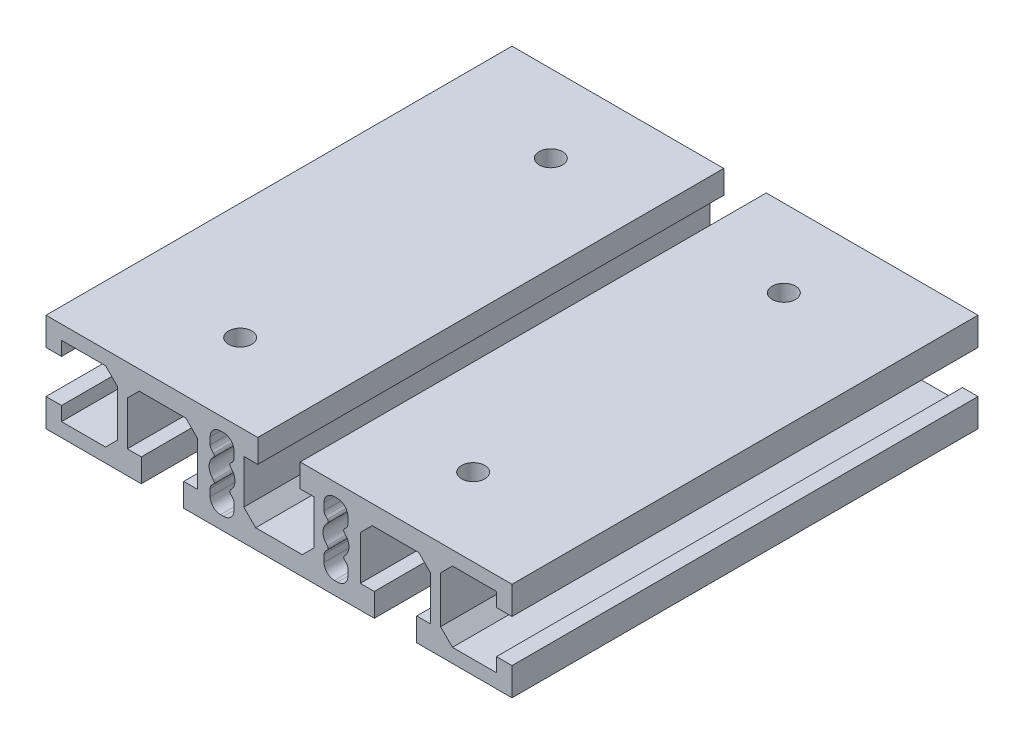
ISO-10303-21;
HEADER;
FILE_DESCRIPTION(('STEP AP214'),'2;1');
FILE_NAME('part.step','',(''),(''),'','','');
FILE_SCHEMA(('AUTOMOTIVE_DESIGN { 1 0 10303 214 1 1 1 1 }'));
ENDSEC;
DATA;
#1=APPLICATION_CONTEXT('core data for automotive mechanical design processes');
#2=APPLICATION_PROTOCOL_DEFINITION('international standard','automotive_design',2000,#1);
#3=PRODUCT_CONTEXT('',#1,'mechanical');
#4=PRODUCT('Part','Part','',(#3));
#5=PRODUCT_RELATED_PRODUCT_CATEGORY('part','',(#4));
#6=PRODUCT_DEFINITION_FORMATION('','',#4);
#7=PRODUCT_DEFINITION_CONTEXT('part definition',#1,'design');
#8=PRODUCT_DEFINITION('design','',#6,#7);
#9=PRODUCT_DEFINITION_SHAPE('','',#8);
#10=(LENGTH_UNIT() NAMED_UNIT(*) SI_UNIT(.MILLI.,.METRE.));
#11=(NAMED_UNIT(*) PLANE_ANGLE_UNIT() SI_UNIT($,.RADIAN.));
#12=(NAMED_UNIT(*) SI_UNIT($,.STERADIAN.) SOLID_ANGLE_UNIT());
#13=UNCERTAINTY_MEASURE_WITH_UNIT(LENGTH_MEASURE(1.E-05),#10,'distance_accuracy_value','');
#14=(GEOMETRIC_REPRESENTATION_CONTEXT(3) GLOBAL_UNCERTAINTY_ASSIGNED_CONTEXT((#13)) GLOBAL_UNIT_ASSIGNED_CONTEXT((#10,
#11,#12)) REPRESENTATION_CONTEXT('',''));
#15=CARTESIAN_POINT('',(0.,0.,0.));
#16=DIRECTION('',(0.,0.,1.));
#17=DIRECTION('',(1.,0.,0.));
#18=AXIS2_PLACEMENT_3D('',#15,#16,#17);
#19=CARTESIAN_POINT('',(0.,0.,-45.));
#20=DIRECTION('',(0.,0.,-1.));
#21=DIRECTION('',(-1.,0.,0.));
#22=AXIS2_PLACEMENT_3D('',#19,#20,#21);
#23=PLANE('',#22);
#24=CARTESIAN_POINT('',(9.69997079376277,-3.65737373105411,-45.));
#25=DIRECTION('',(0.,0.,1.));
#26=DIRECTION('',(1.,0.,0.));
#27=AXIS2_PLACEMENT_3D('',#24,#25,#26);
#28=CIRCLE('',#27,1.00000000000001);
#29=CARTESIAN_POINT('',(8.99286401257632,-2.95026694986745,-45.));
#30=VERTEX_POINT('',#29);
#31=CARTESIAN_POINT('',(8.69997079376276,-3.65737373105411,-45.));
#32=VERTEX_POINT('',#31);
#33=EDGE_CURVE('E2030',#30,#32,#28,.T.);
#34=ORIENTED_EDGE('',*,*,#33,.T.);
#35=DIRECTION('',(0.,1.,0.));
#36=VECTOR('',#35,1.);
#37=CARTESIAN_POINT('',(8.69997079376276,-4.99997510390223,-45.));
#38=LINE('',#37,#36);
#39=CARTESIAN_POINT('',(8.69997079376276,-4.99997510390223,-45.));
#40=VERTEX_POINT('',#39);
#41=EDGE_CURVE('E1612',#40,#32,#38,.T.);
#42=ORIENTED_EDGE('',*,*,#41,.F.);
#43=CARTESIAN_POINT('',(10.6999707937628,-4.99997510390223,-45.));
#44=DIRECTION('',(0.,0.,1.));
#45=DIRECTION('',(1.,0.,0.));
#46=AXIS2_PLACEMENT_3D('',#43,#44,#45);
#47=CIRCLE('',#46,2.);
#48=CARTESIAN_POINT('',(10.6999707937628,-6.99997510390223,-45.));
#49=VERTEX_POINT('',#48);
#50=EDGE_CURVE('E2083',#40,#49,#47,.T.);
#51=ORIENTED_EDGE('',*,*,#50,.T.);
#52=DIRECTION('',(-1.,0.,0.));
#53=VECTOR('',#52,1.);
#54=CARTESIAN_POINT('',(11.2999707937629,-6.99997510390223,-45.));
#55=LINE('',#54,#53);
#56=CARTESIAN_POINT('',(11.2999707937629,-6.99997510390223,-45.));
#57=VERTEX_POINT('',#56);
#58=EDGE_CURVE('E2081',#57,#49,#55,.T.);
#59=ORIENTED_EDGE('',*,*,#58,.F.);
#60=CARTESIAN_POINT('',(11.2999707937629,-4.99997510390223,-45.));
#61=DIRECTION('',(0.,0.,1.));
#62=DIRECTION('',(1.,0.,0.));
#63=AXIS2_PLACEMENT_3D('',#60,#61,#62);
#64=CIRCLE('',#63,2.);
#65=CARTESIAN_POINT('',(13.2999707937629,-4.99997510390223,-45.));
#66=VERTEX_POINT('',#65);
#67=EDGE_CURVE('E2078',#57,#66,#64,.T.);
#68=ORIENTED_EDGE('',*,*,#67,.T.);
#69=DIRECTION('',(0.,-1.,0.));
#70=VECTOR('',#69,1.);
#71=CARTESIAN_POINT('',(13.2999707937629,-3.65737373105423,-45.));
#72=LINE('',#71,#70);
#73=CARTESIAN_POINT('',(13.2999707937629,-3.65737373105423,-45.));
#74=VERTEX_POINT('',#73);
#75=EDGE_CURVE('E2076',#74,#66,#72,.T.);
#76=ORIENTED_EDGE('',*,*,#75,.F.);
#77=CARTESIAN_POINT('',(12.2999707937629,-3.65737373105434,-45.));
#78=DIRECTION('',(0.,0.,1.));
#79=DIRECTION('',(1.,0.,0.));
#80=AXIS2_PLACEMENT_3D('',#77,#78,#79);
#81=CIRCLE('',#80,0.999999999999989);
#82=CARTESIAN_POINT('',(13.0070775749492,-2.95026694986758,-45.));
#83=VERTEX_POINT('',#82);
#84=EDGE_CURVE('E2073',#74,#83,#81,.T.);
#85=ORIENTED_EDGE('',*,*,#84,.T.);
#86=DIRECTION('',(0.707106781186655,-0.70710678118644,0.));
#87=VECTOR('',#86,1.);
#88=CARTESIAN_POINT('',(12.6464174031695,-2.58960677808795,-45.));
#89=LINE('',#88,#87);
#90=CARTESIAN_POINT('',(12.6464174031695,-2.58960677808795,-45.));
#91=VERTEX_POINT('',#90);
#92=EDGE_CURVE('E2071',#91,#83,#89,.T.);
#93=ORIENTED_EDGE('',*,*,#92,.F.);
#94=CARTESIAN_POINT('',(12.9999707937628,-2.23605338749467,-45.));
#95=DIRECTION('',(0.,0.,1.));
#96=DIRECTION('',(1.,0.,0.));
#97=AXIS2_PLACEMENT_3D('',#94,#95,#96);
#98=CIRCLE('',#97,0.499999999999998);
#99=CARTESIAN_POINT('',(12.6666374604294,-1.86337539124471,-45.));
#100=VERTEX_POINT('',#99);
#101=EDGE_CURVE('E2069',#100,#91,#98,.T.);
#102=ORIENTED_EDGE('',*,*,#101,.F.);
#103=CARTESIAN_POINT('',(10.9999707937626,1.45900051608E-05,-45.));
#104=DIRECTION('',(0.,0.,1.));
#105=DIRECTION('',(1.,0.,0.));
#106=AXIS2_PLACEMENT_3D('',#103,#104,#105);
#107=CIRCLE('',#106,2.50000000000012);
#108=CARTESIAN_POINT('',(12.6666374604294,1.86340457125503,-45.));
#109=VERTEX_POINT('',#108);
#110=EDGE_CURVE('E2066',#100,#109,#107,.T.);
#111=ORIENTED_EDGE('',*,*,#110,.T.);
#112=CARTESIAN_POINT('',(12.9999707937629,2.23608256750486,-45.));
#113=DIRECTION('',(0.,0.,1.));
#114=DIRECTION('',(1.,0.,0.));
#115=AXIS2_PLACEMENT_3D('',#112,#113,#114);
#116=CIRCLE('',#115,0.499999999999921);
#117=CARTESIAN_POINT('',(12.6464174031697,2.58963595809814,-45.));
#118=VERTEX_POINT('',#117);
#119=EDGE_CURVE('E2064',#118,#109,#116,.T.);
#120=ORIENTED_EDGE('',*,*,#119,.F.);
#121=DIRECTION('',(-0.707106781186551,-0.707106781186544,0.));
#122=VECTOR('',#121,1.);
#123=CARTESIAN_POINT('',(13.0070775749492,2.95029612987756,-45.));
#124=LINE('',#123,#122);
#125=CARTESIAN_POINT('',(13.0070775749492,2.95029612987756,-45.));
#126=VERTEX_POINT('',#125);
#127=EDGE_CURVE('E2062',#126,#118,#124,.T.);
#128=ORIENTED_EDGE('',*,*,#127,.F.);
#129=CARTESIAN_POINT('',(12.2999707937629,3.65740291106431,-45.));
#130=DIRECTION('',(0.,0.,1.));
#131=DIRECTION('',(1.,0.,0.));
#132=AXIS2_PLACEMENT_3D('',#129,#130,#131);
#133=CIRCLE('',#132,0.99999999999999);
#134=CARTESIAN_POINT('',(13.2999707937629,3.65740291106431,-45.));
#135=VERTEX_POINT('',#134);
#136=EDGE_CURVE('E2059',#126,#135,#133,.T.);
#137=ORIENTED_EDGE('',*,*,#136,.T.);
#138=DIRECTION('',(0.,-1.,0.));
#139=VECTOR('',#138,1.);
#140=CARTESIAN_POINT('',(13.2999707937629,5.0000042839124,-45.));
#141=LINE('',#140,#139);
#142=CARTESIAN_POINT('',(13.2999707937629,5.0000042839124,-45.));
#143=VERTEX_POINT('',#142);
#144=EDGE_CURVE('E2057',#143,#135,#141,.T.);
#145=ORIENTED_EDGE('',*,*,#144,.F.);
#146=CARTESIAN_POINT('',(11.2999707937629,5.0000042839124,-45.));
#147=DIRECTION('',(0.,0.,1.));
#148=DIRECTION('',(1.,0.,0.));
#149=AXIS2_PLACEMENT_3D('',#146,#147,#148);
#150=CIRCLE('',#149,2.);
#151=CARTESIAN_POINT('',(11.2999707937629,7.0000042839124,-45.));
#152=VERTEX_POINT('',#151);
#153=EDGE_CURVE('E2054',#143,#152,#150,.T.);
#154=ORIENTED_EDGE('',*,*,#153,.T.);
#155=DIRECTION('',(1.,0.,0.));
#156=VECTOR('',#155,1.);
#157=CARTESIAN_POINT('',(10.6999707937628,7.0000042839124,-45.));
#158=LINE('',#157,#156);
#159=CARTESIAN_POINT('',(10.6999707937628,7.0000042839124,-45.));
#160=VERTEX_POINT('',#159);
#161=EDGE_CURVE('E2052',#160,#152,#158,.T.);
#162=ORIENTED_EDGE('',*,*,#161,.F.);
#163=CARTESIAN_POINT('',(10.6999707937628,5.0000042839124,-45.));
#164=DIRECTION('',(0.,0.,1.));
#165=DIRECTION('',(1.,0.,0.));
#166=AXIS2_PLACEMENT_3D('',#163,#164,#165);
#167=CIRCLE('',#166,2.);
#168=CARTESIAN_POINT('',(8.69997079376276,5.0000042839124,-45.));
#169=VERTEX_POINT('',#168);
#170=EDGE_CURVE('E2049',#160,#169,#167,.T.);
#171=ORIENTED_EDGE('',*,*,#170,.T.);
#172=DIRECTION('',(0.,1.,0.));
#173=VECTOR('',#172,1.);
#174=CARTESIAN_POINT('',(8.69997079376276,3.65740291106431,-45.));
#175=LINE('',#174,#173);
#176=CARTESIAN_POINT('',(8.69997079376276,3.65740291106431,-45.));
#177=VERTEX_POINT('',#176);
#178=EDGE_CURVE('E2047',#177,#169,#175,.T.);
#179=ORIENTED_EDGE('',*,*,#178,.F.);
#180=CARTESIAN_POINT('',(9.69997079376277,3.65740291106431,-45.));
#181=DIRECTION('',(0.,0.,1.));
#182=DIRECTION('',(1.,0.,0.));
#183=AXIS2_PLACEMENT_3D('',#180,#181,#182);
#184=CIRCLE('',#183,1.00000000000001);
#185=CARTESIAN_POINT('',(8.99286401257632,2.95029612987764,-45.));
#186=VERTEX_POINT('',#185);
#187=EDGE_CURVE('E2044',#177,#186,#184,.T.);
#188=ORIENTED_EDGE('',*,*,#187,.T.);
#189=DIRECTION('',(-0.707106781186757,0.707106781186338,0.));
#190=VECTOR('',#189,1.);
#191=CARTESIAN_POINT('',(9.35352418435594,2.58963595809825,-45.));
#192=LINE('',#191,#190);
#193=CARTESIAN_POINT('',(9.35352418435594,2.58963595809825,-45.));
#194=VERTEX_POINT('',#193);
#195=EDGE_CURVE('E2042',#194,#186,#192,.T.);
#196=ORIENTED_EDGE('',*,*,#195,.F.);
#197=CARTESIAN_POINT('',(8.99997079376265,2.23608256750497,-45.));
#198=DIRECTION('',(0.,0.,1.));
#199=DIRECTION('',(1.,0.,0.));
#200=AXIS2_PLACEMENT_3D('',#197,#198,#199);
#201=CIRCLE('',#200,0.500000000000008);
#202=CARTESIAN_POINT('',(9.33330412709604,1.86340457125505,-45.));
#203=VERTEX_POINT('',#202);
#204=EDGE_CURVE('E2040',#203,#194,#201,.T.);
#205=ORIENTED_EDGE('',*,*,#204,.F.);
#206=CARTESIAN_POINT('',(10.9999707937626,1.45900051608E-05,-45.));
#207=DIRECTION('',(0.,0.,1.));
#208=DIRECTION('',(1.,0.,0.));
#209=AXIS2_PLACEMENT_3D('',#206,#207,#208);
#210=CIRCLE('',#209,2.5);
#211=CARTESIAN_POINT('',(9.33330412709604,-1.86337539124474,-45.));
#212=VERTEX_POINT('',#211);
#213=EDGE_CURVE('E2037',#203,#212,#210,.T.);
#214=ORIENTED_EDGE('',*,*,#213,.T.);
#215=CARTESIAN_POINT('',(8.99997079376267,-2.23605338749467,-45.));
#216=DIRECTION('',(0.,0.,1.));
#217=DIRECTION('',(1.,0.,0.));
#218=AXIS2_PLACEMENT_3D('',#215,#216,#217);
#219=CIRCLE('',#218,0.500000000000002);
#220=CARTESIAN_POINT('',(9.35352418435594,-2.58960677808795,-45.));
#221=VERTEX_POINT('',#220);
#222=EDGE_CURVE('E2035',#221,#212,#219,.T.);
#223=ORIENTED_EDGE('',*,*,#222,.F.);
#224=DIRECTION('',(0.707106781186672,0.707106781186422,0.));
#225=VECTOR('',#224,1.);
#226=CARTESIAN_POINT('',(8.99286401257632,-2.95026694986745,-45.));
#227=LINE('',#226,#225);
#228=EDGE_CURVE('E2033',#30,#221,#227,.T.);
#229=ORIENTED_EDGE('',*,*,#228,.F.);
#230=EDGE_LOOP('',(#34,#42,#51,#59,#68,#76,#85,#93,#102,#111,#120,#128,#137,#145,#154,#162,#171,
#179,#188,#196,#205,#214,#223,#229));
#231=FACE_BOUND('',#230,.T.);
#232=DIRECTION('',(0.,1.,0.));
#233=VECTOR('',#232,1.);
#234=CARTESIAN_POINT('',(-29.2999999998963,-5.00000000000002,-45.));
#235=LINE('',#234,#233);
#236=CARTESIAN_POINT('',(-29.2999999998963,-5.00000000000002,-45.));
#237=VERTEX_POINT('',#236);
#238=CARTESIAN_POINT('',(-29.2999999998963,3.50000000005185,-45.));
#239=VERTEX_POINT('',#238);
#240=EDGE_CURVE('E2133',#237,#239,#235,.T.);
#241=ORIENTED_EDGE('',*,*,#240,.F.);
#242=DIRECTION('',(-1.,0.,0.));
#243=VECTOR('',#242,1.);
#244=CARTESIAN_POINT('',(-26.6,-5.00000000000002,-45.));
#245=LINE('',#244,#243);
#246=CARTESIAN_POINT('',(-26.6,-5.00000000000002,-45.));
#247=VERTEX_POINT('',#246);
#248=EDGE_CURVE('E2292',#247,#237,#245,.T.);
#249=ORIENTED_EDGE('',*,*,#248,.F.);
#250=DIRECTION('',(0.,1.,0.));
#251=VECTOR('',#250,1.);
#252=CARTESIAN_POINT('',(-26.6,-9.50000000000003,-45.));
#253=LINE('',#252,#251);
#254=CARTESIAN_POINT('',(-26.6,-9.50000000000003,-45.));
#255=VERTEX_POINT('',#254);
#256=EDGE_CURVE('E2289',#255,#247,#253,.T.);
#257=ORIENTED_EDGE('',*,*,#256,.F.);
#258=DIRECTION('',(1.,0.,0.));
#259=VECTOR('',#258,1.);
#260=CARTESIAN_POINT('',(-45.,-9.50000000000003,-45.));
#261=LINE('',#260,#259);
#262=CARTESIAN_POINT('',(-45.,-9.50000000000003,-45.));
#263=VERTEX_POINT('',#262);
#264=EDGE_CURVE('E2286',#263,#255,#261,.T.);
#265=ORIENTED_EDGE('',*,*,#264,.F.);
#266=DIRECTION('',(0.,-1.,0.));
#267=VECTOR('',#266,1.);
#268=CARTESIAN_POINT('',(-45.,-4.10000000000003,-45.));
#269=LINE('',#268,#267);
#270=CARTESIAN_POINT('',(-45.,-4.10000000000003,-45.));
#271=VERTEX_POINT('',#270);
#272=EDGE_CURVE('E2283',#271,#263,#269,.T.);
#273=ORIENTED_EDGE('',*,*,#272,.F.);
#274=DIRECTION('',(-1.,0.,0.));
#275=VECTOR('',#274,1.);
#276=CARTESIAN_POINT('',(-42.,-4.10000000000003,-45.));
#277=LINE('',#276,#275);
#278=CARTESIAN_POINT('',(-42.,-4.10000000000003,-45.));
#279=VERTEX_POINT('',#278);
#280=EDGE_CURVE('E2280',#279,#271,#277,.T.);
#281=ORIENTED_EDGE('',*,*,#280,.F.);
#282=DIRECTION('',(0.,1.,0.));
#283=VECTOR('',#282,1.);
#284=CARTESIAN_POINT('',(-42.,-6.8,-45.));
#285=LINE('',#284,#283);
#286=CARTESIAN_POINT('',(-42.,-6.8,-45.));
#287=VERTEX_POINT('',#286);
#288=EDGE_CURVE('E2277',#287,#279,#285,.T.);
#289=ORIENTED_EDGE('',*,*,#288,.F.);
#290=DIRECTION('',(-1.,0.,0.));
#291=VECTOR('',#290,1.);
#292=CARTESIAN_POINT('',(-33.5,-6.8,-45.));
#293=LINE('',#292,#291);
#294=CARTESIAN_POINT('',(-33.5,-6.8,-45.));
#295=VERTEX_POINT('',#294);
#296=EDGE_CURVE('E2274',#295,#287,#293,.T.);
#297=ORIENTED_EDGE('',*,*,#296,.F.);
#298=DIRECTION('',(-0.707106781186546,-0.707106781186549,0.));
#299=VECTOR('',#298,1.);
#300=CARTESIAN_POINT('',(-31.2,-4.50000000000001,-45.));
#301=LINE('',#300,#299);
#302=CARTESIAN_POINT('',(-31.2,-4.50000000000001,-45.));
#303=VERTEX_POINT('',#302);
#304=EDGE_CURVE('E2271',#303,#295,#301,.T.);
#305=ORIENTED_EDGE('',*,*,#304,.F.);
#306=DIRECTION('',(0.,-1.,0.));
#307=VECTOR('',#306,1.);
#308=CARTESIAN_POINT('',(-31.2,4.50000000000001,-45.));
#309=LINE('',#308,#307);
#310=CARTESIAN_POINT('',(-31.2,4.50000000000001,-45.));
#311=VERTEX_POINT('',#310);
#312=EDGE_CURVE('E2268',#311,#303,#309,.T.);
#313=ORIENTED_EDGE('',*,*,#312,.F.);
#314=DIRECTION('',(0.707106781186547,-0.707106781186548,0.));
#315=VECTOR('',#314,1.);
#316=CARTESIAN_POINT('',(-33.4999999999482,6.79999999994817,-45.));
#317=LINE('',#316,#315);
#318=CARTESIAN_POINT('',(-33.4999999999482,6.79999999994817,-45.));
#319=VERTEX_POINT('',#318);
#320=EDGE_CURVE('E2265',#319,#311,#317,.T.);
#321=ORIENTED_EDGE('',*,*,#320,.F.);
#322=DIRECTION('',(1.,0.,0.));
#323=VECTOR('',#322,1.);
#324=CARTESIAN_POINT('',(-42.,6.79999999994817,-45.));
#325=LINE('',#324,#323);
#326=CARTESIAN_POINT('',(-42.,6.79999999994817,-45.));
#327=VERTEX_POINT('',#326);
#328=EDGE_CURVE('E2262',#327,#319,#325,.T.);
#329=ORIENTED_EDGE('',*,*,#328,.F.);
#330=DIRECTION('',(0.,1.,0.));
#331=VECTOR('',#330,1.);
#332=CARTESIAN_POINT('',(-42.,4.10000000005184,-45.));
#333=LINE('',#332,#331);
#334=CARTESIAN_POINT('',(-42.,4.10000000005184,-45.));
#335=VERTEX_POINT('',#334);
#336=EDGE_CURVE('E2259',#335,#327,#333,.T.);
#337=ORIENTED_EDGE('',*,*,#336,.F.);
#338=DIRECTION('',(1.,0.,0.));
#339=VECTOR('',#338,1.);
#340=CARTESIAN_POINT('',(-45.,4.10000000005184,-45.));
#341=LINE('',#340,#339);
#342=CARTESIAN_POINT('',(-45.,4.10000000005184,-45.));
#343=VERTEX_POINT('',#342);
#344=EDGE_CURVE('E2256',#343,#335,#341,.T.);
#345=ORIENTED_EDGE('',*,*,#344,.F.);
#346=DIRECTION('',(0.,-1.,0.));
#347=VECTOR('',#346,1.);
#348=CARTESIAN_POINT('',(-45.,9.50000000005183,-45.));
#349=LINE('',#348,#347);
#350=CARTESIAN_POINT('',(-45.,9.50000000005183,-45.));
#351=VERTEX_POINT('',#350);
#352=EDGE_CURVE('E2253',#351,#343,#349,.T.);
#353=ORIENTED_EDGE('',*,*,#352,.F.);
#354=DIRECTION('',(-1.,0.,0.));
#355=VECTOR('',#354,1.);
#356=CARTESIAN_POINT('',(-4.09999999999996,9.50000000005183,-45.));
#357=LINE('',#356,#355);
#358=CARTESIAN_POINT('',(-4.09999999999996,9.50000000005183,-45.));
#359=VERTEX_POINT('',#358);
#360=EDGE_CURVE('E2250',#359,#351,#357,.T.);
#361=ORIENTED_EDGE('',*,*,#360,.F.);
#362=DIRECTION('',(0.,1.,0.));
#363=VECTOR('',#362,1.);
#364=CARTESIAN_POINT('',(-4.09999999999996,5.00000000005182,-45.));
#365=LINE('',#364,#363);
#366=CARTESIAN_POINT('',(-4.09999999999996,5.00000000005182,-45.));
#367=VERTEX_POINT('',#366);
#368=EDGE_CURVE('E2247',#367,#359,#365,.T.);
#369=ORIENTED_EDGE('',*,*,#368,.F.);
#370=DIRECTION('',(1.,0.,0.));
#371=VECTOR('',#370,1.);
#372=CARTESIAN_POINT('',(-6.80000000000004,5.00000000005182,-45.));
#373=LINE('',#372,#371);
#374=CARTESIAN_POINT('',(-6.80000000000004,5.00000000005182,-45.));
#375=VERTEX_POINT('',#374);
#376=EDGE_CURVE('E2244',#375,#367,#373,.T.);
#377=ORIENTED_EDGE('',*,*,#376,.F.);
#378=DIRECTION('',(0.,1.,0.));
#379=VECTOR('',#378,1.);
#380=CARTESIAN_POINT('',(-6.80000000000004,-3.49999999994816,-45.));
#381=LINE('',#380,#379);
#382=CARTESIAN_POINT('',(-6.80000000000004,-3.49999999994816,-45.));
#383=VERTEX_POINT('',#382);
#384=EDGE_CURVE('E2241',#383,#375,#381,.T.);
#385=ORIENTED_EDGE('',*,*,#384,.F.);
#386=DIRECTION('',(-0.707106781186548,0.707106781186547,0.));
#387=VECTOR('',#386,1.);
#388=CARTESIAN_POINT('',(-4.50000000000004,-5.79999999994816,-45.));
#389=LINE('',#388,#387);
#390=CARTESIAN_POINT('',(-4.50000000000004,-5.79999999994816,-45.));
#391=VERTEX_POINT('',#390);
#392=EDGE_CURVE('E2238',#391,#383,#389,.T.);
#393=ORIENTED_EDGE('',*,*,#392,.F.);
#394=DIRECTION('',(-1.,0.,0.));
#395=VECTOR('',#394,1.);
#396=CARTESIAN_POINT('',(4.49999999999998,-5.79999999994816,-45.));
#397=LINE('',#396,#395);
#398=CARTESIAN_POINT('',(4.49999999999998,-5.79999999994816,-45.));
#399=VERTEX_POINT('',#398);
#400=EDGE_CURVE('E2235',#399,#391,#397,.T.);
#401=ORIENTED_EDGE('',*,*,#400,.F.);
#402=DIRECTION('',(-0.707106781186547,-0.707106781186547,0.));
#403=VECTOR('',#402,1.);
#404=CARTESIAN_POINT('',(6.79999999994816,-3.49999999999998,-45.));
#405=LINE('',#404,#403);
#406=CARTESIAN_POINT('',(6.79999999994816,-3.49999999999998,-45.));
#407=VERTEX_POINT('',#406);
#408=EDGE_CURVE('E2232',#407,#399,#405,.T.);
#409=ORIENTED_EDGE('',*,*,#408,.F.);
#410=DIRECTION('',(0.,-1.,0.));
#411=VECTOR('',#410,1.);
#412=CARTESIAN_POINT('',(6.79999999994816,5.00000000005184,-45.));
#413=LINE('',#412,#411);
#414=CARTESIAN_POINT('',(6.79999999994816,5.00000000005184,-45.));
#415=VERTEX_POINT('',#414);
#416=EDGE_CURVE('E2229',#415,#407,#413,.T.);
#417=ORIENTED_EDGE('',*,*,#416,.F.);
#418=DIRECTION('',(1.,0.,0.));
#419=VECTOR('',#418,1.);
#420=CARTESIAN_POINT('',(4.10000000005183,5.00000000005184,-45.));
#421=LINE('',#420,#419);
#422=CARTESIAN_POINT('',(4.10000000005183,5.00000000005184,-45.));
#423=VERTEX_POINT('',#422);
#424=EDGE_CURVE('E2226',#423,#415,#421,.T.);
#425=ORIENTED_EDGE('',*,*,#424,.F.);
#426=DIRECTION('',(0.,-1.,0.));
#427=VECTOR('',#426,1.);
#428=CARTESIAN_POINT('',(4.10000000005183,9.50000000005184,-45.));
#429=LINE('',#428,#427);
#430=CARTESIAN_POINT('',(4.10000000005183,9.50000000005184,-45.));
#431=VERTEX_POINT('',#430);
#432=EDGE_CURVE('E2223',#431,#423,#429,.T.);
#433=ORIENTED_EDGE('',*,*,#432,.F.);
#434=DIRECTION('',(-1.,0.,0.));
#435=VECTOR('',#434,1.);
#436=CARTESIAN_POINT('',(45.0000000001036,9.50000000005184,-45.));
#437=LINE('',#436,#435);
#438=CARTESIAN_POINT('',(45.0000000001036,9.50000000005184,-45.));
#439=VERTEX_POINT('',#438);
#440=EDGE_CURVE('E2220',#439,#431,#437,.T.);
#441=ORIENTED_EDGE('',*,*,#440,.F.);
#442=DIRECTION('',(0.,1.,0.));
#443=VECTOR('',#442,1.);
#444=CARTESIAN_POINT('',(45.0000000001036,4.10000000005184,-45.));
#445=LINE('',#444,#443);
#446=CARTESIAN_POINT('',(45.0000000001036,4.10000000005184,-45.));
#447=VERTEX_POINT('',#446);
#448=EDGE_CURVE('E2217',#447,#439,#445,.T.);
#449=ORIENTED_EDGE('',*,*,#448,.F.);
#450=DIRECTION('',(1.,0.,0.));
#451=VECTOR('',#450,1.);
#452=CARTESIAN_POINT('',(42.0000000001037,4.10000000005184,-45.));
#453=LINE('',#452,#451);
#454=CARTESIAN_POINT('',(42.0000000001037,4.10000000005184,-45.));
#455=VERTEX_POINT('',#454);
#456=EDGE_CURVE('E2214',#455,#447,#453,.T.);
#457=ORIENTED_EDGE('',*,*,#456,.F.);
#458=DIRECTION('',(0.,-1.,0.));
#459=VECTOR('',#458,1.);
#460=CARTESIAN_POINT('',(42.0000000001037,6.80000000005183,-45.));
#461=LINE('',#460,#459);
#462=CARTESIAN_POINT('',(42.0000000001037,6.80000000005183,-45.));
#463=VERTEX_POINT('',#462);
#464=EDGE_CURVE('E2211',#463,#455,#461,.T.);
#465=ORIENTED_EDGE('',*,*,#464,.F.);
#466=DIRECTION('',(1.,0.,0.));
#467=VECTOR('',#466,1.);
#468=CARTESIAN_POINT('',(33.5000000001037,6.80000000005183,-45.));
#469=LINE('',#468,#467);
#470=CARTESIAN_POINT('',(33.5000000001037,6.80000000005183,-45.));
#471=VERTEX_POINT('',#470);
#472=EDGE_CURVE('E2208',#471,#463,#469,.T.);
#473=ORIENTED_EDGE('',*,*,#472,.F.);
#474=DIRECTION('',(0.707106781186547,0.707106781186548,0.));
#475=VECTOR('',#474,1.);
#476=CARTESIAN_POINT('',(31.2000000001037,4.50000000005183,-45.));
#477=LINE('',#476,#475);
#478=CARTESIAN_POINT('',(31.2000000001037,4.50000000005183,-45.));
#479=VERTEX_POINT('',#478);
#480=EDGE_CURVE('E2205',#479,#471,#477,.T.);
#481=ORIENTED_EDGE('',*,*,#480,.F.);
#482=DIRECTION('',(0.,1.,0.));
#483=VECTOR('',#482,1.);
#484=CARTESIAN_POINT('',(31.2000000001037,-4.49999999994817,-45.));
#485=LINE('',#484,#483);
#486=CARTESIAN_POINT('',(31.2000000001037,-4.49999999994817,-45.));
#487=VERTEX_POINT('',#486);
#488=EDGE_CURVE('E2202',#487,#479,#485,.T.);
#489=ORIENTED_EDGE('',*,*,#488,.F.);
#490=DIRECTION('',(-0.707106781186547,0.707106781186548,0.));
#491=VECTOR('',#490,1.);
#492=CARTESIAN_POINT('',(33.5000000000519,-6.79999999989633,-45.));
#493=LINE('',#492,#491);
#494=CARTESIAN_POINT('',(33.5000000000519,-6.79999999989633,-45.));
#495=VERTEX_POINT('',#494);
#496=EDGE_CURVE('E2199',#495,#487,#493,.T.);
#497=ORIENTED_EDGE('',*,*,#496,.F.);
#498=DIRECTION('',(-1.,0.,0.));
#499=VECTOR('',#498,1.);
#500=CARTESIAN_POINT('',(42.0000000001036,-6.79999999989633,-45.));
#501=LINE('',#500,#499);
#502=CARTESIAN_POINT('',(42.0000000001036,-6.79999999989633,-45.));
#503=VERTEX_POINT('',#502);
#504=EDGE_CURVE('E2196',#503,#495,#501,.T.);
#505=ORIENTED_EDGE('',*,*,#504,.F.);
#506=DIRECTION('',(0.,-1.,0.));
#507=VECTOR('',#506,1.);
#508=CARTESIAN_POINT('',(42.0000000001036,-4.1,-45.));
#509=LINE('',#508,#507);
#510=CARTESIAN_POINT('',(42.0000000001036,-4.1,-45.));
#511=VERTEX_POINT('',#510);
#512=EDGE_CURVE('E2193',#511,#503,#509,.T.);
#513=ORIENTED_EDGE('',*,*,#512,.F.);
#514=DIRECTION('',(-1.,0.,0.));
#515=VECTOR('',#514,1.);
#516=CARTESIAN_POINT('',(45.0000000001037,-4.1,-45.));
#517=LINE('',#516,#515);
#518=CARTESIAN_POINT('',(45.0000000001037,-4.1,-45.));
#519=VERTEX_POINT('',#518);
#520=EDGE_CURVE('E2190',#519,#511,#517,.T.);
#521=ORIENTED_EDGE('',*,*,#520,.F.);
#522=DIRECTION('',(0.,1.,0.));
#523=VECTOR('',#522,1.);
#524=CARTESIAN_POINT('',(45.0000000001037,-9.49999999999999,-45.));
#525=LINE('',#524,#523);
#526=CARTESIAN_POINT('',(45.0000000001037,-9.49999999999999,-45.));
#527=VERTEX_POINT('',#526);
#528=EDGE_CURVE('E2187',#527,#519,#525,.T.);
#529=ORIENTED_EDGE('',*,*,#528,.F.);
#530=DIRECTION('',(1.,0.,0.));
#531=VECTOR('',#530,1.);
#532=CARTESIAN_POINT('',(26.6000000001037,-9.49999999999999,-45.));
#533=LINE('',#532,#531);
#534=CARTESIAN_POINT('',(26.6000000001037,-9.49999999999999,-45.));
#535=VERTEX_POINT('',#534);
#536=EDGE_CURVE('E2184',#535,#527,#533,.T.);
#537=ORIENTED_EDGE('',*,*,#536,.F.);
#538=DIRECTION('',(0.,-1.,0.));
#539=VECTOR('',#538,1.);
#540=CARTESIAN_POINT('',(26.6000000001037,-4.99999999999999,-45.));
#541=LINE('',#540,#539);
#542=CARTESIAN_POINT('',(26.6000000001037,-4.99999999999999,-45.));
#543=VERTEX_POINT('',#542);
#544=EDGE_CURVE('E2181',#543,#535,#541,.T.);
#545=ORIENTED_EDGE('',*,*,#544,.F.);
#546=DIRECTION('',(-1.,0.,0.));
#547=VECTOR('',#546,1.);
#548=CARTESIAN_POINT('',(29.3000000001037,-4.99999999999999,-45.));
#549=LINE('',#548,#547);
#550=CARTESIAN_POINT('',(29.3000000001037,-4.99999999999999,-45.));
#551=VERTEX_POINT('',#550);
#552=EDGE_CURVE('E2178',#551,#543,#549,.T.);
#553=ORIENTED_EDGE('',*,*,#552,.F.);
#554=DIRECTION('',(0.,-1.,0.));
#555=VECTOR('',#554,1.);
#556=CARTESIAN_POINT('',(29.3000000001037,3.50000000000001,-45.));
#557=LINE('',#556,#555);
#558=CARTESIAN_POINT('',(29.3000000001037,3.50000000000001,-45.));
#559=VERTEX_POINT('',#558);
#560=EDGE_CURVE('E2175',#559,#551,#557,.T.);
#561=ORIENTED_EDGE('',*,*,#560,.F.);
#562=DIRECTION('',(0.707106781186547,-0.707106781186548,0.));
#563=VECTOR('',#562,1.);
#564=CARTESIAN_POINT('',(27.0000000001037,5.79999999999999,-45.));
#565=LINE('',#564,#563);
#566=CARTESIAN_POINT('',(27.0000000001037,5.79999999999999,-45.));
#567=VERTEX_POINT('',#566);
#568=EDGE_CURVE('E2172',#567,#559,#565,.T.);
#569=ORIENTED_EDGE('',*,*,#568,.F.);
#570=DIRECTION('',(1.,0.,0.));
#571=VECTOR('',#570,1.);
#572=CARTESIAN_POINT('',(18.0000000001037,5.79999999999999,-45.));
#573=LINE('',#572,#571);
#574=CARTESIAN_POINT('',(18.0000000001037,5.79999999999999,-45.));
#575=VERTEX_POINT('',#574);
#576=EDGE_CURVE('E2169',#575,#567,#573,.T.);
#577=ORIENTED_EDGE('',*,*,#576,.F.);
#578=DIRECTION('',(0.707106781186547,0.707106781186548,0.));
#579=VECTOR('',#578,1.);
#580=CARTESIAN_POINT('',(15.7000000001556,3.50000000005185,-45.));
#581=LINE('',#580,#579);
#582=CARTESIAN_POINT('',(15.7000000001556,3.50000000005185,-45.));
#583=VERTEX_POINT('',#582);
#584=EDGE_CURVE('E2166',#583,#575,#581,.T.);
#585=ORIENTED_EDGE('',*,*,#584,.F.);
#586=DIRECTION('',(0.,1.,0.));
#587=VECTOR('',#586,1.);
#588=CARTESIAN_POINT('',(15.7000000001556,-5.,-45.));
#589=LINE('',#588,#587);
#590=CARTESIAN_POINT('',(15.7000000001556,-5.,-45.));
#591=VERTEX_POINT('',#590);
#592=EDGE_CURVE('E2163',#591,#583,#589,.T.);
#593=ORIENTED_EDGE('',*,*,#592,.F.);
#594=DIRECTION('',(-1.,0.,0.));
#595=VECTOR('',#594,1.);
#596=CARTESIAN_POINT('',(18.4000000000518,-5.,-45.));
#597=LINE('',#596,#595);
#598=CARTESIAN_POINT('',(18.4000000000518,-5.,-45.));
#599=VERTEX_POINT('',#598);
#600=EDGE_CURVE('E2160',#599,#591,#597,.T.);
#601=ORIENTED_EDGE('',*,*,#600,.F.);
#602=DIRECTION('',(0.,1.,0.));
#603=VECTOR('',#602,1.);
#604=CARTESIAN_POINT('',(18.4000000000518,-9.50000000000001,-45.));
#605=LINE('',#604,#603);
#606=CARTESIAN_POINT('',(18.4000000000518,-9.50000000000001,-45.));
#607=VERTEX_POINT('',#606);
#608=EDGE_CURVE('E2157',#607,#599,#605,.T.);
#609=ORIENTED_EDGE('',*,*,#608,.F.);
#610=DIRECTION('',(1.,0.,0.));
#611=VECTOR('',#610,1.);
#612=CARTESIAN_POINT('',(-18.3999999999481,-9.50000000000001,-45.));
#613=LINE('',#612,#611);
#614=CARTESIAN_POINT('',(-18.3999999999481,-9.50000000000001,-45.));
#615=VERTEX_POINT('',#614);
#616=EDGE_CURVE('E2154',#615,#607,#613,.T.);
#617=ORIENTED_EDGE('',*,*,#616,.F.);
#618=DIRECTION('',(0.,-1.,0.));
#619=VECTOR('',#618,1.);
#620=CARTESIAN_POINT('',(-18.3999999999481,-5.,-45.));
#621=LINE('',#620,#619);
#622=CARTESIAN_POINT('',(-18.3999999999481,-5.,-45.));
#623=VERTEX_POINT('',#622);
#624=EDGE_CURVE('E2151',#623,#615,#621,.T.);
#625=ORIENTED_EDGE('',*,*,#624,.F.);
#626=DIRECTION('',(-1.,0.,0.));
#627=VECTOR('',#626,1.);
#628=CARTESIAN_POINT('',(-15.6999999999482,-5.,-45.));
#629=LINE('',#628,#627);
#630=CARTESIAN_POINT('',(-15.6999999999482,-5.,-45.));
#631=VERTEX_POINT('',#630);
#632=EDGE_CURVE('E2148',#631,#623,#629,.T.);
#633=ORIENTED_EDGE('',*,*,#632,.F.);
#634=DIRECTION('',(0.,-1.,0.));
#635=VECTOR('',#634,1.);
#636=CARTESIAN_POINT('',(-15.6999999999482,3.5,-45.));
#637=LINE('',#636,#635);
#638=CARTESIAN_POINT('',(-15.6999999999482,3.5,-45.));
#639=VERTEX_POINT('',#638);
#640=EDGE_CURVE('E2145',#639,#631,#637,.T.);
#641=ORIENTED_EDGE('',*,*,#640,.F.);
#642=DIRECTION('',(0.707106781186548,-0.707106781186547,0.));
#643=VECTOR('',#642,1.);
#644=CARTESIAN_POINT('',(-17.9999999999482,5.8,-45.));
#645=LINE('',#644,#643);
#646=CARTESIAN_POINT('',(-17.9999999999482,5.8,-45.));
#647=VERTEX_POINT('',#646);
#648=EDGE_CURVE('E2142',#647,#639,#645,.T.);
#649=ORIENTED_EDGE('',*,*,#648,.F.);
#650=DIRECTION('',(1.,0.,0.));
#651=VECTOR('',#650,1.);
#652=CARTESIAN_POINT('',(-26.9999999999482,5.8,-45.));
#653=LINE('',#652,#651);
#654=CARTESIAN_POINT('',(-26.9999999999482,5.8,-45.));
#655=VERTEX_POINT('',#654);
#656=EDGE_CURVE('E2139',#655,#647,#653,.T.);
#657=ORIENTED_EDGE('',*,*,#656,.F.);
#658=DIRECTION('',(0.707106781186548,0.707106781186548,0.));
#659=VECTOR('',#658,1.);
#660=CARTESIAN_POINT('',(-29.2999999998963,3.50000000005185,-45.));
#661=LINE('',#660,#659);
#662=EDGE_CURVE('E2136',#239,#655,#661,.T.);
#663=ORIENTED_EDGE('',*,*,#662,.F.);
#664=EDGE_LOOP('',(#241,#249,#257,#265,#273,#281,#289,#297,#305,#313,#321,#329,#337,#345,#353,
#361,#369,#377,#385,#393,#401,#409,#417,#425,#433,#441,#449,#457,#465,#473,#481,#489,#497,#505,
#513,#521,#529,#537,#545,#553,#561,#569,#577,#585,#593,#601,#609,#617,#625,#633,#641,#649,#657,#663));
#665=FACE_BOUND('',#664,.T.);
#666=CARTESIAN_POINT('',(-11.2999707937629,-4.99997510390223,-45.));
#667=DIRECTION('',(0.,0.,1.));
#668=DIRECTION('',(1.,0.,0.));
#669=AXIS2_PLACEMENT_3D('',#666,#667,#668);
#670=CIRCLE('',#669,2.);
#671=CARTESIAN_POINT('',(-13.2999707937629,-4.99997510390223,-45.));
#672=VERTEX_POINT('',#671);
#673=CARTESIAN_POINT('',(-11.2999707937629,-6.99997510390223,-45.));
#674=VERTEX_POINT('',#673);
#675=EDGE_CURVE('E1930',#672,#674,#670,.T.);
#676=ORIENTED_EDGE('',*,*,#675,.T.);
#677=DIRECTION('',(-1.,0.,0.));
#678=VECTOR('',#677,1.);
#679=CARTESIAN_POINT('',(-10.6999707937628,-6.99997510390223,-45.));
#680=LINE('',#679,#678);
#681=CARTESIAN_POINT('',(-10.6999707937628,-6.99997510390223,-45.));
#682=VERTEX_POINT('',#681);
#683=EDGE_CURVE('E1608',#682,#674,#680,.T.);
#684=ORIENTED_EDGE('',*,*,#683,.F.);
#685=CARTESIAN_POINT('',(-10.6999707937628,-4.99997510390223,-45.));
#686=DIRECTION('',(0.,0.,1.));
#687=DIRECTION('',(1.,0.,0.));
#688=AXIS2_PLACEMENT_3D('',#685,#686,#687);
#689=CIRCLE('',#688,2.);
#690=CARTESIAN_POINT('',(-8.69997079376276,-4.99997510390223,-45.));
#691=VERTEX_POINT('',#690);
#692=EDGE_CURVE('E1982',#682,#691,#689,.T.);
#693=ORIENTED_EDGE('',*,*,#692,.T.);
#694=DIRECTION('',(0.,-1.,0.));
#695=VECTOR('',#694,1.);
#696=CARTESIAN_POINT('',(-8.69997079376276,-3.65737373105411,-45.));
#697=LINE('',#696,#695);
#698=CARTESIAN_POINT('',(-8.69997079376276,-3.65737373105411,-45.));
#699=VERTEX_POINT('',#698);
#700=EDGE_CURVE('E1980',#699,#691,#697,.T.);
#701=ORIENTED_EDGE('',*,*,#700,.F.);
#702=CARTESIAN_POINT('',(-9.69997079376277,-3.65737373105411,-45.));
#703=DIRECTION('',(0.,0.,1.));
#704=DIRECTION('',(1.,0.,0.));
#705=AXIS2_PLACEMENT_3D('',#702,#703,#704);
#706=CIRCLE('',#705,1.00000000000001);
#707=CARTESIAN_POINT('',(-8.99286401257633,-2.95026694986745,-45.));
#708=VERTEX_POINT('',#707);
#709=EDGE_CURVE('E1977',#699,#708,#706,.T.);
#710=ORIENTED_EDGE('',*,*,#709,.T.);
#711=DIRECTION('',(0.707106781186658,-0.707106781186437,0.));
#712=VECTOR('',#711,1.);
#713=CARTESIAN_POINT('',(-9.35352418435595,-2.58960677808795,-45.));
#714=LINE('',#713,#712);
#715=CARTESIAN_POINT('',(-9.35352418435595,-2.58960677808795,-45.));
#716=VERTEX_POINT('',#715);
#717=EDGE_CURVE('E1975',#716,#708,#714,.T.);
#718=ORIENTED_EDGE('',*,*,#717,.F.);
#719=CARTESIAN_POINT('',(-8.99997079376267,-2.23605338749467,-45.));
#720=DIRECTION('',(0.,0.,1.));
#721=DIRECTION('',(1.,0.,0.));
#722=AXIS2_PLACEMENT_3D('',#719,#720,#721);
#723=CIRCLE('',#722,0.500000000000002);
#724=CARTESIAN_POINT('',(-9.33330412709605,-1.86337539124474,-45.));
#725=VERTEX_POINT('',#724);
#726=EDGE_CURVE('E1973',#725,#716,#723,.T.);
#727=ORIENTED_EDGE('',*,*,#726,.F.);
#728=CARTESIAN_POINT('',(-10.9999707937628,1.45900051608E-05,-45.));
#729=DIRECTION('',(0.,0.,1.));
#730=DIRECTION('',(1.,0.,0.));
#731=AXIS2_PLACEMENT_3D('',#728,#729,#730);
#732=CIRCLE('',#731,2.50000000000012);
#733=CARTESIAN_POINT('',(-9.33330412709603,1.86340457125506,-45.));
#734=VERTEX_POINT('',#733);
#735=EDGE_CURVE('E1970',#725,#734,#732,.T.);
#736=ORIENTED_EDGE('',*,*,#735,.T.);
#737=CARTESIAN_POINT('',(-8.99997079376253,2.23608256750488,-45.));
#738=DIRECTION('',(0.,0.,1.));
#739=DIRECTION('',(1.,0.,0.));
#740=AXIS2_PLACEMENT_3D('',#737,#738,#739);
#741=CIRCLE('',#740,0.500000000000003);
#742=CARTESIAN_POINT('',(-9.35352418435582,2.58963595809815,-45.));
#743=VERTEX_POINT('',#742);
#744=EDGE_CURVE('E1968',#743,#734,#741,.T.);
#745=ORIENTED_EDGE('',*,*,#744,.F.);
#746=DIRECTION('',(-0.707106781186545,-0.70710678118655,0.));
#747=VECTOR('',#746,1.);
#748=CARTESIAN_POINT('',(-8.99286401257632,2.95029612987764,-45.));
#749=LINE('',#748,#747);
#750=CARTESIAN_POINT('',(-8.99286401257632,2.95029612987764,-45.));
#751=VERTEX_POINT('',#750);
#752=EDGE_CURVE('E1966',#751,#743,#749,.T.);
#753=ORIENTED_EDGE('',*,*,#752,.F.);
#754=CARTESIAN_POINT('',(-9.69997079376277,3.65740291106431,-45.));
#755=DIRECTION('',(0.,0.,1.));
#756=DIRECTION('',(1.,0.,0.));
#757=AXIS2_PLACEMENT_3D('',#754,#755,#756);
#758=CIRCLE('',#757,1.00000000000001);
#759=CARTESIAN_POINT('',(-8.69997079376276,3.65740291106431,-45.));
#760=VERTEX_POINT('',#759);
#761=EDGE_CURVE('E1963',#751,#760,#758,.T.);
#762=ORIENTED_EDGE('',*,*,#761,.T.);
#763=DIRECTION('',(0.,-1.,0.));
#764=VECTOR('',#763,1.);
#765=CARTESIAN_POINT('',(-8.69997079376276,5.0000042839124,-45.));
#766=LINE('',#765,#764);
#767=CARTESIAN_POINT('',(-8.69997079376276,5.0000042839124,-45.));
#768=VERTEX_POINT('',#767);
#769=EDGE_CURVE('E1961',#768,#760,#766,.T.);
#770=ORIENTED_EDGE('',*,*,#769,.F.);
#771=CARTESIAN_POINT('',(-10.6999707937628,5.0000042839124,-45.));
#772=DIRECTION('',(0.,0.,1.));
#773=DIRECTION('',(1.,0.,0.));
#774=AXIS2_PLACEMENT_3D('',#771,#772,#773);
#775=CIRCLE('',#774,2.);
#776=CARTESIAN_POINT('',(-10.6999707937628,7.0000042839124,-45.));
#777=VERTEX_POINT('',#776);
#778=EDGE_CURVE('E1958',#768,#777,#775,.T.);
#779=ORIENTED_EDGE('',*,*,#778,.T.);
#780=DIRECTION('',(1.,0.,0.));
#781=VECTOR('',#780,1.);
#782=CARTESIAN_POINT('',(-11.2999707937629,7.0000042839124,-45.));
#783=LINE('',#782,#781);
#784=CARTESIAN_POINT('',(-11.2999707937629,7.0000042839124,-45.));
#785=VERTEX_POINT('',#784);
#786=EDGE_CURVE('E1956',#785,#777,#783,.T.);
#787=ORIENTED_EDGE('',*,*,#786,.F.);
#788=CARTESIAN_POINT('',(-11.2999707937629,5.0000042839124,-45.));
#789=DIRECTION('',(0.,0.,1.));
#790=DIRECTION('',(1.,0.,0.));
#791=AXIS2_PLACEMENT_3D('',#788,#789,#790);
#792=CIRCLE('',#791,2.);
#793=CARTESIAN_POINT('',(-13.2999707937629,5.0000042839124,-45.));
#794=VERTEX_POINT('',#793);
#795=EDGE_CURVE('E1953',#785,#794,#792,.T.);
#796=ORIENTED_EDGE('',*,*,#795,.T.);
#797=DIRECTION('',(0.,1.,0.));
#798=VECTOR('',#797,1.);
#799=CARTESIAN_POINT('',(-13.2999707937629,3.65740291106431,-45.));
#800=LINE('',#799,#798);
#801=CARTESIAN_POINT('',(-13.2999707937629,3.65740291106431,-45.));
#802=VERTEX_POINT('',#801);
#803=EDGE_CURVE('E1951',#802,#794,#800,.T.);
#804=ORIENTED_EDGE('',*,*,#803,.F.);
#805=CARTESIAN_POINT('',(-12.2999707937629,3.65740291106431,-45.));
#806=DIRECTION('',(0.,0.,1.));
#807=DIRECTION('',(1.,0.,0.));
#808=AXIS2_PLACEMENT_3D('',#805,#806,#807);
#809=CIRCLE('',#808,0.999999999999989);
#810=CARTESIAN_POINT('',(-13.0070775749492,2.95029612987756,-45.));
#811=VERTEX_POINT('',#810);
#812=EDGE_CURVE('E1948',#802,#811,#809,.T.);
#813=ORIENTED_EDGE('',*,*,#812,.T.);
#814=DIRECTION('',(-0.707106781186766,0.707106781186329,0.));
#815=VECTOR('',#814,1.);
#816=CARTESIAN_POINT('',(-12.6464174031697,2.5896359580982,-45.));
#817=LINE('',#816,#815);
#818=CARTESIAN_POINT('',(-12.6464174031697,2.5896359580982,-45.));
#819=VERTEX_POINT('',#818);
#820=EDGE_CURVE('E1946',#819,#811,#817,.T.);
#821=ORIENTED_EDGE('',*,*,#820,.F.);
#822=CARTESIAN_POINT('',(-12.9999707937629,2.23608256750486,-45.));
#823=DIRECTION('',(0.,0.,1.));
#824=DIRECTION('',(1.,0.,0.));
#825=AXIS2_PLACEMENT_3D('',#822,#823,#824);
#826=CIRCLE('',#825,0.5);
#827=CARTESIAN_POINT('',(-12.6666374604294,1.86340457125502,-45.));
#828=VERTEX_POINT('',#827);
#829=EDGE_CURVE('E1944',#828,#819,#826,.T.);
#830=ORIENTED_EDGE('',*,*,#829,.F.);
#831=CARTESIAN_POINT('',(-10.9999707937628,1.45900051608E-05,-45.));
#832=DIRECTION('',(0.,0.,1.));
#833=DIRECTION('',(1.,0.,0.));
#834=AXIS2_PLACEMENT_3D('',#831,#832,#833);
#835=CIRCLE('',#834,2.5);
#836=CARTESIAN_POINT('',(-12.6666374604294,-1.86337539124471,-45.));
#837=VERTEX_POINT('',#836);
#838=EDGE_CURVE('E1941',#828,#837,#835,.T.);
#839=ORIENTED_EDGE('',*,*,#838,.T.);
#840=CARTESIAN_POINT('',(-12.9999707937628,-2.23605338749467,-45.));
#841=DIRECTION('',(0.,0.,1.));
#842=DIRECTION('',(1.,0.,0.));
#843=AXIS2_PLACEMENT_3D('',#840,#841,#842);
#844=CIRCLE('',#843,0.499999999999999);
#845=CARTESIAN_POINT('',(-12.6464174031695,-2.58960677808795,-45.));
#846=VERTEX_POINT('',#845);
#847=EDGE_CURVE('E1939',#846,#837,#844,.T.);
#848=ORIENTED_EDGE('',*,*,#847,.F.);
#849=DIRECTION('',(0.707106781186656,0.707106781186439,0.));
#850=VECTOR('',#849,1.);
#851=CARTESIAN_POINT('',(-13.0070775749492,-2.95026694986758,-45.));
#852=LINE('',#851,#850);
#853=CARTESIAN_POINT('',(-13.0070775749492,-2.95026694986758,-45.));
#854=VERTEX_POINT('',#853);
#855=EDGE_CURVE('E1937',#854,#846,#852,.T.);
#856=ORIENTED_EDGE('',*,*,#855,.F.);
#857=CARTESIAN_POINT('',(-12.2999707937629,-3.65737373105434,-45.));
#858=DIRECTION('',(0.,0.,1.));
#859=DIRECTION('',(1.,0.,0.));
#860=AXIS2_PLACEMENT_3D('',#857,#858,#859);
#861=CIRCLE('',#860,0.99999999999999);
#862=CARTESIAN_POINT('',(-13.2999707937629,-3.65737373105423,-45.));
#863=VERTEX_POINT('',#862);
#864=EDGE_CURVE('E1934',#854,#863,#861,.T.);
#865=ORIENTED_EDGE('',*,*,#864,.T.);
#866=DIRECTION('',(0.,1.,0.));
#867=VECTOR('',#866,1.);
#868=CARTESIAN_POINT('',(-13.2999707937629,-4.99997510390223,-45.));
#869=LINE('',#868,#867);
#870=EDGE_CURVE('E1932',#672,#863,#869,.T.);
#871=ORIENTED_EDGE('',*,*,#870,.F.);
#872=EDGE_LOOP('',(#676,#684,#693,#701,#710,#718,#727,#736,#745,#753,#762,#770,#779,#787,#796,
#804,#813,#821,#830,#839,#848,#856,#865,#871));
#873=FACE_BOUND('',#872,.T.);
#874=ADVANCED_FACE('F969',(#231,#665,#873),#23,.T.);
#875=CARTESIAN_POINT('',(-29.2999999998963,-5.00000000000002,-45.));
#876=DIRECTION('',(1.,0.,0.));
#877=DIRECTION('',(0.,0.,-1.));
#878=AXIS2_PLACEMENT_3D('',#875,#876,#877);
#879=PLANE('',#878);
#880=DIRECTION('',(0.,0.,1.));
#881=VECTOR('',#880,1.);
#882=CARTESIAN_POINT('',(-29.2999999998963,3.50000000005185,-45.));
#883=LINE('',#882,#881);
#884=CARTESIAN_POINT('',(-29.2999999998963,3.50000000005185,45.));
#885=VERTEX_POINT('',#884);
#886=EDGE_CURVE('E2294',#239,#885,#883,.T.);
#887=ORIENTED_EDGE('',*,*,#886,.T.);
#888=DIRECTION('',(0.,1.,0.));
#889=VECTOR('',#888,1.);
#890=CARTESIAN_POINT('',(-29.2999999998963,-5.00000000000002,45.));
#891=LINE('',#890,#889);
#892=CARTESIAN_POINT('',(-29.2999999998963,-5.00000000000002,45.));
#893=VERTEX_POINT('',#892);
#894=EDGE_CURVE('E1767',#893,#885,#891,.T.);
#895=ORIENTED_EDGE('',*,*,#894,.F.);
#896=DIRECTION('',(0.,0.,1.));
#897=VECTOR('',#896,1.);
#898=CARTESIAN_POINT('',(-29.2999999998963,-5.00000000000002,-45.));
#899=LINE('',#898,#897);
#900=EDGE_CURVE('E12',#237,#893,#899,.T.);
#901=ORIENTED_EDGE('',*,*,#900,.F.);
#902=ORIENTED_EDGE('',*,*,#240,.T.);
#903=EDGE_LOOP('',(#887,#895,#901,#902));
#904=FACE_BOUND('',#903,.T.);
#905=ADVANCED_FACE('F971',(#904),#879,.T.);
#906=CARTESIAN_POINT('',(-26.6,-5.00000000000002,-45.));
#907=DIRECTION('',(0.,1.,0.));
#908=DIRECTION('',(-1.,0.,0.));
#909=AXIS2_PLACEMENT_3D('',#906,#907,#908);
#910=PLANE('',#909);
#911=ORIENTED_EDGE('',*,*,#900,.T.);
#912=DIRECTION('',(-1.,0.,0.));
#913=VECTOR('',#912,1.);
#914=CARTESIAN_POINT('',(-26.6,-5.00000000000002,45.));
#915=LINE('',#914,#913);
#916=CARTESIAN_POINT('',(-26.6,-5.00000000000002,45.));
#917=VERTEX_POINT('',#916);
#918=EDGE_CURVE('E1926',#917,#893,#915,.T.);
#919=ORIENTED_EDGE('',*,*,#918,.F.);
#920=DIRECTION('',(0.,0.,1.));
#921=VECTOR('',#920,1.);
#922=CARTESIAN_POINT('',(-26.6,-5.00000000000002,-45.));
#923=LINE('',#922,#921);
#924=EDGE_CURVE('E978',#247,#917,#923,.T.);
#925=ORIENTED_EDGE('',*,*,#924,.F.);
#926=ORIENTED_EDGE('',*,*,#248,.T.);
#927=EDGE_LOOP('',(#911,#919,#925,#926));
#928=FACE_BOUND('',#927,.T.);
#929=ADVANCED_FACE('F2529',(#928),#910,.T.);
#930=CARTESIAN_POINT('',(-26.6,-9.50000000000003,-45.));
#931=DIRECTION('',(1.,0.,0.));
#932=DIRECTION('',(0.,0.,-1.));
#933=AXIS2_PLACEMENT_3D('',#930,#931,#932);
#934=PLANE('',#933);
#935=ORIENTED_EDGE('',*,*,#924,.T.);
#936=DIRECTION('',(0.,1.,0.));
#937=VECTOR('',#936,1.);
#938=CARTESIAN_POINT('',(-26.6,-9.50000000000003,45.));
#939=LINE('',#938,#937);
#940=CARTESIAN_POINT('',(-26.6,-9.50000000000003,45.));
#941=VERTEX_POINT('',#940);
#942=EDGE_CURVE('E1923',#941,#917,#939,.T.);
#943=ORIENTED_EDGE('',*,*,#942,.F.);
#944=DIRECTION('',(0.,0.,1.));
#945=VECTOR('',#944,1.);
#946=CARTESIAN_POINT('',(-26.6,-9.50000000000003,-45.));
#947=LINE('',#946,#945);
#948=EDGE_CURVE('E2297',#255,#941,#947,.T.);
#949=ORIENTED_EDGE('',*,*,#948,.F.);
#950=ORIENTED_EDGE('',*,*,#256,.T.);
#951=EDGE_LOOP('',(#935,#943,#949,#950));
#952=FACE_BOUND('',#951,.T.);
#953=ADVANCED_FACE('F2525',(#952),#934,.T.);
#954=CARTESIAN_POINT('',(-45.,-9.50000000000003,-45.));
#955=DIRECTION('',(0.,-1.,0.));
#956=DIRECTION('',(0.,0.,-1.));
#957=AXIS2_PLACEMENT_3D('',#954,#955,#956);
#958=PLANE('',#957);
#959=ORIENTED_EDGE('',*,*,#948,.T.);
#960=DIRECTION('',(1.,0.,0.));
#961=VECTOR('',#960,1.);
#962=CARTESIAN_POINT('',(-45.,-9.50000000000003,45.));
#963=LINE('',#962,#961);
#964=CARTESIAN_POINT('',(-45.,-9.50000000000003,45.));
#965=VERTEX_POINT('',#964);
#966=EDGE_CURVE('E1920',#965,#941,#963,.T.);
#967=ORIENTED_EDGE('',*,*,#966,.F.);
#968=DIRECTION('',(0.,0.,1.));
#969=VECTOR('',#968,1.);
#970=CARTESIAN_POINT('',(-45.,-9.50000000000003,-45.));
#971=LINE('',#970,#969);
#972=EDGE_CURVE('E2299',#263,#965,#971,.T.);
#973=ORIENTED_EDGE('',*,*,#972,.F.);
#974=ORIENTED_EDGE('',*,*,#264,.T.);
#975=EDGE_LOOP('',(#959,#967,#973,#974));
#976=FACE_BOUND('',#975,.T.);
#977=ADVANCED_FACE('F2523',(#976),#958,.T.);
#978=CARTESIAN_POINT('',(-45.,-4.10000000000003,-45.));
#979=DIRECTION('',(-1.,0.,0.));
#980=DIRECTION('',(0.,0.,1.));
#981=AXIS2_PLACEMENT_3D('',#978,#979,#980);
#982=PLANE('',#981);
#983=ORIENTED_EDGE('',*,*,#972,.T.);
#984=DIRECTION('',(0.,-1.,0.));
#985=VECTOR('',#984,1.);
#986=CARTESIAN_POINT('',(-45.,-4.10000000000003,45.));
#987=LINE('',#986,#985);
#988=CARTESIAN_POINT('',(-45.,-4.10000000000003,45.));
#989=VERTEX_POINT('',#988);
#990=EDGE_CURVE('E1917',#989,#965,#987,.T.);
#991=ORIENTED_EDGE('',*,*,#990,.F.);
#992=DIRECTION('',(0.,0.,1.));
#993=VECTOR('',#992,1.);
#994=CARTESIAN_POINT('',(-45.,-4.10000000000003,-45.));
#995=LINE('',#994,#993);
#996=EDGE_CURVE('E2301',#271,#989,#995,.T.);
#997=ORIENTED_EDGE('',*,*,#996,.F.);
#998=ORIENTED_EDGE('',*,*,#272,.T.);
#999=EDGE_LOOP('',(#983,#991,#997,#998));
#1000=FACE_BOUND('',#999,.T.);
#1001=ADVANCED_FACE('F2518',(#1000),#982,.T.);
#1002=CARTESIAN_POINT('',(-42.,-4.10000000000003,-45.));
#1003=DIRECTION('',(0.,1.,0.));
#1004=DIRECTION('',(0.,0.,1.));
#1005=AXIS2_PLACEMENT_3D('',#1002,#1003,#1004);
#1006=PLANE('',#1005);
#1007=ORIENTED_EDGE('',*,*,#996,.T.);
#1008=DIRECTION('',(-1.,0.,0.));
#1009=VECTOR('',#1008,1.);
#1010=CARTESIAN_POINT('',(-42.,-4.10000000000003,45.));
#1011=LINE('',#1010,#1009);
#1012=CARTESIAN_POINT('',(-42.,-4.10000000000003,45.));
#1013=VERTEX_POINT('',#1012);
#1014=EDGE_CURVE('E1914',#1013,#989,#1011,.T.);
#1015=ORIENTED_EDGE('',*,*,#1014,.F.);
#1016=DIRECTION('',(0.,0.,1.));
#1017=VECTOR('',#1016,1.);
#1018=CARTESIAN_POINT('',(-42.,-4.10000000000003,-45.));
#1019=LINE('',#1018,#1017);
#1020=EDGE_CURVE('E2303',#279,#1013,#1019,.T.);
#1021=ORIENTED_EDGE('',*,*,#1020,.F.);
#1022=ORIENTED_EDGE('',*,*,#280,.T.);
#1023=EDGE_LOOP('',(#1007,#1015,#1021,#1022));
#1024=FACE_BOUND('',#1023,.T.);
#1025=ADVANCED_FACE('F2513',(#1024),#1006,.T.);
#1026=CARTESIAN_POINT('',(-42.,-6.8,-45.));
#1027=DIRECTION('',(1.,0.,0.));
#1028=DIRECTION('',(0.,0.,-1.));
#1029=AXIS2_PLACEMENT_3D('',#1026,#1027,#1028);
#1030=PLANE('',#1029);
#1031=ORIENTED_EDGE('',*,*,#1020,.T.);
#1032=DIRECTION('',(0.,1.,0.));
#1033=VECTOR('',#1032,1.);
#1034=CARTESIAN_POINT('',(-42.,-6.8,45.));
#1035=LINE('',#1034,#1033);
#1036=CARTESIAN_POINT('',(-42.,-6.8,45.));
#1037=VERTEX_POINT('',#1036);
#1038=EDGE_CURVE('E1911',#1037,#1013,#1035,.T.);
#1039=ORIENTED_EDGE('',*,*,#1038,.F.);
#1040=DIRECTION('',(0.,0.,1.));
#1041=VECTOR('',#1040,1.);
#1042=CARTESIAN_POINT('',(-42.,-6.8,-45.));
#1043=LINE('',#1042,#1041);
#1044=EDGE_CURVE('E2305',#287,#1037,#1043,.T.);
#1045=ORIENTED_EDGE('',*,*,#1044,.F.);
#1046=ORIENTED_EDGE('',*,*,#288,.T.);
#1047=EDGE_LOOP('',(#1031,#1039,#1045,#1046));
#1048=FACE_BOUND('',#1047,.T.);
#1049=ADVANCED_FACE('F2511',(#1048),#1030,.T.);
#1050=CARTESIAN_POINT('',(-33.5,-6.8,-45.));
#1051=DIRECTION('',(0.,1.,0.));
#1052=DIRECTION('',(-1.,0.,0.));
#1053=AXIS2_PLACEMENT_3D('',#1050,#1051,#1052);
#1054=PLANE('',#1053);
#1055=ORIENTED_EDGE('',*,*,#1044,.T.);
#1056=DIRECTION('',(-1.,0.,0.));
#1057=VECTOR('',#1056,1.);
#1058=CARTESIAN_POINT('',(-33.5,-6.8,45.));
#1059=LINE('',#1058,#1057);
#1060=CARTESIAN_POINT('',(-33.5,-6.8,45.));
#1061=VERTEX_POINT('',#1060);
#1062=EDGE_CURVE('E1908',#1061,#1037,#1059,.T.);
#1063=ORIENTED_EDGE('',*,*,#1062,.F.);
#1064=DIRECTION('',(0.,0.,1.));
#1065=VECTOR('',#1064,1.);
#1066=CARTESIAN_POINT('',(-33.5,-6.8,-45.));
#1067=LINE('',#1066,#1065);
#1068=EDGE_CURVE('E2307',#295,#1061,#1067,.T.);
#1069=ORIENTED_EDGE('',*,*,#1068,.F.);
#1070=ORIENTED_EDGE('',*,*,#296,.T.);
#1071=EDGE_LOOP('',(#1055,#1063,#1069,#1070));
#1072=FACE_BOUND('',#1071,.T.);
#1073=ADVANCED_FACE('F2506',(#1072),#1054,.T.);
#1074=CARTESIAN_POINT('',(-31.2,-4.50000000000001,-45.));
#1075=DIRECTION('',(-0.707106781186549,0.707106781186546,0.));
#1076=DIRECTION('',(-0.707106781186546,-0.707106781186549,0.));
#1077=AXIS2_PLACEMENT_3D('',#1074,#1075,#1076);
#1078=PLANE('',#1077);
#1079=ORIENTED_EDGE('',*,*,#1068,.T.);
#1080=DIRECTION('',(-0.707106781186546,-0.707106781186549,0.));
#1081=VECTOR('',#1080,1.);
#1082=CARTESIAN_POINT('',(-31.2,-4.50000000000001,45.));
#1083=LINE('',#1082,#1081);
#1084=CARTESIAN_POINT('',(-31.2,-4.50000000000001,45.));
#1085=VERTEX_POINT('',#1084);
#1086=EDGE_CURVE('E1905',#1085,#1061,#1083,.T.);
#1087=ORIENTED_EDGE('',*,*,#1086,.F.);
#1088=DIRECTION('',(0.,0.,1.));
#1089=VECTOR('',#1088,1.);
#1090=CARTESIAN_POINT('',(-31.2,-4.50000000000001,-45.));
#1091=LINE('',#1090,#1089);
#1092=EDGE_CURVE('E2309',#303,#1085,#1091,.T.);
#1093=ORIENTED_EDGE('',*,*,#1092,.F.);
#1094=ORIENTED_EDGE('',*,*,#304,.T.);
#1095=EDGE_LOOP('',(#1079,#1087,#1093,#1094));
#1096=FACE_BOUND('',#1095,.T.);
#1097=ADVANCED_FACE('F2501',(#1096),#1078,.T.);
#1098=CARTESIAN_POINT('',(-31.2,4.50000000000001,-45.));
#1099=DIRECTION('',(-1.,0.,0.));
#1100=DIRECTION('',(0.,0.,1.));
#1101=AXIS2_PLACEMENT_3D('',#1098,#1099,#1100);
#1102=PLANE('',#1101);
#1103=ORIENTED_EDGE('',*,*,#1092,.T.);
#1104=DIRECTION('',(0.,-1.,0.));
#1105=VECTOR('',#1104,1.);
#1106=CARTESIAN_POINT('',(-31.2,4.50000000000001,45.));
#1107=LINE('',#1106,#1105);
#1108=CARTESIAN_POINT('',(-31.2,4.50000000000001,45.));
#1109=VERTEX_POINT('',#1108);
#1110=EDGE_CURVE('E1902',#1109,#1085,#1107,.T.);
#1111=ORIENTED_EDGE('',*,*,#1110,.F.);
#1112=DIRECTION('',(0.,0.,1.));
#1113=VECTOR('',#1112,1.);
#1114=CARTESIAN_POINT('',(-31.2,4.50000000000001,-45.));
#1115=LINE('',#1114,#1113);
#1116=EDGE_CURVE('E2311',#311,#1109,#1115,.T.);
#1117=ORIENTED_EDGE('',*,*,#1116,.F.);
#1118=ORIENTED_EDGE('',*,*,#312,.T.);
#1119=EDGE_LOOP('',(#1103,#1111,#1117,#1118));
#1120=FACE_BOUND('',#1119,.T.);
#1121=ADVANCED_FACE('F2499',(#1120),#1102,.T.);
#1122=CARTESIAN_POINT('',(-33.4999999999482,6.79999999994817,-45.));
#1123=DIRECTION('',(-0.707106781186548,-0.707106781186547,0.));
#1124=DIRECTION('',(0.707106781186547,-0.707106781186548,0.));
#1125=AXIS2_PLACEMENT_3D('',#1122,#1123,#1124);
#1126=PLANE('',#1125);
#1127=ORIENTED_EDGE('',*,*,#1116,.T.);
#1128=DIRECTION('',(0.707106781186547,-0.707106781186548,0.));
#1129=VECTOR('',#1128,1.);
#1130=CARTESIAN_POINT('',(-33.4999999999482,6.79999999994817,45.));
#1131=LINE('',#1130,#1129);
#1132=CARTESIAN_POINT('',(-33.4999999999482,6.79999999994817,45.));
#1133=VERTEX_POINT('',#1132);
#1134=EDGE_CURVE('E1899',#1133,#1109,#1131,.T.);
#1135=ORIENTED_EDGE('',*,*,#1134,.F.);
#1136=DIRECTION('',(0.,0.,1.));
#1137=VECTOR('',#1136,1.);
#1138=CARTESIAN_POINT('',(-33.4999999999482,6.79999999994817,-45.));
#1139=LINE('',#1138,#1137);
#1140=EDGE_CURVE('E2313',#319,#1133,#1139,.T.);
#1141=ORIENTED_EDGE('',*,*,#1140,.F.);
#1142=ORIENTED_EDGE('',*,*,#320,.T.);
#1143=EDGE_LOOP('',(#1127,#1135,#1141,#1142));
#1144=FACE_BOUND('',#1143,.T.);
#1145=ADVANCED_FACE('F2494',(#1144),#1126,.T.);
#1146=CARTESIAN_POINT('',(-42.,6.79999999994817,-45.));
#1147=DIRECTION('',(0.,-1.,0.));
#1148=DIRECTION('',(1.,0.,0.));
#1149=AXIS2_PLACEMENT_3D('',#1146,#1147,#1148);
#1150=PLANE('',#1149);
#1151=ORIENTED_EDGE('',*,*,#1140,.T.);
#1152=DIRECTION('',(1.,0.,0.));
#1153=VECTOR('',#1152,1.);
#1154=CARTESIAN_POINT('',(-42.,6.79999999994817,45.));
#1155=LINE('',#1154,#1153);
#1156=CARTESIAN_POINT('',(-42.,6.79999999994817,45.));
#1157=VERTEX_POINT('',#1156);
#1158=EDGE_CURVE('E1896',#1157,#1133,#1155,.T.);
#1159=ORIENTED_EDGE('',*,*,#1158,.F.);
#1160=DIRECTION('',(0.,0.,1.));
#1161=VECTOR('',#1160,1.);
#1162=CARTESIAN_POINT('',(-42.,6.79999999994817,-45.));
#1163=LINE('',#1162,#1161);
#1164=EDGE_CURVE('E2315',#327,#1157,#1163,.T.);
#1165=ORIENTED_EDGE('',*,*,#1164,.F.);
#1166=ORIENTED_EDGE('',*,*,#328,.T.);
#1167=EDGE_LOOP('',(#1151,#1159,#1165,#1166));
#1168=FACE_BOUND('',#1167,.T.);
#1169=ADVANCED_FACE('F2489',(#1168),#1150,.T.);
#1170=CARTESIAN_POINT('',(-42.,4.10000000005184,-45.));
#1171=DIRECTION('',(1.,0.,0.));
#1172=DIRECTION('',(0.,0.,-1.));
#1173=AXIS2_PLACEMENT_3D('',#1170,#1171,#1172);
#1174=PLANE('',#1173);
#1175=ORIENTED_EDGE('',*,*,#1164,.T.);
#1176=DIRECTION('',(0.,1.,0.));
#1177=VECTOR('',#1176,1.);
#1178=CARTESIAN_POINT('',(-42.,4.10000000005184,45.));
#1179=LINE('',#1178,#1177);
#1180=CARTESIAN_POINT('',(-42.,4.10000000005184,45.));
#1181=VERTEX_POINT('',#1180);
#1182=EDGE_CURVE('E1893',#1181,#1157,#1179,.T.);
#1183=ORIENTED_EDGE('',*,*,#1182,.F.);
#1184=DIRECTION('',(0.,0.,1.));
#1185=VECTOR('',#1184,1.);
#1186=CARTESIAN_POINT('',(-42.,4.10000000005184,-45.));
#1187=LINE('',#1186,#1185);
#1188=EDGE_CURVE('E2317',#335,#1181,#1187,.T.);
#1189=ORIENTED_EDGE('',*,*,#1188,.F.);
#1190=ORIENTED_EDGE('',*,*,#336,.T.);
#1191=EDGE_LOOP('',(#1175,#1183,#1189,#1190));
#1192=FACE_BOUND('',#1191,.T.);
#1193=ADVANCED_FACE('F2487',(#1192),#1174,.T.);
#1194=CARTESIAN_POINT('',(-45.,4.10000000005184,-45.));
#1195=DIRECTION('',(0.,-1.,0.));
#1196=DIRECTION('',(0.,0.,-1.));
#1197=AXIS2_PLACEMENT_3D('',#1194,#1195,#1196);
#1198=PLANE('',#1197);
#1199=ORIENTED_EDGE('',*,*,#1188,.T.);
#1200=DIRECTION('',(1.,0.,0.));
#1201=VECTOR('',#1200,1.);
#1202=CARTESIAN_POINT('',(-45.,4.10000000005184,45.));
#1203=LINE('',#1202,#1201);
#1204=CARTESIAN_POINT('',(-45.,4.10000000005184,45.));
#1205=VERTEX_POINT('',#1204);
#1206=EDGE_CURVE('E1890',#1205,#1181,#1203,.T.);
#1207=ORIENTED_EDGE('',*,*,#1206,.F.);
#1208=DIRECTION('',(0.,0.,1.));
#1209=VECTOR('',#1208,1.);
#1210=CARTESIAN_POINT('',(-45.,4.10000000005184,-45.));
#1211=LINE('',#1210,#1209);
#1212=EDGE_CURVE('E2319',#343,#1205,#1211,.T.);
#1213=ORIENTED_EDGE('',*,*,#1212,.F.);
#1214=ORIENTED_EDGE('',*,*,#344,.T.);
#1215=EDGE_LOOP('',(#1199,#1207,#1213,#1214));
#1216=FACE_BOUND('',#1215,.T.);
#1217=ADVANCED_FACE('F2482',(#1216),#1198,.T.);
#1218=CARTESIAN_POINT('',(-45.,9.50000000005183,-45.));
#1219=DIRECTION('',(-1.,0.,0.));
#1220=DIRECTION('',(0.,0.,1.));
#1221=AXIS2_PLACEMENT_3D('',#1218,#1219,#1220);
#1222=PLANE('',#1221);
#1223=ORIENTED_EDGE('',*,*,#1212,.T.);
#1224=DIRECTION('',(0.,-1.,0.));
#1225=VECTOR('',#1224,1.);
#1226=CARTESIAN_POINT('',(-45.,9.50000000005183,45.));
#1227=LINE('',#1226,#1225);
#1228=CARTESIAN_POINT('',(-45.,9.50000000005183,45.));
#1229=VERTEX_POINT('',#1228);
#1230=EDGE_CURVE('E1887',#1229,#1205,#1227,.T.);
#1231=ORIENTED_EDGE('',*,*,#1230,.F.);
#1232=DIRECTION('',(0.,0.,1.));
#1233=VECTOR('',#1232,1.);
#1234=CARTESIAN_POINT('',(-45.,9.50000000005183,-45.));
#1235=LINE('',#1234,#1233);
#1236=EDGE_CURVE('E2321',#351,#1229,#1235,.T.);
#1237=ORIENTED_EDGE('',*,*,#1236,.F.);
#1238=ORIENTED_EDGE('',*,*,#352,.T.);
#1239=EDGE_LOOP('',(#1223,#1231,#1237,#1238));
#1240=FACE_BOUND('',#1239,.T.);
#1241=ADVANCED_FACE('F2477',(#1240),#1222,.T.);
#1242=CARTESIAN_POINT('',(-4.09999999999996,9.50000000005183,-45.));
#1243=DIRECTION('',(0.,1.,0.));
#1244=DIRECTION('',(0.,0.,1.));
#1245=AXIS2_PLACEMENT_3D('',#1242,#1243,#1244);
#1246=PLANE('',#1245);
#1247=CARTESIAN_POINT('',(-22.5,9.50000000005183,30.));
#1248=DIRECTION('',(0.,1.,0.));
#1249=DIRECTION('',(0.,0.,1.));
#1250=AXIS2_PLACEMENT_3D('',#1247,#1248,#1249);
#1251=CIRCLE('',#1250,2.25);
#1252=CARTESIAN_POINT('',(-22.5,9.50000000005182,32.25));
#1253=VERTEX_POINT('',#1252);
#1254=EDGE_CURVE('E2402',#1253,#1253,#1251,.T.);
#1255=ORIENTED_EDGE('',*,*,#1254,.F.);
#1256=EDGE_LOOP('',(#1255));
#1257=FACE_BOUND('',#1256,.T.);
#1258=CARTESIAN_POINT('',(-22.5,9.50000000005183,-30.));
#1259=DIRECTION('',(0.,1.,0.));
#1260=DIRECTION('',(0.,0.,1.));
#1261=AXIS2_PLACEMENT_3D('',#1258,#1259,#1260);
#1262=CIRCLE('',#1261,2.25);
#1263=CARTESIAN_POINT('',(-22.5,9.50000000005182,-27.75));
#1264=VERTEX_POINT('',#1263);
#1265=EDGE_CURVE('E1630',#1264,#1264,#1262,.T.);
#1266=ORIENTED_EDGE('',*,*,#1265,.F.);
#1267=EDGE_LOOP('',(#1266));
#1268=FACE_BOUND('',#1267,.T.);
#1269=ORIENTED_EDGE('',*,*,#1236,.T.);
#1270=DIRECTION('',(-1.,0.,0.));
#1271=VECTOR('',#1270,1.);
#1272=CARTESIAN_POINT('',(-4.09999999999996,9.50000000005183,45.));
#1273=LINE('',#1272,#1271);
#1274=CARTESIAN_POINT('',(-4.09999999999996,9.50000000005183,45.));
#1275=VERTEX_POINT('',#1274);
#1276=EDGE_CURVE('E1884',#1275,#1229,#1273,.T.);
#1277=ORIENTED_EDGE('',*,*,#1276,.F.);
#1278=DIRECTION('',(0.,0.,1.));
#1279=VECTOR('',#1278,1.);
#1280=CARTESIAN_POINT('',(-4.09999999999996,9.50000000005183,-45.));
#1281=LINE('',#1280,#1279);
#1282=EDGE_CURVE('E2323',#359,#1275,#1281,.T.);
#1283=ORIENTED_EDGE('',*,*,#1282,.F.);
#1284=ORIENTED_EDGE('',*,*,#360,.T.);
#1285=EDGE_LOOP('',(#1269,#1277,#1283,#1284));
#1286=FACE_BOUND('',#1285,.T.);
#1287=ADVANCED_FACE('F2475',(#1257,#1268,#1286),#1246,.T.);
#1288=CARTESIAN_POINT('',(-4.09999999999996,5.00000000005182,-45.));
#1289=DIRECTION('',(1.,0.,0.));
#1290=DIRECTION('',(0.,0.,-1.));
#1291=AXIS2_PLACEMENT_3D('',#1288,#1289,#1290);
#1292=PLANE('',#1291);
#1293=ORIENTED_EDGE('',*,*,#1282,.T.);
#1294=DIRECTION('',(0.,1.,0.));
#1295=VECTOR('',#1294,1.);
#1296=CARTESIAN_POINT('',(-4.09999999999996,5.00000000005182,45.));
#1297=LINE('',#1296,#1295);
#1298=CARTESIAN_POINT('',(-4.09999999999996,5.00000000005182,45.));
#1299=VERTEX_POINT('',#1298);
#1300=EDGE_CURVE('E1881',#1299,#1275,#1297,.T.);
#1301=ORIENTED_EDGE('',*,*,#1300,.F.);
#1302=DIRECTION('',(0.,0.,1.));
#1303=VECTOR('',#1302,1.);
#1304=CARTESIAN_POINT('',(-4.09999999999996,5.00000000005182,-45.));
#1305=LINE('',#1304,#1303);
#1306=EDGE_CURVE('E2325',#367,#1299,#1305,.T.);
#1307=ORIENTED_EDGE('',*,*,#1306,.F.);
#1308=ORIENTED_EDGE('',*,*,#368,.T.);
#1309=EDGE_LOOP('',(#1293,#1301,#1307,#1308));
#1310=FACE_BOUND('',#1309,.T.);
#1311=ADVANCED_FACE('F2470',(#1310),#1292,.T.);
#1312=CARTESIAN_POINT('',(-6.80000000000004,5.00000000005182,-45.));
#1313=DIRECTION('',(0.,-1.,0.));
#1314=DIRECTION('',(0.,0.,-1.));
#1315=AXIS2_PLACEMENT_3D('',#1312,#1313,#1314);
#1316=PLANE('',#1315);
#1317=ORIENTED_EDGE('',*,*,#1306,.T.);
#1318=DIRECTION('',(1.,0.,0.));
#1319=VECTOR('',#1318,1.);
#1320=CARTESIAN_POINT('',(-6.80000000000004,5.00000000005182,45.));
#1321=LINE('',#1320,#1319);
#1322=CARTESIAN_POINT('',(-6.80000000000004,5.00000000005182,45.));
#1323=VERTEX_POINT('',#1322);
#1324=EDGE_CURVE('E1878',#1323,#1299,#1321,.T.);
#1325=ORIENTED_EDGE('',*,*,#1324,.F.);
#1326=DIRECTION('',(0.,0.,1.));
#1327=VECTOR('',#1326,1.);
#1328=CARTESIAN_POINT('',(-6.80000000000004,5.00000000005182,-45.));
#1329=LINE('',#1328,#1327);
#1330=EDGE_CURVE('E2327',#375,#1323,#1329,.T.);
#1331=ORIENTED_EDGE('',*,*,#1330,.F.);
#1332=ORIENTED_EDGE('',*,*,#376,.T.);
#1333=EDGE_LOOP('',(#1317,#1325,#1331,#1332));
#1334=FACE_BOUND('',#1333,.T.);
#1335=ADVANCED_FACE('F2465',(#1334),#1316,.T.);
#1336=CARTESIAN_POINT('',(-6.80000000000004,-3.49999999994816,-45.));
#1337=DIRECTION('',(1.,0.,0.));
#1338=DIRECTION('',(0.,0.,-1.));
#1339=AXIS2_PLACEMENT_3D('',#1336,#1337,#1338);
#1340=PLANE('',#1339);
#1341=ORIENTED_EDGE('',*,*,#1330,.T.);
#1342=DIRECTION('',(0.,1.,0.));
#1343=VECTOR('',#1342,1.);
#1344=CARTESIAN_POINT('',(-6.80000000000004,-3.49999999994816,45.));
#1345=LINE('',#1344,#1343);
#1346=CARTESIAN_POINT('',(-6.80000000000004,-3.49999999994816,45.));
#1347=VERTEX_POINT('',#1346);
#1348=EDGE_CURVE('E1875',#1347,#1323,#1345,.T.);
#1349=ORIENTED_EDGE('',*,*,#1348,.F.);
#1350=DIRECTION('',(0.,0.,1.));
#1351=VECTOR('',#1350,1.);
#1352=CARTESIAN_POINT('',(-6.80000000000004,-3.49999999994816,-45.));
#1353=LINE('',#1352,#1351);
#1354=EDGE_CURVE('E2329',#383,#1347,#1353,.T.);
#1355=ORIENTED_EDGE('',*,*,#1354,.F.);
#1356=ORIENTED_EDGE('',*,*,#384,.T.);
#1357=EDGE_LOOP('',(#1341,#1349,#1355,#1356));
#1358=FACE_BOUND('',#1357,.T.);
#1359=ADVANCED_FACE('F2463',(#1358),#1340,.T.);
#1360=CARTESIAN_POINT('',(-4.50000000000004,-5.79999999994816,-45.));
#1361=DIRECTION('',(0.707106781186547,0.707106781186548,0.));
#1362=DIRECTION('',(-0.707106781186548,0.707106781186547,0.));
#1363=AXIS2_PLACEMENT_3D('',#1360,#1361,#1362);
#1364=PLANE('',#1363);
#1365=ORIENTED_EDGE('',*,*,#1354,.T.);
#1366=DIRECTION('',(-0.707106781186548,0.707106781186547,0.));
#1367=VECTOR('',#1366,1.);
#1368=CARTESIAN_POINT('',(-4.50000000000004,-5.79999999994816,45.));
#1369=LINE('',#1368,#1367);
#1370=CARTESIAN_POINT('',(-4.50000000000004,-5.79999999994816,45.));
#1371=VERTEX_POINT('',#1370);
#1372=EDGE_CURVE('E1872',#1371,#1347,#1369,.T.);
#1373=ORIENTED_EDGE('',*,*,#1372,.F.);
#1374=DIRECTION('',(0.,0.,1.));
#1375=VECTOR('',#1374,1.);
#1376=CARTESIAN_POINT('',(-4.50000000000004,-5.79999999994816,-45.));
#1377=LINE('',#1376,#1375);
#1378=EDGE_CURVE('E2331',#391,#1371,#1377,.T.);
#1379=ORIENTED_EDGE('',*,*,#1378,.F.);
#1380=ORIENTED_EDGE('',*,*,#392,.T.);
#1381=EDGE_LOOP('',(#1365,#1373,#1379,#1380));
#1382=FACE_BOUND('',#1381,.T.);
#1383=ADVANCED_FACE('F2458',(#1382),#1364,.T.);
#1384=CARTESIAN_POINT('',(4.49999999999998,-5.79999999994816,-45.));
#1385=DIRECTION('',(0.,1.,0.));
#1386=DIRECTION('',(0.,0.,1.));
#1387=AXIS2_PLACEMENT_3D('',#1384,#1385,#1386);
#1388=PLANE('',#1387);
#1389=ORIENTED_EDGE('',*,*,#1378,.T.);
#1390=DIRECTION('',(-1.,0.,0.));
#1391=VECTOR('',#1390,1.);
#1392=CARTESIAN_POINT('',(4.49999999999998,-5.79999999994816,45.));
#1393=LINE('',#1392,#1391);
#1394=CARTESIAN_POINT('',(4.49999999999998,-5.79999999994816,45.));
#1395=VERTEX_POINT('',#1394);
#1396=EDGE_CURVE('E1869',#1395,#1371,#1393,.T.);
#1397=ORIENTED_EDGE('',*,*,#1396,.F.);
#1398=DIRECTION('',(0.,0.,1.));
#1399=VECTOR('',#1398,1.);
#1400=CARTESIAN_POINT('',(4.49999999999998,-5.79999999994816,-45.));
#1401=LINE('',#1400,#1399);
#1402=EDGE_CURVE('E2333',#399,#1395,#1401,.T.);
#1403=ORIENTED_EDGE('',*,*,#1402,.F.);
#1404=ORIENTED_EDGE('',*,*,#400,.T.);
#1405=EDGE_LOOP('',(#1389,#1397,#1403,#1404));
#1406=FACE_BOUND('',#1405,.T.);
#1407=ADVANCED_FACE('F2453',(#1406),#1388,.T.);
#1408=CARTESIAN_POINT('',(6.79999999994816,-3.49999999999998,-45.));
#1409=DIRECTION('',(-0.707106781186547,0.707106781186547,0.));
#1410=DIRECTION('',(-0.707106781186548,-0.707106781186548,0.));
#1411=AXIS2_PLACEMENT_3D('',#1408,#1409,#1410);
#1412=PLANE('',#1411);
#1413=ORIENTED_EDGE('',*,*,#1402,.T.);
#1414=DIRECTION('',(-0.707106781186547,-0.707106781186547,0.));
#1415=VECTOR('',#1414,1.);
#1416=CARTESIAN_POINT('',(6.79999999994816,-3.49999999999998,45.));
#1417=LINE('',#1416,#1415);
#1418=CARTESIAN_POINT('',(6.79999999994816,-3.49999999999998,45.));
#1419=VERTEX_POINT('',#1418);
#1420=EDGE_CURVE('E1866',#1419,#1395,#1417,.T.);
#1421=ORIENTED_EDGE('',*,*,#1420,.F.);
#1422=DIRECTION('',(0.,0.,1.));
#1423=VECTOR('',#1422,1.);
#1424=CARTESIAN_POINT('',(6.79999999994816,-3.49999999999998,-45.));
#1425=LINE('',#1424,#1423);
#1426=EDGE_CURVE('E2335',#407,#1419,#1425,.T.);
#1427=ORIENTED_EDGE('',*,*,#1426,.F.);
#1428=ORIENTED_EDGE('',*,*,#408,.T.);
#1429=EDGE_LOOP('',(#1413,#1421,#1427,#1428));
#1430=FACE_BOUND('',#1429,.T.);
#1431=ADVANCED_FACE('F2451',(#1430),#1412,.T.);
#1432=CARTESIAN_POINT('',(6.79999999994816,5.00000000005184,-45.));
#1433=DIRECTION('',(-1.,0.,0.));
#1434=DIRECTION('',(0.,0.,1.));
#1435=AXIS2_PLACEMENT_3D('',#1432,#1433,#1434);
#1436=PLANE('',#1435);
#1437=ORIENTED_EDGE('',*,*,#1426,.T.);
#1438=DIRECTION('',(0.,-1.,0.));
#1439=VECTOR('',#1438,1.);
#1440=CARTESIAN_POINT('',(6.79999999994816,5.00000000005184,45.));
#1441=LINE('',#1440,#1439);
#1442=CARTESIAN_POINT('',(6.79999999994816,5.00000000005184,45.));
#1443=VERTEX_POINT('',#1442);
#1444=EDGE_CURVE('E1863',#1443,#1419,#1441,.T.);
#1445=ORIENTED_EDGE('',*,*,#1444,.F.);
#1446=DIRECTION('',(0.,0.,1.));
#1447=VECTOR('',#1446,1.);
#1448=CARTESIAN_POINT('',(6.79999999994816,5.00000000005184,-45.));
#1449=LINE('',#1448,#1447);
#1450=EDGE_CURVE('E2337',#415,#1443,#1449,.T.);
#1451=ORIENTED_EDGE('',*,*,#1450,.F.);
#1452=ORIENTED_EDGE('',*,*,#416,.T.);
#1453=EDGE_LOOP('',(#1437,#1445,#1451,#1452));
#1454=FACE_BOUND('',#1453,.T.);
#1455=ADVANCED_FACE('F2446',(#1454),#1436,.T.);
#1456=CARTESIAN_POINT('',(4.10000000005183,5.00000000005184,-45.));
#1457=DIRECTION('',(0.,-1.,0.));
#1458=DIRECTION('',(0.,0.,-1.));
#1459=AXIS2_PLACEMENT_3D('',#1456,#1457,#1458);
#1460=PLANE('',#1459);
#1461=ORIENTED_EDGE('',*,*,#1450,.T.);
#1462=DIRECTION('',(1.,0.,0.));
#1463=VECTOR('',#1462,1.);
#1464=CARTESIAN_POINT('',(4.10000000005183,5.00000000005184,45.));
#1465=LINE('',#1464,#1463);
#1466=CARTESIAN_POINT('',(4.10000000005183,5.00000000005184,45.));
#1467=VERTEX_POINT('',#1466);
#1468=EDGE_CURVE('E1860',#1467,#1443,#1465,.T.);
#1469=ORIENTED_EDGE('',*,*,#1468,.F.);
#1470=DIRECTION('',(0.,0.,1.));
#1471=VECTOR('',#1470,1.);
#1472=CARTESIAN_POINT('',(4.10000000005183,5.00000000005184,-45.));
#1473=LINE('',#1472,#1471);
#1474=EDGE_CURVE('E2339',#423,#1467,#1473,.T.);
#1475=ORIENTED_EDGE('',*,*,#1474,.F.);
#1476=ORIENTED_EDGE('',*,*,#424,.T.);
#1477=EDGE_LOOP('',(#1461,#1469,#1475,#1476));
#1478=FACE_BOUND('',#1477,.T.);
#1479=ADVANCED_FACE('F2438',(#1478),#1460,.T.);
#1480=CARTESIAN_POINT('',(4.10000000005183,9.50000000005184,-45.));
#1481=DIRECTION('',(-1.,0.,0.));
#1482=DIRECTION('',(0.,0.,1.));
#1483=AXIS2_PLACEMENT_3D('',#1480,#1481,#1482);
#1484=PLANE('',#1483);
#1485=ORIENTED_EDGE('',*,*,#1474,.T.);
#1486=DIRECTION('',(0.,-1.,0.));
#1487=VECTOR('',#1486,1.);
#1488=CARTESIAN_POINT('',(4.10000000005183,9.50000000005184,45.));
#1489=LINE('',#1488,#1487);
#1490=CARTESIAN_POINT('',(4.10000000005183,9.50000000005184,45.));
#1491=VERTEX_POINT('',#1490);
#1492=EDGE_CURVE('E1857',#1491,#1467,#1489,.T.);
#1493=ORIENTED_EDGE('',*,*,#1492,.F.);
#1494=DIRECTION('',(0.,0.,1.));
#1495=VECTOR('',#1494,1.);
#1496=CARTESIAN_POINT('',(4.10000000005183,9.50000000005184,-45.));
#1497=LINE('',#1496,#1495);
#1498=EDGE_CURVE('E2341',#431,#1491,#1497,.T.);
#1499=ORIENTED_EDGE('',*,*,#1498,.F.);
#1500=ORIENTED_EDGE('',*,*,#432,.T.);
#1501=EDGE_LOOP('',(#1485,#1493,#1499,#1500));
#1502=FACE_BOUND('',#1501,.T.);
#1503=ADVANCED_FACE('F2425',(#1502),#1484,.T.);
#1504=CARTESIAN_POINT('',(45.0000000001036,9.50000000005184,-45.));
#1505=DIRECTION('',(0.,1.,0.));
#1506=DIRECTION('',(0.,0.,1.));
#1507=AXIS2_PLACEMENT_3D('',#1504,#1505,#1506);
#1508=PLANE('',#1507);
#1509=CARTESIAN_POINT('',(22.5000000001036,9.50000000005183,-30.));
#1510=DIRECTION('',(0.,1.,0.));
#1511=DIRECTION('',(0.,0.,1.));
#1512=AXIS2_PLACEMENT_3D('',#1509,#1510,#1511);
#1513=CIRCLE('',#1512,2.25);
#1514=CARTESIAN_POINT('',(22.5000000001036,9.50000000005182,-27.75));
#1515=VERTEX_POINT('',#1514);
#1516=EDGE_CURVE('E2414',#1515,#1515,#1513,.T.);
#1517=ORIENTED_EDGE('',*,*,#1516,.F.);
#1518=EDGE_LOOP('',(#1517));
#1519=FACE_BOUND('',#1518,.T.);
#1520=CARTESIAN_POINT('',(22.5000000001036,9.50000000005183,30.));
#1521=DIRECTION('',(0.,1.,0.));
#1522=DIRECTION('',(0.,0.,1.));
#1523=AXIS2_PLACEMENT_3D('',#1520,#1521,#1522);
#1524=CIRCLE('',#1523,2.25);
#1525=CARTESIAN_POINT('',(22.5000000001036,9.50000000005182,32.25));
#1526=VERTEX_POINT('',#1525);
#1527=EDGE_CURVE('E2405',#1526,#1526,#1524,.T.);
#1528=ORIENTED_EDGE('',*,*,#1527,.F.);
#1529=EDGE_LOOP('',(#1528));
#1530=FACE_BOUND('',#1529,.T.);
#1531=ORIENTED_EDGE('',*,*,#1498,.T.);
#1532=DIRECTION('',(-1.,0.,0.));
#1533=VECTOR('',#1532,1.);
#1534=CARTESIAN_POINT('',(45.0000000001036,9.50000000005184,45.));
#1535=LINE('',#1534,#1533);
#1536=CARTESIAN_POINT('',(45.0000000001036,9.50000000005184,45.));
#1537=VERTEX_POINT('',#1536);
#1538=EDGE_CURVE('E1854',#1537,#1491,#1535,.T.);
#1539=ORIENTED_EDGE('',*,*,#1538,.F.);
#1540=DIRECTION('',(0.,0.,1.));
#1541=VECTOR('',#1540,1.);
#1542=CARTESIAN_POINT('',(45.0000000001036,9.50000000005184,-45.));
#1543=LINE('',#1542,#1541);
#1544=EDGE_CURVE('E2343',#439,#1537,#1543,.T.);
#1545=ORIENTED_EDGE('',*,*,#1544,.F.);
#1546=ORIENTED_EDGE('',*,*,#440,.T.);
#1547=EDGE_LOOP('',(#1531,#1539,#1545,#1546));
#1548=FACE_BOUND('',#1547,.T.);
#1549=ADVANCED_FACE('F2421',(#1519,#1530,#1548),#1508,.T.);
#1550=CARTESIAN_POINT('',(45.0000000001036,4.10000000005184,-45.));
#1551=DIRECTION('',(1.,0.,0.));
#1552=DIRECTION('',(0.,0.,-1.));
#1553=AXIS2_PLACEMENT_3D('',#1550,#1551,#1552);
#1554=PLANE('',#1553);
#1555=ORIENTED_EDGE('',*,*,#1544,.T.);
#1556=DIRECTION('',(0.,1.,0.));
#1557=VECTOR('',#1556,1.);
#1558=CARTESIAN_POINT('',(45.0000000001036,4.10000000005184,45.));
#1559=LINE('',#1558,#1557);
#1560=CARTESIAN_POINT('',(45.0000000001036,4.10000000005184,45.));
#1561=VERTEX_POINT('',#1560);
#1562=EDGE_CURVE('E1851',#1561,#1537,#1559,.T.);
#1563=ORIENTED_EDGE('',*,*,#1562,.F.);
#1564=DIRECTION('',(0.,0.,1.));
#1565=VECTOR('',#1564,1.);
#1566=CARTESIAN_POINT('',(45.0000000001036,4.10000000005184,-45.));
#1567=LINE('',#1566,#1565);
#1568=EDGE_CURVE('E2345',#447,#1561,#1567,.T.);
#1569=ORIENTED_EDGE('',*,*,#1568,.F.);
#1570=ORIENTED_EDGE('',*,*,#448,.T.);
#1571=EDGE_LOOP('',(#1555,#1563,#1569,#1570));
#1572=FACE_BOUND('',#1571,.T.);
#1573=ADVANCED_FACE('F2424',(#1572),#1554,.T.);
#1574=CARTESIAN_POINT('',(42.0000000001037,4.10000000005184,-45.));
#1575=DIRECTION('',(0.,-1.,0.));
#1576=DIRECTION('',(0.,0.,-1.));
#1577=AXIS2_PLACEMENT_3D('',#1574,#1575,#1576);
#1578=PLANE('',#1577);
#1579=ORIENTED_EDGE('',*,*,#1568,.T.);
#1580=DIRECTION('',(1.,0.,0.));
#1581=VECTOR('',#1580,1.);
#1582=CARTESIAN_POINT('',(42.0000000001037,4.10000000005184,45.));
#1583=LINE('',#1582,#1581);
#1584=CARTESIAN_POINT('',(42.0000000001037,4.10000000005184,45.));
#1585=VERTEX_POINT('',#1584);
#1586=EDGE_CURVE('E1848',#1585,#1561,#1583,.T.);
#1587=ORIENTED_EDGE('',*,*,#1586,.F.);
#1588=DIRECTION('',(0.,0.,1.));
#1589=VECTOR('',#1588,1.);
#1590=CARTESIAN_POINT('',(42.0000000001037,4.10000000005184,-45.));
#1591=LINE('',#1590,#1589);
#1592=EDGE_CURVE('E2347',#455,#1585,#1591,.T.);
#1593=ORIENTED_EDGE('',*,*,#1592,.F.);
#1594=ORIENTED_EDGE('',*,*,#456,.T.);
#1595=EDGE_LOOP('',(#1579,#1587,#1593,#1594));
#1596=FACE_BOUND('',#1595,.T.);
#1597=ADVANCED_FACE('F2639',(#1596),#1578,.T.);
#1598=CARTESIAN_POINT('',(42.0000000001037,6.80000000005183,-45.));
#1599=DIRECTION('',(-1.,0.,0.));
#1600=DIRECTION('',(0.,0.,1.));
#1601=AXIS2_PLACEMENT_3D('',#1598,#1599,#1600);
#1602=PLANE('',#1601);
#1603=ORIENTED_EDGE('',*,*,#1592,.T.);
#1604=DIRECTION('',(0.,-1.,0.));
#1605=VECTOR('',#1604,1.);
#1606=CARTESIAN_POINT('',(42.0000000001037,6.80000000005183,45.));
#1607=LINE('',#1606,#1605);
#1608=CARTESIAN_POINT('',(42.0000000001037,6.80000000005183,45.));
#1609=VERTEX_POINT('',#1608);
#1610=EDGE_CURVE('E1845',#1609,#1585,#1607,.T.);
#1611=ORIENTED_EDGE('',*,*,#1610,.F.);
#1612=DIRECTION('',(0.,0.,1.));
#1613=VECTOR('',#1612,1.);
#1614=CARTESIAN_POINT('',(42.0000000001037,6.80000000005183,-45.));
#1615=LINE('',#1614,#1613);
#1616=EDGE_CURVE('E2349',#463,#1609,#1615,.T.);
#1617=ORIENTED_EDGE('',*,*,#1616,.F.);
#1618=ORIENTED_EDGE('',*,*,#464,.T.);
#1619=EDGE_LOOP('',(#1603,#1611,#1617,#1618));
#1620=FACE_BOUND('',#1619,.T.);
#1621=ADVANCED_FACE('F2637',(#1620),#1602,.T.);
#1622=CARTESIAN_POINT('',(33.5000000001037,6.80000000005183,-45.));
#1623=DIRECTION('',(0.,-1.,0.));
#1624=DIRECTION('',(0.,0.,-1.));
#1625=AXIS2_PLACEMENT_3D('',#1622,#1623,#1624);
#1626=PLANE('',#1625);
#1627=ORIENTED_EDGE('',*,*,#1616,.T.);
#1628=DIRECTION('',(1.,0.,0.));
#1629=VECTOR('',#1628,1.);
#1630=CARTESIAN_POINT('',(33.5000000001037,6.80000000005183,45.));
#1631=LINE('',#1630,#1629);
#1632=CARTESIAN_POINT('',(33.5000000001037,6.80000000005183,45.));
#1633=VERTEX_POINT('',#1632);
#1634=EDGE_CURVE('E1842',#1633,#1609,#1631,.T.);
#1635=ORIENTED_EDGE('',*,*,#1634,.F.);
#1636=DIRECTION('',(0.,0.,1.));
#1637=VECTOR('',#1636,1.);
#1638=CARTESIAN_POINT('',(33.5000000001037,6.80000000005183,-45.));
#1639=LINE('',#1638,#1637);
#1640=EDGE_CURVE('E2351',#471,#1633,#1639,.T.);
#1641=ORIENTED_EDGE('',*,*,#1640,.F.);
#1642=ORIENTED_EDGE('',*,*,#472,.T.);
#1643=EDGE_LOOP('',(#1627,#1635,#1641,#1642));
#1644=FACE_BOUND('',#1643,.T.);
#1645=ADVANCED_FACE('F2632',(#1644),#1626,.T.);
#1646=CARTESIAN_POINT('',(31.2000000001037,4.50000000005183,-45.));
#1647=DIRECTION('',(0.707106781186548,-0.707106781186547,0.));
#1648=DIRECTION('',(0.707106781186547,0.707106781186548,0.));
#1649=AXIS2_PLACEMENT_3D('',#1646,#1647,#1648);
#1650=PLANE('',#1649);
#1651=ORIENTED_EDGE('',*,*,#1640,.T.);
#1652=DIRECTION('',(0.707106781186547,0.707106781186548,0.));
#1653=VECTOR('',#1652,1.);
#1654=CARTESIAN_POINT('',(31.2000000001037,4.50000000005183,45.));
#1655=LINE('',#1654,#1653);
#1656=CARTESIAN_POINT('',(31.2000000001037,4.50000000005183,45.));
#1657=VERTEX_POINT('',#1656);
#1658=EDGE_CURVE('E1839',#1657,#1633,#1655,.T.);
#1659=ORIENTED_EDGE('',*,*,#1658,.F.);
#1660=DIRECTION('',(0.,0.,1.));
#1661=VECTOR('',#1660,1.);
#1662=CARTESIAN_POINT('',(31.2000000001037,4.50000000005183,-45.));
#1663=LINE('',#1662,#1661);
#1664=EDGE_CURVE('E2353',#479,#1657,#1663,.T.);
#1665=ORIENTED_EDGE('',*,*,#1664,.F.);
#1666=ORIENTED_EDGE('',*,*,#480,.T.);
#1667=EDGE_LOOP('',(#1651,#1659,#1665,#1666));
#1668=FACE_BOUND('',#1667,.T.);
#1669=ADVANCED_FACE('F2627',(#1668),#1650,.T.);
#1670=CARTESIAN_POINT('',(31.2000000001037,-4.49999999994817,-45.));
#1671=DIRECTION('',(1.,0.,0.));
#1672=DIRECTION('',(0.,0.,-1.));
#1673=AXIS2_PLACEMENT_3D('',#1670,#1671,#1672);
#1674=PLANE('',#1673);
#1675=ORIENTED_EDGE('',*,*,#1664,.T.);
#1676=DIRECTION('',(0.,1.,0.));
#1677=VECTOR('',#1676,1.);
#1678=CARTESIAN_POINT('',(31.2000000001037,-4.49999999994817,45.));
#1679=LINE('',#1678,#1677);
#1680=CARTESIAN_POINT('',(31.2000000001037,-4.49999999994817,45.));
#1681=VERTEX_POINT('',#1680);
#1682=EDGE_CURVE('E1836',#1681,#1657,#1679,.T.);
#1683=ORIENTED_EDGE('',*,*,#1682,.F.);
#1684=DIRECTION('',(0.,0.,1.));
#1685=VECTOR('',#1684,1.);
#1686=CARTESIAN_POINT('',(31.2000000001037,-4.49999999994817,-45.));
#1687=LINE('',#1686,#1685);
#1688=EDGE_CURVE('E2355',#487,#1681,#1687,.T.);
#1689=ORIENTED_EDGE('',*,*,#1688,.F.);
#1690=ORIENTED_EDGE('',*,*,#488,.T.);
#1691=EDGE_LOOP('',(#1675,#1683,#1689,#1690));
#1692=FACE_BOUND('',#1691,.T.);
#1693=ADVANCED_FACE('F2625',(#1692),#1674,.T.);
#1694=CARTESIAN_POINT('',(33.5000000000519,-6.79999999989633,-45.));
#1695=DIRECTION('',(0.707106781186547,0.707106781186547,0.));
#1696=DIRECTION('',(-0.707106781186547,0.707106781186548,0.));
#1697=AXIS2_PLACEMENT_3D('',#1694,#1695,#1696);
#1698=PLANE('',#1697);
#1699=ORIENTED_EDGE('',*,*,#1688,.T.);
#1700=DIRECTION('',(-0.707106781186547,0.707106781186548,0.));
#1701=VECTOR('',#1700,1.);
#1702=CARTESIAN_POINT('',(33.5000000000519,-6.79999999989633,45.));
#1703=LINE('',#1702,#1701);
#1704=CARTESIAN_POINT('',(33.5000000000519,-6.79999999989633,45.));
#1705=VERTEX_POINT('',#1704);
#1706=EDGE_CURVE('E1833',#1705,#1681,#1703,.T.);
#1707=ORIENTED_EDGE('',*,*,#1706,.F.);
#1708=DIRECTION('',(0.,0.,1.));
#1709=VECTOR('',#1708,1.);
#1710=CARTESIAN_POINT('',(33.5000000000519,-6.79999999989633,-45.));
#1711=LINE('',#1710,#1709);
#1712=EDGE_CURVE('E2357',#495,#1705,#1711,.T.);
#1713=ORIENTED_EDGE('',*,*,#1712,.F.);
#1714=ORIENTED_EDGE('',*,*,#496,.T.);
#1715=EDGE_LOOP('',(#1699,#1707,#1713,#1714));
#1716=FACE_BOUND('',#1715,.T.);
#1717=ADVANCED_FACE('F2620',(#1716),#1698,.T.);
#1718=CARTESIAN_POINT('',(42.0000000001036,-6.79999999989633,-45.));
#1719=DIRECTION('',(0.,1.,0.));
#1720=DIRECTION('',(0.,0.,1.));
#1721=AXIS2_PLACEMENT_3D('',#1718,#1719,#1720);
#1722=PLANE('',#1721);
#1723=ORIENTED_EDGE('',*,*,#1712,.T.);
#1724=DIRECTION('',(-1.,0.,0.));
#1725=VECTOR('',#1724,1.);
#1726=CARTESIAN_POINT('',(42.0000000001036,-6.79999999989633,45.));
#1727=LINE('',#1726,#1725);
#1728=CARTESIAN_POINT('',(42.0000000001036,-6.79999999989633,45.));
#1729=VERTEX_POINT('',#1728);
#1730=EDGE_CURVE('E1830',#1729,#1705,#1727,.T.);
#1731=ORIENTED_EDGE('',*,*,#1730,.F.);
#1732=DIRECTION('',(0.,0.,1.));
#1733=VECTOR('',#1732,1.);
#1734=CARTESIAN_POINT('',(42.0000000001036,-6.79999999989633,-45.));
#1735=LINE('',#1734,#1733);
#1736=EDGE_CURVE('E2359',#503,#1729,#1735,.T.);
#1737=ORIENTED_EDGE('',*,*,#1736,.F.);
#1738=ORIENTED_EDGE('',*,*,#504,.T.);
#1739=EDGE_LOOP('',(#1723,#1731,#1737,#1738));
#1740=FACE_BOUND('',#1739,.T.);
#1741=ADVANCED_FACE('F2615',(#1740),#1722,.T.);
#1742=CARTESIAN_POINT('',(42.0000000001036,-4.1,-45.));
#1743=DIRECTION('',(-1.,0.,0.));
#1744=DIRECTION('',(0.,0.,1.));
#1745=AXIS2_PLACEMENT_3D('',#1742,#1743,#1744);
#1746=PLANE('',#1745);
#1747=ORIENTED_EDGE('',*,*,#1736,.T.);
#1748=DIRECTION('',(0.,-1.,0.));
#1749=VECTOR('',#1748,1.);
#1750=CARTESIAN_POINT('',(42.0000000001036,-4.1,45.));
#1751=LINE('',#1750,#1749);
#1752=CARTESIAN_POINT('',(42.0000000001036,-4.1,45.));
#1753=VERTEX_POINT('',#1752);
#1754=EDGE_CURVE('E1827',#1753,#1729,#1751,.T.);
#1755=ORIENTED_EDGE('',*,*,#1754,.F.);
#1756=DIRECTION('',(0.,0.,1.));
#1757=VECTOR('',#1756,1.);
#1758=CARTESIAN_POINT('',(42.0000000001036,-4.1,-45.));
#1759=LINE('',#1758,#1757);
#1760=EDGE_CURVE('E2361',#511,#1753,#1759,.T.);
#1761=ORIENTED_EDGE('',*,*,#1760,.F.);
#1762=ORIENTED_EDGE('',*,*,#512,.T.);
#1763=EDGE_LOOP('',(#1747,#1755,#1761,#1762));
#1764=FACE_BOUND('',#1763,.T.);
#1765=ADVANCED_FACE('F2613',(#1764),#1746,.T.);
#1766=CARTESIAN_POINT('',(45.0000000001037,-4.1,-45.));
#1767=DIRECTION('',(0.,1.,0.));
#1768=DIRECTION('',(0.,0.,1.));
#1769=AXIS2_PLACEMENT_3D('',#1766,#1767,#1768);
#1770=PLANE('',#1769);
#1771=ORIENTED_EDGE('',*,*,#1760,.T.);
#1772=DIRECTION('',(-1.,0.,0.));
#1773=VECTOR('',#1772,1.);
#1774=CARTESIAN_POINT('',(45.0000000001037,-4.1,45.));
#1775=LINE('',#1774,#1773);
#1776=CARTESIAN_POINT('',(45.0000000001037,-4.1,45.));
#1777=VERTEX_POINT('',#1776);
#1778=EDGE_CURVE('E1824',#1777,#1753,#1775,.T.);
#1779=ORIENTED_EDGE('',*,*,#1778,.F.);
#1780=DIRECTION('',(0.,0.,1.));
#1781=VECTOR('',#1780,1.);
#1782=CARTESIAN_POINT('',(45.0000000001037,-4.1,-45.));
#1783=LINE('',#1782,#1781);
#1784=EDGE_CURVE('E2363',#519,#1777,#1783,.T.);
#1785=ORIENTED_EDGE('',*,*,#1784,.F.);
#1786=ORIENTED_EDGE('',*,*,#520,.T.);
#1787=EDGE_LOOP('',(#1771,#1779,#1785,#1786));
#1788=FACE_BOUND('',#1787,.T.);
#1789=ADVANCED_FACE('F2608',(#1788),#1770,.T.);
#1790=CARTESIAN_POINT('',(45.0000000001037,-9.49999999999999,-45.));
#1791=DIRECTION('',(1.,0.,0.));
#1792=DIRECTION('',(0.,0.,-1.));
#1793=AXIS2_PLACEMENT_3D('',#1790,#1791,#1792);
#1794=PLANE('',#1793);
#1795=ORIENTED_EDGE('',*,*,#1784,.T.);
#1796=DIRECTION('',(0.,1.,0.));
#1797=VECTOR('',#1796,1.);
#1798=CARTESIAN_POINT('',(45.0000000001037,-9.49999999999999,45.));
#1799=LINE('',#1798,#1797);
#1800=CARTESIAN_POINT('',(45.0000000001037,-9.49999999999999,45.));
#1801=VERTEX_POINT('',#1800);
#1802=EDGE_CURVE('E1821',#1801,#1777,#1799,.T.);
#1803=ORIENTED_EDGE('',*,*,#1802,.F.);
#1804=DIRECTION('',(0.,0.,1.));
#1805=VECTOR('',#1804,1.);
#1806=CARTESIAN_POINT('',(45.0000000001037,-9.49999999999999,-45.));
#1807=LINE('',#1806,#1805);
#1808=EDGE_CURVE('E2365',#527,#1801,#1807,.T.);
#1809=ORIENTED_EDGE('',*,*,#1808,.F.);
#1810=ORIENTED_EDGE('',*,*,#528,.T.);
#1811=EDGE_LOOP('',(#1795,#1803,#1809,#1810));
#1812=FACE_BOUND('',#1811,.T.);
#1813=ADVANCED_FACE('F2603',(#1812),#1794,.T.);
#1814=CARTESIAN_POINT('',(26.6000000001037,-9.49999999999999,-45.));
#1815=DIRECTION('',(0.,-1.,0.));
#1816=DIRECTION('',(0.,0.,-1.));
#1817=AXIS2_PLACEMENT_3D('',#1814,#1815,#1816);
#1818=PLANE('',#1817);
#1819=ORIENTED_EDGE('',*,*,#1808,.T.);
#1820=DIRECTION('',(1.,0.,0.));
#1821=VECTOR('',#1820,1.);
#1822=CARTESIAN_POINT('',(26.6000000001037,-9.49999999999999,45.));
#1823=LINE('',#1822,#1821);
#1824=CARTESIAN_POINT('',(26.6000000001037,-9.49999999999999,45.));
#1825=VERTEX_POINT('',#1824);
#1826=EDGE_CURVE('E1818',#1825,#1801,#1823,.T.);
#1827=ORIENTED_EDGE('',*,*,#1826,.F.);
#1828=DIRECTION('',(0.,0.,1.));
#1829=VECTOR('',#1828,1.);
#1830=CARTESIAN_POINT('',(26.6000000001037,-9.49999999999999,-45.));
#1831=LINE('',#1830,#1829);
#1832=EDGE_CURVE('E2367',#535,#1825,#1831,.T.);
#1833=ORIENTED_EDGE('',*,*,#1832,.F.);
#1834=ORIENTED_EDGE('',*,*,#536,.T.);
#1835=EDGE_LOOP('',(#1819,#1827,#1833,#1834));
#1836=FACE_BOUND('',#1835,.T.);
#1837=ADVANCED_FACE('F2601',(#1836),#1818,.T.);
#1838=CARTESIAN_POINT('',(26.6000000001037,-4.99999999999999,-45.));
#1839=DIRECTION('',(-1.,0.,0.));
#1840=DIRECTION('',(0.,0.,1.));
#1841=AXIS2_PLACEMENT_3D('',#1838,#1839,#1840);
#1842=PLANE('',#1841);
#1843=ORIENTED_EDGE('',*,*,#1832,.T.);
#1844=DIRECTION('',(0.,-1.,0.));
#1845=VECTOR('',#1844,1.);
#1846=CARTESIAN_POINT('',(26.6000000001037,-4.99999999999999,45.));
#1847=LINE('',#1846,#1845);
#1848=CARTESIAN_POINT('',(26.6000000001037,-4.99999999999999,45.));
#1849=VERTEX_POINT('',#1848);
#1850=EDGE_CURVE('E1815',#1849,#1825,#1847,.T.);
#1851=ORIENTED_EDGE('',*,*,#1850,.F.);
#1852=DIRECTION('',(0.,0.,1.));
#1853=VECTOR('',#1852,1.);
#1854=CARTESIAN_POINT('',(26.6000000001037,-4.99999999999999,-45.));
#1855=LINE('',#1854,#1853);
#1856=EDGE_CURVE('E2369',#543,#1849,#1855,.T.);
#1857=ORIENTED_EDGE('',*,*,#1856,.F.);
#1858=ORIENTED_EDGE('',*,*,#544,.T.);
#1859=EDGE_LOOP('',(#1843,#1851,#1857,#1858));
#1860=FACE_BOUND('',#1859,.T.);
#1861=ADVANCED_FACE('F2596',(#1860),#1842,.T.);
#1862=CARTESIAN_POINT('',(29.3000000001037,-4.99999999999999,-45.));
#1863=DIRECTION('',(0.,1.,0.));
#1864=DIRECTION('',(0.,0.,1.));
#1865=AXIS2_PLACEMENT_3D('',#1862,#1863,#1864);
#1866=PLANE('',#1865);
#1867=ORIENTED_EDGE('',*,*,#1856,.T.);
#1868=DIRECTION('',(-1.,0.,0.));
#1869=VECTOR('',#1868,1.);
#1870=CARTESIAN_POINT('',(29.3000000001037,-4.99999999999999,45.));
#1871=LINE('',#1870,#1869);
#1872=CARTESIAN_POINT('',(29.3000000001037,-4.99999999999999,45.));
#1873=VERTEX_POINT('',#1872);
#1874=EDGE_CURVE('E1812',#1873,#1849,#1871,.T.);
#1875=ORIENTED_EDGE('',*,*,#1874,.F.);
#1876=DIRECTION('',(0.,0.,1.));
#1877=VECTOR('',#1876,1.);
#1878=CARTESIAN_POINT('',(29.3000000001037,-4.99999999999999,-45.));
#1879=LINE('',#1878,#1877);
#1880=EDGE_CURVE('E2371',#551,#1873,#1879,.T.);
#1881=ORIENTED_EDGE('',*,*,#1880,.F.);
#1882=ORIENTED_EDGE('',*,*,#552,.T.);
#1883=EDGE_LOOP('',(#1867,#1875,#1881,#1882));
#1884=FACE_BOUND('',#1883,.T.);
#1885=ADVANCED_FACE('F2591',(#1884),#1866,.T.);
#1886=CARTESIAN_POINT('',(29.3000000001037,3.50000000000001,-45.));
#1887=DIRECTION('',(-1.,0.,0.));
#1888=DIRECTION('',(0.,0.,1.));
#1889=AXIS2_PLACEMENT_3D('',#1886,#1887,#1888);
#1890=PLANE('',#1889);
#1891=ORIENTED_EDGE('',*,*,#1880,.T.);
#1892=DIRECTION('',(0.,-1.,0.));
#1893=VECTOR('',#1892,1.);
#1894=CARTESIAN_POINT('',(29.3000000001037,3.50000000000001,45.));
#1895=LINE('',#1894,#1893);
#1896=CARTESIAN_POINT('',(29.3000000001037,3.50000000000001,45.));
#1897=VERTEX_POINT('',#1896);
#1898=EDGE_CURVE('E1809',#1897,#1873,#1895,.T.);
#1899=ORIENTED_EDGE('',*,*,#1898,.F.);
#1900=DIRECTION('',(0.,0.,1.));
#1901=VECTOR('',#1900,1.);
#1902=CARTESIAN_POINT('',(29.3000000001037,3.50000000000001,-45.));
#1903=LINE('',#1902,#1901);
#1904=EDGE_CURVE('E2373',#559,#1897,#1903,.T.);
#1905=ORIENTED_EDGE('',*,*,#1904,.F.);
#1906=ORIENTED_EDGE('',*,*,#560,.T.);
#1907=EDGE_LOOP('',(#1891,#1899,#1905,#1906));
#1908=FACE_BOUND('',#1907,.T.);
#1909=ADVANCED_FACE('F2589',(#1908),#1890,.T.);
#1910=CARTESIAN_POINT('',(27.0000000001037,5.79999999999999,-45.));
#1911=DIRECTION('',(-0.707106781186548,-0.707106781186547,0.));
#1912=DIRECTION('',(0.707106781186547,-0.707106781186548,0.));
#1913=AXIS2_PLACEMENT_3D('',#1910,#1911,#1912);
#1914=PLANE('',#1913);
#1915=ORIENTED_EDGE('',*,*,#1904,.T.);
#1916=DIRECTION('',(0.707106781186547,-0.707106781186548,0.));
#1917=VECTOR('',#1916,1.);
#1918=CARTESIAN_POINT('',(27.0000000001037,5.79999999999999,45.));
#1919=LINE('',#1918,#1917);
#1920=CARTESIAN_POINT('',(27.0000000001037,5.79999999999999,45.));
#1921=VERTEX_POINT('',#1920);
#1922=EDGE_CURVE('E1806',#1921,#1897,#1919,.T.);
#1923=ORIENTED_EDGE('',*,*,#1922,.F.);
#1924=DIRECTION('',(0.,0.,1.));
#1925=VECTOR('',#1924,1.);
#1926=CARTESIAN_POINT('',(27.0000000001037,5.79999999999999,-45.));
#1927=LINE('',#1926,#1925);
#1928=EDGE_CURVE('E2375',#567,#1921,#1927,.T.);
#1929=ORIENTED_EDGE('',*,*,#1928,.F.);
#1930=ORIENTED_EDGE('',*,*,#568,.T.);
#1931=EDGE_LOOP('',(#1915,#1923,#1929,#1930));
#1932=FACE_BOUND('',#1931,.T.);
#1933=ADVANCED_FACE('F2584',(#1932),#1914,.T.);
#1934=CARTESIAN_POINT('',(18.0000000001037,5.79999999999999,-45.));
#1935=DIRECTION('',(0.,-1.,0.));
#1936=DIRECTION('',(0.,0.,-1.));
#1937=AXIS2_PLACEMENT_3D('',#1934,#1935,#1936);
#1938=PLANE('',#1937);
#1939=CARTESIAN_POINT('',(22.5000000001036,5.79999999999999,-30.));
#1940=DIRECTION('',(0.,-1.,0.));
#1941=DIRECTION('',(0.,0.,-1.));
#1942=AXIS2_PLACEMENT_3D('',#1939,#1940,#1941);
#1943=CIRCLE('',#1942,2.25);
#1944=CARTESIAN_POINT('',(22.5000000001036,5.79999999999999,-27.75));
#1945=VERTEX_POINT('',#1944);
#1946=EDGE_CURVE('E973',#1945,#1945,#1943,.T.);
#1947=ORIENTED_EDGE('',*,*,#1946,.F.);
#1948=EDGE_LOOP('',(#1947));
#1949=FACE_BOUND('',#1948,.T.);
#1950=CARTESIAN_POINT('',(22.5000000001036,5.79999999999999,30.));
#1951=DIRECTION('',(0.,-1.,0.));
#1952=DIRECTION('',(0.,0.,-1.));
#1953=AXIS2_PLACEMENT_3D('',#1950,#1951,#1952);
#1954=CIRCLE('',#1953,2.25);
#1955=CARTESIAN_POINT('',(22.5000000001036,5.79999999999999,32.25));
#1956=VERTEX_POINT('',#1955);
#1957=EDGE_CURVE('E2403',#1956,#1956,#1954,.T.);
#1958=ORIENTED_EDGE('',*,*,#1957,.F.);
#1959=EDGE_LOOP('',(#1958));
#1960=FACE_BOUND('',#1959,.T.);
#1961=ORIENTED_EDGE('',*,*,#1928,.T.);
#1962=DIRECTION('',(1.,0.,0.));
#1963=VECTOR('',#1962,1.);
#1964=CARTESIAN_POINT('',(18.0000000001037,5.79999999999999,45.));
#1965=LINE('',#1964,#1963);
#1966=CARTESIAN_POINT('',(18.0000000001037,5.79999999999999,45.));
#1967=VERTEX_POINT('',#1966);
#1968=EDGE_CURVE('E1803',#1967,#1921,#1965,.T.);
#1969=ORIENTED_EDGE('',*,*,#1968,.F.);
#1970=DIRECTION('',(0.,0.,1.));
#1971=VECTOR('',#1970,1.);
#1972=CARTESIAN_POINT('',(18.0000000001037,5.79999999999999,-45.));
#1973=LINE('',#1972,#1971);
#1974=EDGE_CURVE('E2377',#575,#1967,#1973,.T.);
#1975=ORIENTED_EDGE('',*,*,#1974,.F.);
#1976=ORIENTED_EDGE('',*,*,#576,.T.);
#1977=EDGE_LOOP('',(#1961,#1969,#1975,#1976));
#1978=FACE_BOUND('',#1977,.T.);
#1979=ADVANCED_FACE('F2579',(#1949,#1960,#1978),#1938,.T.);
#1980=CARTESIAN_POINT('',(15.7000000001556,3.50000000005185,-45.));
#1981=DIRECTION('',(0.707106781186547,-0.707106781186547,0.));
#1982=DIRECTION('',(0.707106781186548,0.707106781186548,0.));
#1983=AXIS2_PLACEMENT_3D('',#1980,#1981,#1982);
#1984=PLANE('',#1983);
#1985=ORIENTED_EDGE('',*,*,#1974,.T.);
#1986=DIRECTION('',(0.707106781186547,0.707106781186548,0.));
#1987=VECTOR('',#1986,1.);
#1988=CARTESIAN_POINT('',(15.7000000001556,3.50000000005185,45.));
#1989=LINE('',#1988,#1987);
#1990=CARTESIAN_POINT('',(15.7000000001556,3.50000000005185,45.));
#1991=VERTEX_POINT('',#1990);
#1992=EDGE_CURVE('E1800',#1991,#1967,#1989,.T.);
#1993=ORIENTED_EDGE('',*,*,#1992,.F.);
#1994=DIRECTION('',(0.,0.,1.));
#1995=VECTOR('',#1994,1.);
#1996=CARTESIAN_POINT('',(15.7000000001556,3.50000000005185,-45.));
#1997=LINE('',#1996,#1995);
#1998=EDGE_CURVE('E2379',#583,#1991,#1997,.T.);
#1999=ORIENTED_EDGE('',*,*,#1998,.F.);
#2000=ORIENTED_EDGE('',*,*,#584,.T.);
#2001=EDGE_LOOP('',(#1985,#1993,#1999,#2000));
#2002=FACE_BOUND('',#2001,.T.);
#2003=ADVANCED_FACE('F2577',(#2002),#1984,.T.);
#2004=CARTESIAN_POINT('',(15.7000000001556,-5.,-45.));
#2005=DIRECTION('',(1.,0.,0.));
#2006=DIRECTION('',(0.,0.,-1.));
#2007=AXIS2_PLACEMENT_3D('',#2004,#2005,#2006);
#2008=PLANE('',#2007);
#2009=ORIENTED_EDGE('',*,*,#1998,.T.);
#2010=DIRECTION('',(0.,1.,0.));
#2011=VECTOR('',#2010,1.);
#2012=CARTESIAN_POINT('',(15.7000000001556,-5.,45.));
#2013=LINE('',#2012,#2011);
#2014=CARTESIAN_POINT('',(15.7000000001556,-5.,45.));
#2015=VERTEX_POINT('',#2014);
#2016=EDGE_CURVE('E1797',#2015,#1991,#2013,.T.);
#2017=ORIENTED_EDGE('',*,*,#2016,.F.);
#2018=DIRECTION('',(0.,0.,1.));
#2019=VECTOR('',#2018,1.);
#2020=CARTESIAN_POINT('',(15.7000000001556,-5.,-45.));
#2021=LINE('',#2020,#2019);
#2022=EDGE_CURVE('E2381',#591,#2015,#2021,.T.);
#2023=ORIENTED_EDGE('',*,*,#2022,.F.);
#2024=ORIENTED_EDGE('',*,*,#592,.T.);
#2025=EDGE_LOOP('',(#2009,#2017,#2023,#2024));
#2026=FACE_BOUND('',#2025,.T.);
#2027=ADVANCED_FACE('F2572',(#2026),#2008,.T.);
#2028=CARTESIAN_POINT('',(18.4000000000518,-5.,-45.));
#2029=DIRECTION('',(0.,1.,0.));
#2030=DIRECTION('',(0.,0.,1.));
#2031=AXIS2_PLACEMENT_3D('',#2028,#2029,#2030);
#2032=PLANE('',#2031);
#2033=ORIENTED_EDGE('',*,*,#2022,.T.);
#2034=DIRECTION('',(-1.,0.,0.));
#2035=VECTOR('',#2034,1.);
#2036=CARTESIAN_POINT('',(18.4000000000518,-5.,45.));
#2037=LINE('',#2036,#2035);
#2038=CARTESIAN_POINT('',(18.4000000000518,-5.,45.));
#2039=VERTEX_POINT('',#2038);
#2040=EDGE_CURVE('E1794',#2039,#2015,#2037,.T.);
#2041=ORIENTED_EDGE('',*,*,#2040,.F.);
#2042=DIRECTION('',(0.,0.,1.));
#2043=VECTOR('',#2042,1.);
#2044=CARTESIAN_POINT('',(18.4000000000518,-5.,-45.));
#2045=LINE('',#2044,#2043);
#2046=EDGE_CURVE('E2383',#599,#2039,#2045,.T.);
#2047=ORIENTED_EDGE('',*,*,#2046,.F.);
#2048=ORIENTED_EDGE('',*,*,#600,.T.);
#2049=EDGE_LOOP('',(#2033,#2041,#2047,#2048));
#2050=FACE_BOUND('',#2049,.T.);
#2051=ADVANCED_FACE('F2567',(#2050),#2032,.T.);
#2052=CARTESIAN_POINT('',(18.4000000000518,-9.50000000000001,-45.));
#2053=DIRECTION('',(1.,0.,0.));
#2054=DIRECTION('',(0.,0.,-1.));
#2055=AXIS2_PLACEMENT_3D('',#2052,#2053,#2054);
#2056=PLANE('',#2055);
#2057=ORIENTED_EDGE('',*,*,#2046,.T.);
#2058=DIRECTION('',(0.,1.,0.));
#2059=VECTOR('',#2058,1.);
#2060=CARTESIAN_POINT('',(18.4000000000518,-9.50000000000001,45.));
#2061=LINE('',#2060,#2059);
#2062=CARTESIAN_POINT('',(18.4000000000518,-9.50000000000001,45.));
#2063=VERTEX_POINT('',#2062);
#2064=EDGE_CURVE('E1791',#2063,#2039,#2061,.T.);
#2065=ORIENTED_EDGE('',*,*,#2064,.F.);
#2066=DIRECTION('',(0.,0.,1.));
#2067=VECTOR('',#2066,1.);
#2068=CARTESIAN_POINT('',(18.4000000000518,-9.50000000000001,-45.));
#2069=LINE('',#2068,#2067);
#2070=EDGE_CURVE('E2385',#607,#2063,#2069,.T.);
#2071=ORIENTED_EDGE('',*,*,#2070,.F.);
#2072=ORIENTED_EDGE('',*,*,#608,.T.);
#2073=EDGE_LOOP('',(#2057,#2065,#2071,#2072));
#2074=FACE_BOUND('',#2073,.T.);
#2075=ADVANCED_FACE('F2565',(#2074),#2056,.T.);
#2076=CARTESIAN_POINT('',(-18.3999999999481,-9.50000000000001,-45.));
#2077=DIRECTION('',(0.,-1.,0.));
#2078=DIRECTION('',(0.,0.,-1.));
#2079=AXIS2_PLACEMENT_3D('',#2076,#2077,#2078);
#2080=PLANE('',#2079);
#2081=ORIENTED_EDGE('',*,*,#2070,.T.);
#2082=DIRECTION('',(1.,0.,0.));
#2083=VECTOR('',#2082,1.);
#2084=CARTESIAN_POINT('',(-18.3999999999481,-9.50000000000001,45.));
#2085=LINE('',#2084,#2083);
#2086=CARTESIAN_POINT('',(-18.3999999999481,-9.50000000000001,45.));
#2087=VERTEX_POINT('',#2086);
#2088=EDGE_CURVE('E1788',#2087,#2063,#2085,.T.);
#2089=ORIENTED_EDGE('',*,*,#2088,.F.);
#2090=DIRECTION('',(0.,0.,1.));
#2091=VECTOR('',#2090,1.);
#2092=CARTESIAN_POINT('',(-18.3999999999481,-9.50000000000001,-45.));
#2093=LINE('',#2092,#2091);
#2094=EDGE_CURVE('E2387',#615,#2087,#2093,.T.);
#2095=ORIENTED_EDGE('',*,*,#2094,.F.);
#2096=ORIENTED_EDGE('',*,*,#616,.T.);
#2097=EDGE_LOOP('',(#2081,#2089,#2095,#2096));
#2098=FACE_BOUND('',#2097,.T.);
#2099=ADVANCED_FACE('F2560',(#2098),#2080,.T.);
#2100=CARTESIAN_POINT('',(-18.3999999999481,-5.,-45.));
#2101=DIRECTION('',(-1.,0.,0.));
#2102=DIRECTION('',(0.,0.,1.));
#2103=AXIS2_PLACEMENT_3D('',#2100,#2101,#2102);
#2104=PLANE('',#2103);
#2105=ORIENTED_EDGE('',*,*,#2094,.T.);
#2106=DIRECTION('',(0.,-1.,0.));
#2107=VECTOR('',#2106,1.);
#2108=CARTESIAN_POINT('',(-18.3999999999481,-5.,45.));
#2109=LINE('',#2108,#2107);
#2110=CARTESIAN_POINT('',(-18.3999999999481,-5.,45.));
#2111=VERTEX_POINT('',#2110);
#2112=EDGE_CURVE('E1785',#2111,#2087,#2109,.T.);
#2113=ORIENTED_EDGE('',*,*,#2112,.F.);
#2114=DIRECTION('',(0.,0.,1.));
#2115=VECTOR('',#2114,1.);
#2116=CARTESIAN_POINT('',(-18.3999999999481,-5.,-45.));
#2117=LINE('',#2116,#2115);
#2118=EDGE_CURVE('E2389',#623,#2111,#2117,.T.);
#2119=ORIENTED_EDGE('',*,*,#2118,.F.);
#2120=ORIENTED_EDGE('',*,*,#624,.T.);
#2121=EDGE_LOOP('',(#2105,#2113,#2119,#2120));
#2122=FACE_BOUND('',#2121,.T.);
#2123=ADVANCED_FACE('F2555',(#2122),#2104,.T.);
#2124=CARTESIAN_POINT('',(-15.6999999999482,-5.,-45.));
#2125=DIRECTION('',(0.,1.,0.));
#2126=DIRECTION('',(0.,0.,1.));
#2127=AXIS2_PLACEMENT_3D('',#2124,#2125,#2126);
#2128=PLANE('',#2127);
#2129=ORIENTED_EDGE('',*,*,#2118,.T.);
#2130=DIRECTION('',(-1.,0.,0.));
#2131=VECTOR('',#2130,1.);
#2132=CARTESIAN_POINT('',(-15.6999999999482,-5.,45.));
#2133=LINE('',#2132,#2131);
#2134=CARTESIAN_POINT('',(-15.6999999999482,-5.,45.));
#2135=VERTEX_POINT('',#2134);
#2136=EDGE_CURVE('E1782',#2135,#2111,#2133,.T.);
#2137=ORIENTED_EDGE('',*,*,#2136,.F.);
#2138=DIRECTION('',(0.,0.,1.));
#2139=VECTOR('',#2138,1.);
#2140=CARTESIAN_POINT('',(-15.6999999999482,-5.,-45.));
#2141=LINE('',#2140,#2139);
#2142=EDGE_CURVE('E2391',#631,#2135,#2141,.T.);
#2143=ORIENTED_EDGE('',*,*,#2142,.F.);
#2144=ORIENTED_EDGE('',*,*,#632,.T.);
#2145=EDGE_LOOP('',(#2129,#2137,#2143,#2144));
#2146=FACE_BOUND('',#2145,.T.);
#2147=ADVANCED_FACE('F2553',(#2146),#2128,.T.);
#2148=CARTESIAN_POINT('',(-15.6999999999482,3.5,-45.));
#2149=DIRECTION('',(-1.,0.,0.));
#2150=DIRECTION('',(0.,0.,1.));
#2151=AXIS2_PLACEMENT_3D('',#2148,#2149,#2150);
#2152=PLANE('',#2151);
#2153=ORIENTED_EDGE('',*,*,#2142,.T.);
#2154=DIRECTION('',(0.,-1.,0.));
#2155=VECTOR('',#2154,1.);
#2156=CARTESIAN_POINT('',(-15.6999999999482,3.5,45.));
#2157=LINE('',#2156,#2155);
#2158=CARTESIAN_POINT('',(-15.6999999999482,3.5,45.));
#2159=VERTEX_POINT('',#2158);
#2160=EDGE_CURVE('E1779',#2159,#2135,#2157,.T.);
#2161=ORIENTED_EDGE('',*,*,#2160,.F.);
#2162=DIRECTION('',(0.,0.,1.));
#2163=VECTOR('',#2162,1.);
#2164=CARTESIAN_POINT('',(-15.6999999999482,3.5,-45.));
#2165=LINE('',#2164,#2163);
#2166=EDGE_CURVE('E2393',#639,#2159,#2165,.T.);
#2167=ORIENTED_EDGE('',*,*,#2166,.F.);
#2168=ORIENTED_EDGE('',*,*,#640,.T.);
#2169=EDGE_LOOP('',(#2153,#2161,#2167,#2168));
#2170=FACE_BOUND('',#2169,.T.);
#2171=ADVANCED_FACE('F2548',(#2170),#2152,.T.);
#2172=CARTESIAN_POINT('',(-17.9999999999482,5.8,-45.));
#2173=DIRECTION('',(-0.707106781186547,-0.707106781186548,0.));
#2174=DIRECTION('',(0.707106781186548,-0.707106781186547,0.));
#2175=AXIS2_PLACEMENT_3D('',#2172,#2173,#2174);
#2176=PLANE('',#2175);
#2177=ORIENTED_EDGE('',*,*,#2166,.T.);
#2178=DIRECTION('',(0.707106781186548,-0.707106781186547,0.));
#2179=VECTOR('',#2178,1.);
#2180=CARTESIAN_POINT('',(-17.9999999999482,5.8,45.));
#2181=LINE('',#2180,#2179);
#2182=CARTESIAN_POINT('',(-17.9999999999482,5.8,45.));
#2183=VERTEX_POINT('',#2182);
#2184=EDGE_CURVE('E1776',#2183,#2159,#2181,.T.);
#2185=ORIENTED_EDGE('',*,*,#2184,.F.);
#2186=DIRECTION('',(0.,0.,1.));
#2187=VECTOR('',#2186,1.);
#2188=CARTESIAN_POINT('',(-17.9999999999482,5.8,-45.));
#2189=LINE('',#2188,#2187);
#2190=EDGE_CURVE('E2395',#647,#2183,#2189,.T.);
#2191=ORIENTED_EDGE('',*,*,#2190,.F.);
#2192=ORIENTED_EDGE('',*,*,#648,.T.);
#2193=EDGE_LOOP('',(#2177,#2185,#2191,#2192));
#2194=FACE_BOUND('',#2193,.T.);
#2195=ADVANCED_FACE('F2543',(#2194),#2176,.T.);
#2196=CARTESIAN_POINT('',(-26.9999999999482,5.8,-45.));
#2197=DIRECTION('',(0.,-1.,0.));
#2198=DIRECTION('',(0.,0.,-1.));
#2199=AXIS2_PLACEMENT_3D('',#2196,#2197,#2198);
#2200=PLANE('',#2199);
#2201=CARTESIAN_POINT('',(-22.5,5.79999999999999,30.));
#2202=DIRECTION('',(0.,-1.,0.));
#2203=DIRECTION('',(0.,0.,-1.));
#2204=AXIS2_PLACEMENT_3D('',#2201,#2202,#2203);
#2205=CIRCLE('',#2204,2.25);
#2206=CARTESIAN_POINT('',(-22.5,5.79999999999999,32.25));
#2207=VERTEX_POINT('',#2206);
#2208=EDGE_CURVE('E2400',#2207,#2207,#2205,.T.);
#2209=ORIENTED_EDGE('',*,*,#2208,.F.);
#2210=EDGE_LOOP('',(#2209));
#2211=FACE_BOUND('',#2210,.T.);
#2212=CARTESIAN_POINT('',(-22.5,5.79999999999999,-30.));
#2213=DIRECTION('',(0.,-1.,0.));
#2214=DIRECTION('',(0.,0.,-1.));
#2215=AXIS2_PLACEMENT_3D('',#2212,#2213,#2214);
#2216=CIRCLE('',#2215,2.25);
#2217=CARTESIAN_POINT('',(-22.5,5.79999999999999,-27.75));
#2218=VERTEX_POINT('',#2217);
#2219=EDGE_CURVE('E1627',#2218,#2218,#2216,.T.);
#2220=ORIENTED_EDGE('',*,*,#2219,.F.);
#2221=EDGE_LOOP('',(#2220));
#2222=FACE_BOUND('',#2221,.T.);
#2223=ORIENTED_EDGE('',*,*,#2190,.T.);
#2224=DIRECTION('',(1.,0.,0.));
#2225=VECTOR('',#2224,1.);
#2226=CARTESIAN_POINT('',(-26.9999999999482,5.8,45.));
#2227=LINE('',#2226,#2225);
#2228=CARTESIAN_POINT('',(-26.9999999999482,5.8,45.));
#2229=VERTEX_POINT('',#2228);
#2230=EDGE_CURVE('E1773',#2229,#2183,#2227,.T.);
#2231=ORIENTED_EDGE('',*,*,#2230,.F.);
#2232=DIRECTION('',(0.,0.,1.));
#2233=VECTOR('',#2232,1.);
#2234=CARTESIAN_POINT('',(-26.9999999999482,5.8,-45.));
#2235=LINE('',#2234,#2233);
#2236=EDGE_CURVE('E2397',#655,#2229,#2235,.T.);
#2237=ORIENTED_EDGE('',*,*,#2236,.F.);
#2238=ORIENTED_EDGE('',*,*,#656,.T.);
#2239=EDGE_LOOP('',(#2223,#2231,#2237,#2238));
#2240=FACE_BOUND('',#2239,.T.);
#2241=ADVANCED_FACE('F2539',(#2211,#2222,#2240),#2200,.T.);
#2242=CARTESIAN_POINT('',(-29.2999999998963,3.50000000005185,-45.));
#2243=DIRECTION('',(0.707106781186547,-0.707106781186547,0.));
#2244=DIRECTION('',(0.707106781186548,0.707106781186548,0.));
#2245=AXIS2_PLACEMENT_3D('',#2242,#2243,#2244);
#2246=PLANE('',#2245);
#2247=ORIENTED_EDGE('',*,*,#2236,.T.);
#2248=DIRECTION('',(0.707106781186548,0.707106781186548,0.));
#2249=VECTOR('',#2248,1.);
#2250=CARTESIAN_POINT('',(-29.2999999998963,3.50000000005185,45.));
#2251=LINE('',#2250,#2249);
#2252=EDGE_CURVE('E1770',#885,#2229,#2251,.T.);
#2253=ORIENTED_EDGE('',*,*,#2252,.F.);
#2254=ORIENTED_EDGE('',*,*,#886,.F.);
#2255=ORIENTED_EDGE('',*,*,#662,.T.);
#2256=EDGE_LOOP('',(#2247,#2253,#2254,#2255));
#2257=FACE_BOUND('',#2256,.T.);
#2258=ADVANCED_FACE('F2535',(#2257),#2246,.T.);
#2259=CARTESIAN_POINT('',(8.69997079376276,-4.99997510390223,-45.));
#2260=DIRECTION('',(1.,0.,0.));
#2261=DIRECTION('',(0.,0.,-1.));
#2262=AXIS2_PLACEMENT_3D('',#2259,#2260,#2261);
#2263=PLANE('',#2262);
#2264=DIRECTION('',(0.,0.,1.));
#2265=VECTOR('',#2264,1.);
#2266=CARTESIAN_POINT('',(8.69997079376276,-3.65737373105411,-45.));
#2267=LINE('',#2266,#2265);
#2268=CARTESIAN_POINT('',(8.69997079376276,-3.65737373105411,45.));
#2269=VERTEX_POINT('',#2268);
#2270=EDGE_CURVE('E2131',#32,#2269,#2267,.T.);
#2271=ORIENTED_EDGE('',*,*,#2270,.T.);
#2272=DIRECTION('',(0.,1.,0.));
#2273=VECTOR('',#2272,1.);
#2274=CARTESIAN_POINT('',(8.69997079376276,-4.99997510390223,45.));
#2275=LINE('',#2274,#2273);
#2276=CARTESIAN_POINT('',(8.69997079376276,-4.99997510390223,45.));
#2277=VERTEX_POINT('',#2276);
#2278=EDGE_CURVE('E1696',#2277,#2269,#2275,.T.);
#2279=ORIENTED_EDGE('',*,*,#2278,.F.);
#2280=DIRECTION('',(0.,0.,1.));
#2281=VECTOR('',#2280,1.);
#2282=CARTESIAN_POINT('',(8.69997079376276,-4.99997510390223,-45.));
#2283=LINE('',#2282,#2281);
#2284=EDGE_CURVE('E2086',#40,#2277,#2283,.T.);
#2285=ORIENTED_EDGE('',*,*,#2284,.F.);
#2286=ORIENTED_EDGE('',*,*,#41,.T.);
#2287=EDGE_LOOP('',(#2271,#2279,#2285,#2286));
#2288=FACE_BOUND('',#2287,.T.);
#2289=ADVANCED_FACE('F2656',(#2288),#2263,.T.);
#2290=CARTESIAN_POINT('',(9.69997079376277,-3.65737373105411,-45.));
#2291=DIRECTION('',(0.,0.,1.));
#2292=DIRECTION('',(1.,0.,0.));
#2293=AXIS2_PLACEMENT_3D('',#2290,#2291,#2292);
#2294=CYLINDRICAL_SURFACE('',#2293,1.00000000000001);
#2295=DIRECTION('',(0.,0.,1.));
#2296=VECTOR('',#2295,1.);
#2297=CARTESIAN_POINT('',(8.99286401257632,-2.95026694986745,-45.));
#2298=LINE('',#2297,#2296);
#2299=CARTESIAN_POINT('',(8.99286401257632,-2.95026694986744,45.));
#2300=VERTEX_POINT('',#2299);
#2301=EDGE_CURVE('E2129',#30,#2300,#2298,.T.);
#2302=ORIENTED_EDGE('',*,*,#2301,.T.);
#2303=CARTESIAN_POINT('',(9.69997079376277,-3.65737373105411,45.));
#2304=DIRECTION('',(0.,0.,1.));
#2305=DIRECTION('',(1.,0.,0.));
#2306=AXIS2_PLACEMENT_3D('',#2303,#2304,#2305);
#2307=CIRCLE('',#2306,1.00000000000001);
#2308=EDGE_CURVE('E1699',#2300,#2269,#2307,.T.);
#2309=ORIENTED_EDGE('',*,*,#2308,.T.);
#2310=ORIENTED_EDGE('',*,*,#2270,.F.);
#2311=ORIENTED_EDGE('',*,*,#33,.F.);
#2312=EDGE_LOOP('',(#2302,#2309,#2310,#2311));
#2313=FACE_BOUND('',#2312,.T.);
#2314=ADVANCED_FACE('F2967',(#2313),#2294,.F.);
#2315=CARTESIAN_POINT('',(8.99286401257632,-2.95026694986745,-45.));
#2316=DIRECTION('',(0.707106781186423,-0.707106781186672,0.));
#2317=DIRECTION('',(0.707106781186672,0.707106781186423,0.));
#2318=AXIS2_PLACEMENT_3D('',#2315,#2316,#2317);
#2319=PLANE('',#2318);
#2320=DIRECTION('',(0.,0.,1.));
#2321=VECTOR('',#2320,1.);
#2322=CARTESIAN_POINT('',(9.35352418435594,-2.58960677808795,-45.));
#2323=LINE('',#2322,#2321);
#2324=CARTESIAN_POINT('',(9.35352418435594,-2.58960677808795,45.));
#2325=VERTEX_POINT('',#2324);
#2326=EDGE_CURVE('E2127',#221,#2325,#2323,.T.);
#2327=ORIENTED_EDGE('',*,*,#2326,.T.);
#2328=DIRECTION('',(0.707106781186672,0.707106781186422,0.));
#2329=VECTOR('',#2328,1.);
#2330=CARTESIAN_POINT('',(8.99286401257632,-2.95026694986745,45.));
#2331=LINE('',#2330,#2329);
#2332=EDGE_CURVE('E1702',#2300,#2325,#2331,.T.);
#2333=ORIENTED_EDGE('',*,*,#2332,.F.);
#2334=ORIENTED_EDGE('',*,*,#2301,.F.);
#2335=ORIENTED_EDGE('',*,*,#228,.T.);
#2336=EDGE_LOOP('',(#2327,#2333,#2334,#2335));
#2337=FACE_BOUND('',#2336,.T.);
#2338=ADVANCED_FACE('F2964',(#2337),#2319,.T.);
#2339=CARTESIAN_POINT('',(8.99997079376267,-2.23605338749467,-45.));
#2340=DIRECTION('',(0.,0.,1.));
#2341=DIRECTION('',(1.,0.,0.));
#2342=AXIS2_PLACEMENT_3D('',#2339,#2340,#2341);
#2343=CYLINDRICAL_SURFACE('',#2342,0.500000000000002);
#2344=DIRECTION('',(0.,0.,1.));
#2345=VECTOR('',#2344,1.);
#2346=CARTESIAN_POINT('',(9.33330412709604,-1.86337539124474,-45.));
#2347=LINE('',#2346,#2345);
#2348=CARTESIAN_POINT('',(9.33330412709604,-1.86337539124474,45.));
#2349=VERTEX_POINT('',#2348);
#2350=EDGE_CURVE('E2125',#212,#2349,#2347,.T.);
#2351=ORIENTED_EDGE('',*,*,#2350,.T.);
#2352=CARTESIAN_POINT('',(8.99997079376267,-2.23605338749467,45.));
#2353=DIRECTION('',(0.,0.,1.));
#2354=DIRECTION('',(1.,0.,0.));
#2355=AXIS2_PLACEMENT_3D('',#2352,#2353,#2354);
#2356=CIRCLE('',#2355,0.500000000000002);
#2357=EDGE_CURVE('E1705',#2325,#2349,#2356,.T.);
#2358=ORIENTED_EDGE('',*,*,#2357,.F.);
#2359=ORIENTED_EDGE('',*,*,#2326,.F.);
#2360=ORIENTED_EDGE('',*,*,#222,.T.);
#2361=EDGE_LOOP('',(#2351,#2358,#2359,#2360));
#2362=FACE_BOUND('',#2361,.T.);
#2363=ADVANCED_FACE('F2960',(#2362),#2343,.T.);
#2364=CARTESIAN_POINT('',(10.9999707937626,1.45900051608E-05,-45.));
#2365=DIRECTION('',(0.,0.,1.));
#2366=DIRECTION('',(1.,0.,0.));
#2367=AXIS2_PLACEMENT_3D('',#2364,#2365,#2366);
#2368=CYLINDRICAL_SURFACE('',#2367,2.5);
#2369=DIRECTION('',(0.,0.,1.));
#2370=VECTOR('',#2369,1.);
#2371=CARTESIAN_POINT('',(9.33330412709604,1.86340457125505,-45.));
#2372=LINE('',#2371,#2370);
#2373=CARTESIAN_POINT('',(9.33330412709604,1.86340457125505,45.));
#2374=VERTEX_POINT('',#2373);
#2375=EDGE_CURVE('E2123',#203,#2374,#2372,.T.);
#2376=ORIENTED_EDGE('',*,*,#2375,.T.);
#2377=CARTESIAN_POINT('',(10.9999707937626,1.45900051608E-05,45.));
#2378=DIRECTION('',(0.,0.,1.));
#2379=DIRECTION('',(1.,0.,0.));
#2380=AXIS2_PLACEMENT_3D('',#2377,#2378,#2379);
#2381=CIRCLE('',#2380,2.5);
#2382=EDGE_CURVE('E1708',#2374,#2349,#2381,.T.);
#2383=ORIENTED_EDGE('',*,*,#2382,.T.);
#2384=ORIENTED_EDGE('',*,*,#2350,.F.);
#2385=ORIENTED_EDGE('',*,*,#213,.F.);
#2386=EDGE_LOOP('',(#2376,#2383,#2384,#2385));
#2387=FACE_BOUND('',#2386,.T.);
#2388=ADVANCED_FACE('F2956',(#2387),#2368,.F.);
#2389=CARTESIAN_POINT('',(8.99997079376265,2.23608256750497,-45.));
#2390=DIRECTION('',(0.,0.,1.));
#2391=DIRECTION('',(1.,0.,0.));
#2392=AXIS2_PLACEMENT_3D('',#2389,#2390,#2391);
#2393=CYLINDRICAL_SURFACE('',#2392,0.500000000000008);
#2394=DIRECTION('',(0.,0.,1.));
#2395=VECTOR('',#2394,1.);
#2396=CARTESIAN_POINT('',(9.35352418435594,2.58963595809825,-45.));
#2397=LINE('',#2396,#2395);
#2398=CARTESIAN_POINT('',(9.35352418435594,2.58963595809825,45.));
#2399=VERTEX_POINT('',#2398);
#2400=EDGE_CURVE('E2121',#194,#2399,#2397,.T.);
#2401=ORIENTED_EDGE('',*,*,#2400,.T.);
#2402=CARTESIAN_POINT('',(8.99997079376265,2.23608256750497,45.));
#2403=DIRECTION('',(0.,0.,1.));
#2404=DIRECTION('',(1.,0.,0.));
#2405=AXIS2_PLACEMENT_3D('',#2402,#2403,#2404);
#2406=CIRCLE('',#2405,0.500000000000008);
#2407=EDGE_CURVE('E1711',#2374,#2399,#2406,.T.);
#2408=ORIENTED_EDGE('',*,*,#2407,.F.);
#2409=ORIENTED_EDGE('',*,*,#2375,.F.);
#2410=ORIENTED_EDGE('',*,*,#204,.T.);
#2411=EDGE_LOOP('',(#2401,#2408,#2409,#2410));
#2412=FACE_BOUND('',#2411,.T.);
#2413=ADVANCED_FACE('F2952',(#2412),#2393,.T.);
#2414=CARTESIAN_POINT('',(9.35352418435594,2.58963595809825,-45.));
#2415=DIRECTION('',(0.707106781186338,0.707106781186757,0.));
#2416=DIRECTION('',(-0.707106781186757,0.707106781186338,0.));
#2417=AXIS2_PLACEMENT_3D('',#2414,#2415,#2416);
#2418=PLANE('',#2417);
#2419=DIRECTION('',(0.,0.,1.));
#2420=VECTOR('',#2419,1.);
#2421=CARTESIAN_POINT('',(8.99286401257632,2.95029612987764,-45.));
#2422=LINE('',#2421,#2420);
#2423=CARTESIAN_POINT('',(8.99286401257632,2.95029612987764,45.));
#2424=VERTEX_POINT('',#2423);
#2425=EDGE_CURVE('E2119',#186,#2424,#2422,.T.);
#2426=ORIENTED_EDGE('',*,*,#2425,.T.);
#2427=DIRECTION('',(-0.707106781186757,0.707106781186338,0.));
#2428=VECTOR('',#2427,1.);
#2429=CARTESIAN_POINT('',(9.35352418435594,2.58963595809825,45.));
#2430=LINE('',#2429,#2428);
#2431=EDGE_CURVE('E1714',#2399,#2424,#2430,.T.);
#2432=ORIENTED_EDGE('',*,*,#2431,.F.);
#2433=ORIENTED_EDGE('',*,*,#2400,.F.);
#2434=ORIENTED_EDGE('',*,*,#195,.T.);
#2435=EDGE_LOOP('',(#2426,#2432,#2433,#2434));
#2436=FACE_BOUND('',#2435,.T.);
#2437=ADVANCED_FACE('F2948',(#2436),#2418,.T.);
#2438=CARTESIAN_POINT('',(9.69997079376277,3.65740291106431,-45.));
#2439=DIRECTION('',(0.,0.,1.));
#2440=DIRECTION('',(1.,0.,0.));
#2441=AXIS2_PLACEMENT_3D('',#2438,#2439,#2440);
#2442=CYLINDRICAL_SURFACE('',#2441,1.00000000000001);
#2443=DIRECTION('',(0.,0.,1.));
#2444=VECTOR('',#2443,1.);
#2445=CARTESIAN_POINT('',(8.69997079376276,3.65740291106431,-45.));
#2446=LINE('',#2445,#2444);
#2447=CARTESIAN_POINT('',(8.69997079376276,3.65740291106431,45.));
#2448=VERTEX_POINT('',#2447);
#2449=EDGE_CURVE('E2117',#177,#2448,#2446,.T.);
#2450=ORIENTED_EDGE('',*,*,#2449,.T.);
#2451=CARTESIAN_POINT('',(9.69997079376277,3.65740291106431,45.));
#2452=DIRECTION('',(0.,0.,1.));
#2453=DIRECTION('',(1.,0.,0.));
#2454=AXIS2_PLACEMENT_3D('',#2451,#2452,#2453);
#2455=CIRCLE('',#2454,1.00000000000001);
#2456=EDGE_CURVE('E1717',#2448,#2424,#2455,.T.);
#2457=ORIENTED_EDGE('',*,*,#2456,.T.);
#2458=ORIENTED_EDGE('',*,*,#2425,.F.);
#2459=ORIENTED_EDGE('',*,*,#187,.F.);
#2460=EDGE_LOOP('',(#2450,#2457,#2458,#2459));
#2461=FACE_BOUND('',#2460,.T.);
#2462=ADVANCED_FACE('F2944',(#2461),#2442,.F.);
#2463=CARTESIAN_POINT('',(8.69997079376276,3.65740291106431,-45.));
#2464=DIRECTION('',(1.,0.,0.));
#2465=DIRECTION('',(0.,0.,-1.));
#2466=AXIS2_PLACEMENT_3D('',#2463,#2464,#2465);
#2467=PLANE('',#2466);
#2468=DIRECTION('',(0.,0.,1.));
#2469=VECTOR('',#2468,1.);
#2470=CARTESIAN_POINT('',(8.69997079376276,5.0000042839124,-45.));
#2471=LINE('',#2470,#2469);
#2472=CARTESIAN_POINT('',(8.69997079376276,5.0000042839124,45.));
#2473=VERTEX_POINT('',#2472);
#2474=EDGE_CURVE('E2115',#169,#2473,#2471,.T.);
#2475=ORIENTED_EDGE('',*,*,#2474,.T.);
#2476=DIRECTION('',(0.,1.,0.));
#2477=VECTOR('',#2476,1.);
#2478=CARTESIAN_POINT('',(8.69997079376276,3.65740291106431,45.));
#2479=LINE('',#2478,#2477);
#2480=EDGE_CURVE('E1720',#2448,#2473,#2479,.T.);
#2481=ORIENTED_EDGE('',*,*,#2480,.F.);
#2482=ORIENTED_EDGE('',*,*,#2449,.F.);
#2483=ORIENTED_EDGE('',*,*,#178,.T.);
#2484=EDGE_LOOP('',(#2475,#2481,#2482,#2483));
#2485=FACE_BOUND('',#2484,.T.);
#2486=ADVANCED_FACE('F2940',(#2485),#2467,.T.);
#2487=CARTESIAN_POINT('',(10.6999707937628,5.0000042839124,-45.));
#2488=DIRECTION('',(0.,0.,1.));
#2489=DIRECTION('',(1.,0.,0.));
#2490=AXIS2_PLACEMENT_3D('',#2487,#2488,#2489);
#2491=CYLINDRICAL_SURFACE('',#2490,2.);
#2492=DIRECTION('',(0.,0.,1.));
#2493=VECTOR('',#2492,1.);
#2494=CARTESIAN_POINT('',(10.6999707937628,7.0000042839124,-45.));
#2495=LINE('',#2494,#2493);
#2496=CARTESIAN_POINT('',(10.6999707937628,7.0000042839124,45.));
#2497=VERTEX_POINT('',#2496);
#2498=EDGE_CURVE('E2113',#160,#2497,#2495,.T.);
#2499=ORIENTED_EDGE('',*,*,#2498,.T.);
#2500=CARTESIAN_POINT('',(10.6999707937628,5.0000042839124,45.));
#2501=DIRECTION('',(0.,0.,1.));
#2502=DIRECTION('',(1.,0.,0.));
#2503=AXIS2_PLACEMENT_3D('',#2500,#2501,#2502);
#2504=CIRCLE('',#2503,2.);
#2505=EDGE_CURVE('E1723',#2497,#2473,#2504,.T.);
#2506=ORIENTED_EDGE('',*,*,#2505,.T.);
#2507=ORIENTED_EDGE('',*,*,#2474,.F.);
#2508=ORIENTED_EDGE('',*,*,#170,.F.);
#2509=EDGE_LOOP('',(#2499,#2506,#2507,#2508));
#2510=FACE_BOUND('',#2509,.T.);
#2511=ADVANCED_FACE('F2936',(#2510),#2491,.F.);
#2512=CARTESIAN_POINT('',(10.6999707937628,7.0000042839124,-45.));
#2513=DIRECTION('',(0.,-1.,0.));
#2514=DIRECTION('',(0.,0.,-1.));
#2515=AXIS2_PLACEMENT_3D('',#2512,#2513,#2514);
#2516=PLANE('',#2515);
#2517=DIRECTION('',(0.,0.,1.));
#2518=VECTOR('',#2517,1.);
#2519=CARTESIAN_POINT('',(11.2999707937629,7.0000042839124,-45.));
#2520=LINE('',#2519,#2518);
#2521=CARTESIAN_POINT('',(11.2999707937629,7.0000042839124,45.));
#2522=VERTEX_POINT('',#2521);
#2523=EDGE_CURVE('E2111',#152,#2522,#2520,.T.);
#2524=ORIENTED_EDGE('',*,*,#2523,.T.);
#2525=DIRECTION('',(1.,0.,0.));
#2526=VECTOR('',#2525,1.);
#2527=CARTESIAN_POINT('',(10.6999707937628,7.0000042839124,45.));
#2528=LINE('',#2527,#2526);
#2529=EDGE_CURVE('E1726',#2497,#2522,#2528,.T.);
#2530=ORIENTED_EDGE('',*,*,#2529,.F.);
#2531=ORIENTED_EDGE('',*,*,#2498,.F.);
#2532=ORIENTED_EDGE('',*,*,#161,.T.);
#2533=EDGE_LOOP('',(#2524,#2530,#2531,#2532));
#2534=FACE_BOUND('',#2533,.T.);
#2535=ADVANCED_FACE('F2932',(#2534),#2516,.T.);
#2536=CARTESIAN_POINT('',(11.2999707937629,5.0000042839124,-45.));
#2537=DIRECTION('',(0.,0.,1.));
#2538=DIRECTION('',(1.,0.,0.));
#2539=AXIS2_PLACEMENT_3D('',#2536,#2537,#2538);
#2540=CYLINDRICAL_SURFACE('',#2539,2.);
#2541=DIRECTION('',(0.,0.,1.));
#2542=VECTOR('',#2541,1.);
#2543=CARTESIAN_POINT('',(13.2999707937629,5.0000042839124,-45.));
#2544=LINE('',#2543,#2542);
#2545=CARTESIAN_POINT('',(13.2999707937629,5.0000042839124,45.));
#2546=VERTEX_POINT('',#2545);
#2547=EDGE_CURVE('E2109',#143,#2546,#2544,.T.);
#2548=ORIENTED_EDGE('',*,*,#2547,.T.);
#2549=CARTESIAN_POINT('',(11.2999707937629,5.0000042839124,45.));
#2550=DIRECTION('',(0.,0.,1.));
#2551=DIRECTION('',(1.,0.,0.));
#2552=AXIS2_PLACEMENT_3D('',#2549,#2550,#2551);
#2553=CIRCLE('',#2552,2.);
#2554=EDGE_CURVE('E1729',#2546,#2522,#2553,.T.);
#2555=ORIENTED_EDGE('',*,*,#2554,.T.);
#2556=ORIENTED_EDGE('',*,*,#2523,.F.);
#2557=ORIENTED_EDGE('',*,*,#153,.F.);
#2558=EDGE_LOOP('',(#2548,#2555,#2556,#2557));
#2559=FACE_BOUND('',#2558,.T.);
#2560=ADVANCED_FACE('F2928',(#2559),#2540,.F.);
#2561=CARTESIAN_POINT('',(13.2999707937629,5.0000042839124,-45.));
#2562=DIRECTION('',(-1.,0.,0.));
#2563=DIRECTION('',(0.,0.,1.));
#2564=AXIS2_PLACEMENT_3D('',#2561,#2562,#2563);
#2565=PLANE('',#2564);
#2566=DIRECTION('',(0.,0.,1.));
#2567=VECTOR('',#2566,1.);
#2568=CARTESIAN_POINT('',(13.2999707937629,3.65740291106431,-45.));
#2569=LINE('',#2568,#2567);
#2570=CARTESIAN_POINT('',(13.2999707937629,3.65740291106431,45.));
#2571=VERTEX_POINT('',#2570);
#2572=EDGE_CURVE('E2107',#135,#2571,#2569,.T.);
#2573=ORIENTED_EDGE('',*,*,#2572,.T.);
#2574=DIRECTION('',(0.,-1.,0.));
#2575=VECTOR('',#2574,1.);
#2576=CARTESIAN_POINT('',(13.2999707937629,5.0000042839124,45.));
#2577=LINE('',#2576,#2575);
#2578=EDGE_CURVE('E1732',#2546,#2571,#2577,.T.);
#2579=ORIENTED_EDGE('',*,*,#2578,.F.);
#2580=ORIENTED_EDGE('',*,*,#2547,.F.);
#2581=ORIENTED_EDGE('',*,*,#144,.T.);
#2582=EDGE_LOOP('',(#2573,#2579,#2580,#2581));
#2583=FACE_BOUND('',#2582,.T.);
#2584=ADVANCED_FACE('F2924',(#2583),#2565,.T.);
#2585=CARTESIAN_POINT('',(12.2999707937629,3.65740291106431,-45.));
#2586=DIRECTION('',(0.,0.,1.));
#2587=DIRECTION('',(1.,0.,0.));
#2588=AXIS2_PLACEMENT_3D('',#2585,#2586,#2587);
#2589=CYLINDRICAL_SURFACE('',#2588,0.99999999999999);
#2590=DIRECTION('',(0.,0.,1.));
#2591=VECTOR('',#2590,1.);
#2592=CARTESIAN_POINT('',(13.0070775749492,2.95029612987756,-45.));
#2593=LINE('',#2592,#2591);
#2594=CARTESIAN_POINT('',(13.0070775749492,2.95029612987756,45.));
#2595=VERTEX_POINT('',#2594);
#2596=EDGE_CURVE('E2105',#126,#2595,#2593,.T.);
#2597=ORIENTED_EDGE('',*,*,#2596,.T.);
#2598=CARTESIAN_POINT('',(12.2999707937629,3.65740291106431,45.));
#2599=DIRECTION('',(0.,0.,1.));
#2600=DIRECTION('',(1.,0.,0.));
#2601=AXIS2_PLACEMENT_3D('',#2598,#2599,#2600);
#2602=CIRCLE('',#2601,0.99999999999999);
#2603=EDGE_CURVE('E1735',#2595,#2571,#2602,.T.);
#2604=ORIENTED_EDGE('',*,*,#2603,.T.);
#2605=ORIENTED_EDGE('',*,*,#2572,.F.);
#2606=ORIENTED_EDGE('',*,*,#136,.F.);
#2607=EDGE_LOOP('',(#2597,#2604,#2605,#2606));
#2608=FACE_BOUND('',#2607,.T.);
#2609=ADVANCED_FACE('F2920',(#2608),#2589,.F.);
#2610=CARTESIAN_POINT('',(13.0070775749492,2.95029612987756,-45.));
#2611=DIRECTION('',(-0.707106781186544,0.707106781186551,0.));
#2612=DIRECTION('',(-0.707106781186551,-0.707106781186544,0.));
#2613=AXIS2_PLACEMENT_3D('',#2610,#2611,#2612);
#2614=PLANE('',#2613);
#2615=DIRECTION('',(0.,0.,1.));
#2616=VECTOR('',#2615,1.);
#2617=CARTESIAN_POINT('',(12.6464174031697,2.58963595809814,-45.));
#2618=LINE('',#2617,#2616);
#2619=CARTESIAN_POINT('',(12.6464174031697,2.58963595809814,45.));
#2620=VERTEX_POINT('',#2619);
#2621=EDGE_CURVE('E2103',#118,#2620,#2618,.T.);
#2622=ORIENTED_EDGE('',*,*,#2621,.T.);
#2623=DIRECTION('',(-0.707106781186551,-0.707106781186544,0.));
#2624=VECTOR('',#2623,1.);
#2625=CARTESIAN_POINT('',(13.0070775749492,2.95029612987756,45.));
#2626=LINE('',#2625,#2624);
#2627=EDGE_CURVE('E1738',#2595,#2620,#2626,.T.);
#2628=ORIENTED_EDGE('',*,*,#2627,.F.);
#2629=ORIENTED_EDGE('',*,*,#2596,.F.);
#2630=ORIENTED_EDGE('',*,*,#127,.T.);
#2631=EDGE_LOOP('',(#2622,#2628,#2629,#2630));
#2632=FACE_BOUND('',#2631,.T.);
#2633=ADVANCED_FACE('F2916',(#2632),#2614,.T.);
#2634=CARTESIAN_POINT('',(12.9999707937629,2.23608256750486,-45.));
#2635=DIRECTION('',(0.,0.,1.));
#2636=DIRECTION('',(1.,0.,0.));
#2637=AXIS2_PLACEMENT_3D('',#2634,#2635,#2636);
#2638=CYLINDRICAL_SURFACE('',#2637,0.499999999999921);
#2639=DIRECTION('',(0.,0.,1.));
#2640=VECTOR('',#2639,1.);
#2641=CARTESIAN_POINT('',(12.6666374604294,1.86340457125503,-45.));
#2642=LINE('',#2641,#2640);
#2643=CARTESIAN_POINT('',(12.6666374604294,1.86340457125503,45.));
#2644=VERTEX_POINT('',#2643);
#2645=EDGE_CURVE('E2101',#109,#2644,#2642,.T.);
#2646=ORIENTED_EDGE('',*,*,#2645,.T.);
#2647=CARTESIAN_POINT('',(12.9999707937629,2.23608256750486,45.));
#2648=DIRECTION('',(0.,0.,1.));
#2649=DIRECTION('',(1.,0.,0.));
#2650=AXIS2_PLACEMENT_3D('',#2647,#2648,#2649);
#2651=CIRCLE('',#2650,0.499999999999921);
#2652=EDGE_CURVE('E1741',#2620,#2644,#2651,.T.);
#2653=ORIENTED_EDGE('',*,*,#2652,.F.);
#2654=ORIENTED_EDGE('',*,*,#2621,.F.);
#2655=ORIENTED_EDGE('',*,*,#119,.T.);
#2656=EDGE_LOOP('',(#2646,#2653,#2654,#2655));
#2657=FACE_BOUND('',#2656,.T.);
#2658=ADVANCED_FACE('F2912',(#2657),#2638,.T.);
#2659=CARTESIAN_POINT('',(10.9999707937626,1.45900051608E-05,-45.));
#2660=DIRECTION('',(0.,0.,1.));
#2661=DIRECTION('',(1.,0.,0.));
#2662=AXIS2_PLACEMENT_3D('',#2659,#2660,#2661);
#2663=CYLINDRICAL_SURFACE('',#2662,2.50000000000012);
#2664=DIRECTION('',(0.,0.,1.));
#2665=VECTOR('',#2664,1.);
#2666=CARTESIAN_POINT('',(12.6666374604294,-1.86337539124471,-45.));
#2667=LINE('',#2666,#2665);
#2668=CARTESIAN_POINT('',(12.6666374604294,-1.86337539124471,45.));
#2669=VERTEX_POINT('',#2668);
#2670=EDGE_CURVE('E2099',#100,#2669,#2667,.T.);
#2671=ORIENTED_EDGE('',*,*,#2670,.T.);
#2672=CARTESIAN_POINT('',(10.9999707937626,1.45900051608E-05,45.));
#2673=DIRECTION('',(0.,0.,1.));
#2674=DIRECTION('',(1.,0.,0.));
#2675=AXIS2_PLACEMENT_3D('',#2672,#2673,#2674);
#2676=CIRCLE('',#2675,2.50000000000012);
#2677=EDGE_CURVE('E1744',#2669,#2644,#2676,.T.);
#2678=ORIENTED_EDGE('',*,*,#2677,.T.);
#2679=ORIENTED_EDGE('',*,*,#2645,.F.);
#2680=ORIENTED_EDGE('',*,*,#110,.F.);
#2681=EDGE_LOOP('',(#2671,#2678,#2679,#2680));
#2682=FACE_BOUND('',#2681,.T.);
#2683=ADVANCED_FACE('F2908',(#2682),#2663,.F.);
#2684=CARTESIAN_POINT('',(12.9999707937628,-2.23605338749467,-45.));
#2685=DIRECTION('',(0.,0.,1.));
#2686=DIRECTION('',(1.,0.,0.));
#2687=AXIS2_PLACEMENT_3D('',#2684,#2685,#2686);
#2688=CYLINDRICAL_SURFACE('',#2687,0.499999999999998);
#2689=DIRECTION('',(0.,0.,1.));
#2690=VECTOR('',#2689,1.);
#2691=CARTESIAN_POINT('',(12.6464174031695,-2.58960677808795,-45.));
#2692=LINE('',#2691,#2690);
#2693=CARTESIAN_POINT('',(12.6464174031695,-2.58960677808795,45.));
#2694=VERTEX_POINT('',#2693);
#2695=EDGE_CURVE('E2097',#91,#2694,#2692,.T.);
#2696=ORIENTED_EDGE('',*,*,#2695,.T.);
#2697=CARTESIAN_POINT('',(12.9999707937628,-2.23605338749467,45.));
#2698=DIRECTION('',(0.,0.,1.));
#2699=DIRECTION('',(1.,0.,0.));
#2700=AXIS2_PLACEMENT_3D('',#2697,#2698,#2699);
#2701=CIRCLE('',#2700,0.499999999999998);
#2702=EDGE_CURVE('E1747',#2669,#2694,#2701,.T.);
#2703=ORIENTED_EDGE('',*,*,#2702,.F.);
#2704=ORIENTED_EDGE('',*,*,#2670,.F.);
#2705=ORIENTED_EDGE('',*,*,#101,.T.);
#2706=EDGE_LOOP('',(#2696,#2703,#2704,#2705));
#2707=FACE_BOUND('',#2706,.T.);
#2708=ADVANCED_FACE('F2904',(#2707),#2688,.T.);
#2709=CARTESIAN_POINT('',(12.6464174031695,-2.58960677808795,-45.));
#2710=DIRECTION('',(-0.70710678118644,-0.707106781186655,0.));
#2711=DIRECTION('',(0.707106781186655,-0.70710678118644,0.));
#2712=AXIS2_PLACEMENT_3D('',#2709,#2710,#2711);
#2713=PLANE('',#2712);
#2714=DIRECTION('',(0.,0.,1.));
#2715=VECTOR('',#2714,1.);
#2716=CARTESIAN_POINT('',(13.0070775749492,-2.95026694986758,-45.));
#2717=LINE('',#2716,#2715);
#2718=CARTESIAN_POINT('',(13.0070775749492,-2.95026694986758,45.));
#2719=VERTEX_POINT('',#2718);
#2720=EDGE_CURVE('E2095',#83,#2719,#2717,.T.);
#2721=ORIENTED_EDGE('',*,*,#2720,.T.);
#2722=DIRECTION('',(0.707106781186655,-0.70710678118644,0.));
#2723=VECTOR('',#2722,1.);
#2724=CARTESIAN_POINT('',(12.6464174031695,-2.58960677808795,45.));
#2725=LINE('',#2724,#2723);
#2726=EDGE_CURVE('E1750',#2694,#2719,#2725,.T.);
#2727=ORIENTED_EDGE('',*,*,#2726,.F.);
#2728=ORIENTED_EDGE('',*,*,#2695,.F.);
#2729=ORIENTED_EDGE('',*,*,#92,.T.);
#2730=EDGE_LOOP('',(#2721,#2727,#2728,#2729));
#2731=FACE_BOUND('',#2730,.T.);
#2732=ADVANCED_FACE('F2900',(#2731),#2713,.T.);
#2733=CARTESIAN_POINT('',(12.2999707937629,-3.65737373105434,-45.));
#2734=DIRECTION('',(0.,0.,1.));
#2735=DIRECTION('',(1.,0.,0.));
#2736=AXIS2_PLACEMENT_3D('',#2733,#2734,#2735);
#2737=CYLINDRICAL_SURFACE('',#2736,0.999999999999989);
#2738=DIRECTION('',(0.,0.,1.));
#2739=VECTOR('',#2738,1.);
#2740=CARTESIAN_POINT('',(13.2999707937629,-3.65737373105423,-45.));
#2741=LINE('',#2740,#2739);
#2742=CARTESIAN_POINT('',(13.2999707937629,-3.65737373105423,45.));
#2743=VERTEX_POINT('',#2742);
#2744=EDGE_CURVE('E2093',#74,#2743,#2741,.T.);
#2745=ORIENTED_EDGE('',*,*,#2744,.T.);
#2746=CARTESIAN_POINT('',(12.2999707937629,-3.65737373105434,45.));
#2747=DIRECTION('',(0.,0.,1.));
#2748=DIRECTION('',(1.,0.,0.));
#2749=AXIS2_PLACEMENT_3D('',#2746,#2747,#2748);
#2750=CIRCLE('',#2749,0.999999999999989);
#2751=EDGE_CURVE('E1753',#2743,#2719,#2750,.T.);
#2752=ORIENTED_EDGE('',*,*,#2751,.T.);
#2753=ORIENTED_EDGE('',*,*,#2720,.F.);
#2754=ORIENTED_EDGE('',*,*,#84,.F.);
#2755=EDGE_LOOP('',(#2745,#2752,#2753,#2754));
#2756=FACE_BOUND('',#2755,.T.);
#2757=ADVANCED_FACE('F2896',(#2756),#2737,.F.);
#2758=CARTESIAN_POINT('',(13.2999707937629,-3.65737373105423,-45.));
#2759=DIRECTION('',(-1.,0.,0.));
#2760=DIRECTION('',(0.,0.,1.));
#2761=AXIS2_PLACEMENT_3D('',#2758,#2759,#2760);
#2762=PLANE('',#2761);
#2763=DIRECTION('',(0.,0.,1.));
#2764=VECTOR('',#2763,1.);
#2765=CARTESIAN_POINT('',(13.2999707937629,-4.99997510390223,-45.));
#2766=LINE('',#2765,#2764);
#2767=CARTESIAN_POINT('',(13.2999707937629,-4.99997510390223,45.));
#2768=VERTEX_POINT('',#2767);
#2769=EDGE_CURVE('E2091',#66,#2768,#2766,.T.);
#2770=ORIENTED_EDGE('',*,*,#2769,.T.);
#2771=DIRECTION('',(0.,-1.,0.));
#2772=VECTOR('',#2771,1.);
#2773=CARTESIAN_POINT('',(13.2999707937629,-3.65737373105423,45.));
#2774=LINE('',#2773,#2772);
#2775=EDGE_CURVE('E1756',#2743,#2768,#2774,.T.);
#2776=ORIENTED_EDGE('',*,*,#2775,.F.);
#2777=ORIENTED_EDGE('',*,*,#2744,.F.);
#2778=ORIENTED_EDGE('',*,*,#75,.T.);
#2779=EDGE_LOOP('',(#2770,#2776,#2777,#2778));
#2780=FACE_BOUND('',#2779,.T.);
#2781=ADVANCED_FACE('F2892',(#2780),#2762,.T.);
#2782=CARTESIAN_POINT('',(11.2999707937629,-4.99997510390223,-45.));
#2783=DIRECTION('',(0.,0.,1.));
#2784=DIRECTION('',(1.,0.,0.));
#2785=AXIS2_PLACEMENT_3D('',#2782,#2783,#2784);
#2786=CYLINDRICAL_SURFACE('',#2785,2.);
#2787=DIRECTION('',(0.,0.,1.));
#2788=VECTOR('',#2787,1.);
#2789=CARTESIAN_POINT('',(11.2999707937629,-6.99997510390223,-45.));
#2790=LINE('',#2789,#2788);
#2791=CARTESIAN_POINT('',(11.2999707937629,-6.99997510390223,45.));
#2792=VERTEX_POINT('',#2791);
#2793=EDGE_CURVE('E2089',#57,#2792,#2790,.T.);
#2794=ORIENTED_EDGE('',*,*,#2793,.T.);
#2795=CARTESIAN_POINT('',(11.2999707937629,-4.99997510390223,45.));
#2796=DIRECTION('',(0.,0.,1.));
#2797=DIRECTION('',(1.,0.,0.));
#2798=AXIS2_PLACEMENT_3D('',#2795,#2796,#2797);
#2799=CIRCLE('',#2798,2.);
#2800=EDGE_CURVE('E1759',#2792,#2768,#2799,.T.);
#2801=ORIENTED_EDGE('',*,*,#2800,.T.);
#2802=ORIENTED_EDGE('',*,*,#2769,.F.);
#2803=ORIENTED_EDGE('',*,*,#67,.F.);
#2804=EDGE_LOOP('',(#2794,#2801,#2802,#2803));
#2805=FACE_BOUND('',#2804,.T.);
#2806=ADVANCED_FACE('F2888',(#2805),#2786,.F.);
#2807=CARTESIAN_POINT('',(11.2999707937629,-6.99997510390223,-45.));
#2808=DIRECTION('',(0.,1.,0.));
#2809=DIRECTION('',(0.,0.,1.));
#2810=AXIS2_PLACEMENT_3D('',#2807,#2808,#2809);
#2811=PLANE('',#2810);
#2812=DIRECTION('',(0.,0.,1.));
#2813=VECTOR('',#2812,1.);
#2814=CARTESIAN_POINT('',(10.6999707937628,-6.99997510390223,-45.));
#2815=LINE('',#2814,#2813);
#2816=CARTESIAN_POINT('',(10.6999707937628,-6.99997510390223,45.));
#2817=VERTEX_POINT('',#2816);
#2818=EDGE_CURVE('E994',#49,#2817,#2815,.T.);
#2819=ORIENTED_EDGE('',*,*,#2818,.T.);
#2820=DIRECTION('',(-1.,0.,0.));
#2821=VECTOR('',#2820,1.);
#2822=CARTESIAN_POINT('',(11.2999707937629,-6.99997510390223,45.));
#2823=LINE('',#2822,#2821);
#2824=EDGE_CURVE('E1762',#2792,#2817,#2823,.T.);
#2825=ORIENTED_EDGE('',*,*,#2824,.F.);
#2826=ORIENTED_EDGE('',*,*,#2793,.F.);
#2827=ORIENTED_EDGE('',*,*,#58,.T.);
#2828=EDGE_LOOP('',(#2819,#2825,#2826,#2827));
#2829=FACE_BOUND('',#2828,.T.);
#2830=ADVANCED_FACE('F2885',(#2829),#2811,.T.);
#2831=CARTESIAN_POINT('',(10.6999707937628,-4.99997510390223,-45.));
#2832=DIRECTION('',(0.,0.,1.));
#2833=DIRECTION('',(1.,0.,0.));
#2834=AXIS2_PLACEMENT_3D('',#2831,#2832,#2833);
#2835=CYLINDRICAL_SURFACE('',#2834,2.);
#2836=ORIENTED_EDGE('',*,*,#2284,.T.);
#2837=CARTESIAN_POINT('',(10.6999707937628,-4.99997510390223,45.));
#2838=DIRECTION('',(0.,0.,1.));
#2839=DIRECTION('',(1.,0.,0.));
#2840=AXIS2_PLACEMENT_3D('',#2837,#2838,#2839);
#2841=CIRCLE('',#2840,2.);
#2842=EDGE_CURVE('E1765',#2277,#2817,#2841,.T.);
#2843=ORIENTED_EDGE('',*,*,#2842,.T.);
#2844=ORIENTED_EDGE('',*,*,#2818,.F.);
#2845=ORIENTED_EDGE('',*,*,#50,.F.);
#2846=EDGE_LOOP('',(#2836,#2843,#2844,#2845));
#2847=FACE_BOUND('',#2846,.T.);
#2848=ADVANCED_FACE('F2882',(#2847),#2835,.F.);
#2849=CARTESIAN_POINT('',(-10.6999707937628,-6.99997510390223,-45.));
#2850=DIRECTION('',(0.,1.,0.));
#2851=DIRECTION('',(0.,0.,1.));
#2852=AXIS2_PLACEMENT_3D('',#2849,#2850,#2851);
#2853=PLANE('',#2852);
#2854=DIRECTION('',(0.,0.,1.));
#2855=VECTOR('',#2854,1.);
#2856=CARTESIAN_POINT('',(-11.2999707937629,-6.99997510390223,-45.));
#2857=LINE('',#2856,#2855);
#2858=CARTESIAN_POINT('',(-11.2999707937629,-6.99997510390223,45.));
#2859=VERTEX_POINT('',#2858);
#2860=EDGE_CURVE('E1601',#674,#2859,#2857,.T.);
#2861=ORIENTED_EDGE('',*,*,#2860,.T.);
#2862=DIRECTION('',(-1.,0.,0.));
#2863=VECTOR('',#2862,1.);
#2864=CARTESIAN_POINT('',(-10.6999707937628,-6.99997510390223,45.));
#2865=LINE('',#2864,#2863);
#2866=CARTESIAN_POINT('',(-10.6999707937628,-6.99997510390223,45.));
#2867=VERTEX_POINT('',#2866);
#2868=EDGE_CURVE('E1605',#2867,#2859,#2865,.T.);
#2869=ORIENTED_EDGE('',*,*,#2868,.F.);
#2870=DIRECTION('',(0.,0.,1.));
#2871=VECTOR('',#2870,1.);
#2872=CARTESIAN_POINT('',(-10.6999707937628,-6.99997510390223,-45.));
#2873=LINE('',#2872,#2871);
#2874=EDGE_CURVE('E1985',#682,#2867,#2873,.T.);
#2875=ORIENTED_EDGE('',*,*,#2874,.F.);
#2876=ORIENTED_EDGE('',*,*,#683,.T.);
#2877=EDGE_LOOP('',(#2861,#2869,#2875,#2876));
#2878=FACE_BOUND('',#2877,.T.);
#2879=ADVANCED_FACE('F1603',(#2878),#2853,.T.);
#2880=CARTESIAN_POINT('',(-11.2999707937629,-4.99997510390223,-45.));
#2881=DIRECTION('',(0.,0.,1.));
#2882=DIRECTION('',(1.,0.,0.));
#2883=AXIS2_PLACEMENT_3D('',#2880,#2881,#2882);
#2884=CYLINDRICAL_SURFACE('',#2883,2.);
#2885=DIRECTION('',(0.,0.,1.));
#2886=VECTOR('',#2885,1.);
#2887=CARTESIAN_POINT('',(-13.2999707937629,-4.99997510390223,-45.));
#2888=LINE('',#2887,#2886);
#2889=CARTESIAN_POINT('',(-13.2999707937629,-4.99997510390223,45.));
#2890=VERTEX_POINT('',#2889);
#2891=EDGE_CURVE('E1613',#672,#2890,#2888,.T.);
#2892=ORIENTED_EDGE('',*,*,#2891,.T.);
#2893=CARTESIAN_POINT('',(-11.2999707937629,-4.99997510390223,45.));
#2894=DIRECTION('',(0.,0.,1.));
#2895=DIRECTION('',(1.,0.,0.));
#2896=AXIS2_PLACEMENT_3D('',#2893,#2894,#2895);
#2897=CIRCLE('',#2896,2.);
#2898=EDGE_CURVE('E1616',#2890,#2859,#2897,.T.);
#2899=ORIENTED_EDGE('',*,*,#2898,.T.);
#2900=ORIENTED_EDGE('',*,*,#2860,.F.);
#2901=ORIENTED_EDGE('',*,*,#675,.F.);
#2902=EDGE_LOOP('',(#2892,#2899,#2900,#2901));
#2903=FACE_BOUND('',#2902,.T.);
#2904=ADVANCED_FACE('F1617',(#2903),#2884,.F.);
#2905=CARTESIAN_POINT('',(-13.2999707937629,-4.99997510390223,-45.));
#2906=DIRECTION('',(1.,0.,0.));
#2907=DIRECTION('',(0.,0.,-1.));
#2908=AXIS2_PLACEMENT_3D('',#2905,#2906,#2907);
#2909=PLANE('',#2908);
#2910=DIRECTION('',(0.,0.,1.));
#2911=VECTOR('',#2910,1.);
#2912=CARTESIAN_POINT('',(-13.2999707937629,-3.65737373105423,-45.));
#2913=LINE('',#2912,#2911);
#2914=CARTESIAN_POINT('',(-13.2999707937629,-3.65737373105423,45.));
#2915=VERTEX_POINT('',#2914);
#2916=EDGE_CURVE('E2026',#863,#2915,#2913,.T.);
#2917=ORIENTED_EDGE('',*,*,#2916,.T.);
#2918=DIRECTION('',(0.,1.,0.));
#2919=VECTOR('',#2918,1.);
#2920=CARTESIAN_POINT('',(-13.2999707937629,-4.99997510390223,45.));
#2921=LINE('',#2920,#2919);
#2922=EDGE_CURVE('E1621',#2890,#2915,#2921,.T.);
#2923=ORIENTED_EDGE('',*,*,#2922,.F.);
#2924=ORIENTED_EDGE('',*,*,#2891,.F.);
#2925=ORIENTED_EDGE('',*,*,#870,.T.);
#2926=EDGE_LOOP('',(#2917,#2923,#2924,#2925));
#2927=FACE_BOUND('',#2926,.T.);
#2928=ADVANCED_FACE('F2873',(#2927),#2909,.T.);
#2929=CARTESIAN_POINT('',(-12.2999707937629,-3.65737373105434,-45.));
#2930=DIRECTION('',(0.,0.,1.));
#2931=DIRECTION('',(1.,0.,0.));
#2932=AXIS2_PLACEMENT_3D('',#2929,#2930,#2931);
#2933=CYLINDRICAL_SURFACE('',#2932,0.99999999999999);
#2934=DIRECTION('',(0.,0.,1.));
#2935=VECTOR('',#2934,1.);
#2936=CARTESIAN_POINT('',(-13.0070775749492,-2.95026694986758,-45.));
#2937=LINE('',#2936,#2935);
#2938=CARTESIAN_POINT('',(-13.0070775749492,-2.95026694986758,45.));
#2939=VERTEX_POINT('',#2938);
#2940=EDGE_CURVE('E2024',#854,#2939,#2937,.T.);
#2941=ORIENTED_EDGE('',*,*,#2940,.T.);
#2942=CARTESIAN_POINT('',(-12.2999707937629,-3.65737373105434,45.));
#2943=DIRECTION('',(0.,0.,1.));
#2944=DIRECTION('',(1.,0.,0.));
#2945=AXIS2_PLACEMENT_3D('',#2942,#2943,#2944);
#2946=CIRCLE('',#2945,0.99999999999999);
#2947=EDGE_CURVE('E1636',#2939,#2915,#2946,.T.);
#2948=ORIENTED_EDGE('',*,*,#2947,.T.);
#2949=ORIENTED_EDGE('',*,*,#2916,.F.);
#2950=ORIENTED_EDGE('',*,*,#864,.F.);
#2951=EDGE_LOOP('',(#2941,#2948,#2949,#2950));
#2952=FACE_BOUND('',#2951,.T.);
#2953=ADVANCED_FACE('F2869',(#2952),#2933,.F.);
#2954=CARTESIAN_POINT('',(-13.0070775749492,-2.95026694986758,-45.));
#2955=DIRECTION('',(0.707106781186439,-0.707106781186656,0.));
#2956=DIRECTION('',(0.707106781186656,0.707106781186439,0.));
#2957=AXIS2_PLACEMENT_3D('',#2954,#2955,#2956);
#2958=PLANE('',#2957);
#2959=DIRECTION('',(0.,0.,1.));
#2960=VECTOR('',#2959,1.);
#2961=CARTESIAN_POINT('',(-12.6464174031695,-2.58960677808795,-45.));
#2962=LINE('',#2961,#2960);
#2963=CARTESIAN_POINT('',(-12.6464174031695,-2.58960677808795,45.));
#2964=VERTEX_POINT('',#2963);
#2965=EDGE_CURVE('E2022',#846,#2964,#2962,.T.);
#2966=ORIENTED_EDGE('',*,*,#2965,.T.);
#2967=DIRECTION('',(0.707106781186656,0.707106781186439,0.));
#2968=VECTOR('',#2967,1.);
#2969=CARTESIAN_POINT('',(-13.0070775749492,-2.95026694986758,45.));
#2970=LINE('',#2969,#2968);
#2971=EDGE_CURVE('E1639',#2939,#2964,#2970,.T.);
#2972=ORIENTED_EDGE('',*,*,#2971,.F.);
#2973=ORIENTED_EDGE('',*,*,#2940,.F.);
#2974=ORIENTED_EDGE('',*,*,#855,.T.);
#2975=EDGE_LOOP('',(#2966,#2972,#2973,#2974));
#2976=FACE_BOUND('',#2975,.T.);
#2977=ADVANCED_FACE('F2865',(#2976),#2958,.T.);
#2978=CARTESIAN_POINT('',(-12.9999707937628,-2.23605338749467,-45.));
#2979=DIRECTION('',(0.,0.,1.));
#2980=DIRECTION('',(1.,0.,0.));
#2981=AXIS2_PLACEMENT_3D('',#2978,#2979,#2980);
#2982=CYLINDRICAL_SURFACE('',#2981,0.499999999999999);
#2983=DIRECTION('',(0.,0.,1.));
#2984=VECTOR('',#2983,1.);
#2985=CARTESIAN_POINT('',(-12.6666374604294,-1.86337539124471,-45.));
#2986=LINE('',#2985,#2984);
#2987=CARTESIAN_POINT('',(-12.6666374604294,-1.86337539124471,45.));
#2988=VERTEX_POINT('',#2987);
#2989=EDGE_CURVE('E2020',#837,#2988,#2986,.T.);
#2990=ORIENTED_EDGE('',*,*,#2989,.T.);
#2991=CARTESIAN_POINT('',(-12.9999707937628,-2.23605338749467,45.));
#2992=DIRECTION('',(0.,0.,1.));
#2993=DIRECTION('',(1.,0.,0.));
#2994=AXIS2_PLACEMENT_3D('',#2991,#2992,#2993);
#2995=CIRCLE('',#2994,0.499999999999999);
#2996=EDGE_CURVE('E1642',#2964,#2988,#2995,.T.);
#2997=ORIENTED_EDGE('',*,*,#2996,.F.);
#2998=ORIENTED_EDGE('',*,*,#2965,.F.);
#2999=ORIENTED_EDGE('',*,*,#847,.T.);
#3000=EDGE_LOOP('',(#2990,#2997,#2998,#2999));
#3001=FACE_BOUND('',#3000,.T.);
#3002=ADVANCED_FACE('F2861',(#3001),#2982,.T.);
#3003=CARTESIAN_POINT('',(-10.9999707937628,1.45900051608E-05,-45.));
#3004=DIRECTION('',(0.,0.,1.));
#3005=DIRECTION('',(1.,0.,0.));
#3006=AXIS2_PLACEMENT_3D('',#3003,#3004,#3005);
#3007=CYLINDRICAL_SURFACE('',#3006,2.5);
#3008=DIRECTION('',(0.,0.,1.));
#3009=VECTOR('',#3008,1.);
#3010=CARTESIAN_POINT('',(-12.6666374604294,1.86340457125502,-45.));
#3011=LINE('',#3010,#3009);
#3012=CARTESIAN_POINT('',(-12.6666374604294,1.86340457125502,45.));
#3013=VERTEX_POINT('',#3012);
#3014=EDGE_CURVE('E2018',#828,#3013,#3011,.T.);
#3015=ORIENTED_EDGE('',*,*,#3014,.T.);
#3016=CARTESIAN_POINT('',(-10.9999707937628,1.45900051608E-05,45.));
#3017=DIRECTION('',(0.,0.,1.));
#3018=DIRECTION('',(1.,0.,0.));
#3019=AXIS2_PLACEMENT_3D('',#3016,#3017,#3018);
#3020=CIRCLE('',#3019,2.5);
#3021=EDGE_CURVE('E1645',#3013,#2988,#3020,.T.);
#3022=ORIENTED_EDGE('',*,*,#3021,.T.);
#3023=ORIENTED_EDGE('',*,*,#2989,.F.);
#3024=ORIENTED_EDGE('',*,*,#838,.F.);
#3025=EDGE_LOOP('',(#3015,#3022,#3023,#3024));
#3026=FACE_BOUND('',#3025,.T.);
#3027=ADVANCED_FACE('F2857',(#3026),#3007,.F.);
#3028=CARTESIAN_POINT('',(-12.9999707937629,2.23608256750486,-45.));
#3029=DIRECTION('',(0.,0.,1.));
#3030=DIRECTION('',(1.,0.,0.));
#3031=AXIS2_PLACEMENT_3D('',#3028,#3029,#3030);
#3032=CYLINDRICAL_SURFACE('',#3031,0.5);
#3033=DIRECTION('',(0.,0.,1.));
#3034=VECTOR('',#3033,1.);
#3035=CARTESIAN_POINT('',(-12.6464174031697,2.5896359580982,-45.));
#3036=LINE('',#3035,#3034);
#3037=CARTESIAN_POINT('',(-12.6464174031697,2.5896359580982,45.));
#3038=VERTEX_POINT('',#3037);
#3039=EDGE_CURVE('E2016',#819,#3038,#3036,.T.);
#3040=ORIENTED_EDGE('',*,*,#3039,.T.);
#3041=CARTESIAN_POINT('',(-12.9999707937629,2.23608256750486,45.));
#3042=DIRECTION('',(0.,0.,1.));
#3043=DIRECTION('',(1.,0.,0.));
#3044=AXIS2_PLACEMENT_3D('',#3041,#3042,#3043);
#3045=CIRCLE('',#3044,0.5);
#3046=EDGE_CURVE('E1648',#3013,#3038,#3045,.T.);
#3047=ORIENTED_EDGE('',*,*,#3046,.F.);
#3048=ORIENTED_EDGE('',*,*,#3014,.F.);
#3049=ORIENTED_EDGE('',*,*,#829,.T.);
#3050=EDGE_LOOP('',(#3040,#3047,#3048,#3049));
#3051=FACE_BOUND('',#3050,.T.);
#3052=ADVANCED_FACE('F2853',(#3051),#3032,.T.);
#3053=CARTESIAN_POINT('',(-12.6464174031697,2.5896359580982,-45.));
#3054=DIRECTION('',(0.707106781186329,0.707106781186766,0.));
#3055=DIRECTION('',(-0.707106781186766,0.707106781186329,0.));
#3056=AXIS2_PLACEMENT_3D('',#3053,#3054,#3055);
#3057=PLANE('',#3056);
#3058=DIRECTION('',(0.,0.,1.));
#3059=VECTOR('',#3058,1.);
#3060=CARTESIAN_POINT('',(-13.0070775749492,2.95029612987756,-45.));
#3061=LINE('',#3060,#3059);
#3062=CARTESIAN_POINT('',(-13.0070775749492,2.95029612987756,45.));
#3063=VERTEX_POINT('',#3062);
#3064=EDGE_CURVE('E2014',#811,#3063,#3061,.T.);
#3065=ORIENTED_EDGE('',*,*,#3064,.T.);
#3066=DIRECTION('',(-0.707106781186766,0.707106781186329,0.));
#3067=VECTOR('',#3066,1.);
#3068=CARTESIAN_POINT('',(-12.6464174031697,2.5896359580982,45.));
#3069=LINE('',#3068,#3067);
#3070=EDGE_CURVE('E1651',#3038,#3063,#3069,.T.);
#3071=ORIENTED_EDGE('',*,*,#3070,.F.);
#3072=ORIENTED_EDGE('',*,*,#3039,.F.);
#3073=ORIENTED_EDGE('',*,*,#820,.T.);
#3074=EDGE_LOOP('',(#3065,#3071,#3072,#3073));
#3075=FACE_BOUND('',#3074,.T.);
#3076=ADVANCED_FACE('F2849',(#3075),#3057,.T.);
#3077=CARTESIAN_POINT('',(-12.2999707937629,3.65740291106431,-45.));
#3078=DIRECTION('',(0.,0.,1.));
#3079=DIRECTION('',(1.,0.,0.));
#3080=AXIS2_PLACEMENT_3D('',#3077,#3078,#3079);
#3081=CYLINDRICAL_SURFACE('',#3080,0.999999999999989);
#3082=DIRECTION('',(0.,0.,1.));
#3083=VECTOR('',#3082,1.);
#3084=CARTESIAN_POINT('',(-13.2999707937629,3.65740291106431,-45.));
#3085=LINE('',#3084,#3083);
#3086=CARTESIAN_POINT('',(-13.2999707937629,3.65740291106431,45.));
#3087=VERTEX_POINT('',#3086);
#3088=EDGE_CURVE('E2012',#802,#3087,#3085,.T.);
#3089=ORIENTED_EDGE('',*,*,#3088,.T.);
#3090=CARTESIAN_POINT('',(-12.2999707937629,3.65740291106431,45.));
#3091=DIRECTION('',(0.,0.,1.));
#3092=DIRECTION('',(1.,0.,0.));
#3093=AXIS2_PLACEMENT_3D('',#3090,#3091,#3092);
#3094=CIRCLE('',#3093,0.999999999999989);
#3095=EDGE_CURVE('E1654',#3087,#3063,#3094,.T.);
#3096=ORIENTED_EDGE('',*,*,#3095,.T.);
#3097=ORIENTED_EDGE('',*,*,#3064,.F.);
#3098=ORIENTED_EDGE('',*,*,#812,.F.);
#3099=EDGE_LOOP('',(#3089,#3096,#3097,#3098));
#3100=FACE_BOUND('',#3099,.T.);
#3101=ADVANCED_FACE('F2845',(#3100),#3081,.F.);
#3102=CARTESIAN_POINT('',(-13.2999707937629,3.65740291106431,-45.));
#3103=DIRECTION('',(1.,0.,0.));
#3104=DIRECTION('',(0.,0.,-1.));
#3105=AXIS2_PLACEMENT_3D('',#3102,#3103,#3104);
#3106=PLANE('',#3105);
#3107=DIRECTION('',(0.,0.,1.));
#3108=VECTOR('',#3107,1.);
#3109=CARTESIAN_POINT('',(-13.2999707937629,5.0000042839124,-45.));
#3110=LINE('',#3109,#3108);
#3111=CARTESIAN_POINT('',(-13.2999707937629,5.0000042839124,45.));
#3112=VERTEX_POINT('',#3111);
#3113=EDGE_CURVE('E2010',#794,#3112,#3110,.T.);
#3114=ORIENTED_EDGE('',*,*,#3113,.T.);
#3115=DIRECTION('',(0.,1.,0.));
#3116=VECTOR('',#3115,1.);
#3117=CARTESIAN_POINT('',(-13.2999707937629,3.65740291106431,45.));
#3118=LINE('',#3117,#3116);
#3119=EDGE_CURVE('E1657',#3087,#3112,#3118,.T.);
#3120=ORIENTED_EDGE('',*,*,#3119,.F.);
#3121=ORIENTED_EDGE('',*,*,#3088,.F.);
#3122=ORIENTED_EDGE('',*,*,#803,.T.);
#3123=EDGE_LOOP('',(#3114,#3120,#3121,#3122));
#3124=FACE_BOUND('',#3123,.T.);
#3125=ADVANCED_FACE('F2841',(#3124),#3106,.T.);
#3126=CARTESIAN_POINT('',(-11.2999707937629,5.0000042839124,-45.));
#3127=DIRECTION('',(0.,0.,1.));
#3128=DIRECTION('',(1.,0.,0.));
#3129=AXIS2_PLACEMENT_3D('',#3126,#3127,#3128);
#3130=CYLINDRICAL_SURFACE('',#3129,2.);
#3131=DIRECTION('',(0.,0.,1.));
#3132=VECTOR('',#3131,1.);
#3133=CARTESIAN_POINT('',(-11.2999707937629,7.0000042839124,-45.));
#3134=LINE('',#3133,#3132);
#3135=CARTESIAN_POINT('',(-11.2999707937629,7.0000042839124,45.));
#3136=VERTEX_POINT('',#3135);
#3137=EDGE_CURVE('E2008',#785,#3136,#3134,.T.);
#3138=ORIENTED_EDGE('',*,*,#3137,.T.);
#3139=CARTESIAN_POINT('',(-11.2999707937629,5.0000042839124,45.));
#3140=DIRECTION('',(0.,0.,1.));
#3141=DIRECTION('',(1.,0.,0.));
#3142=AXIS2_PLACEMENT_3D('',#3139,#3140,#3141);
#3143=CIRCLE('',#3142,2.);
#3144=EDGE_CURVE('E1660',#3136,#3112,#3143,.T.);
#3145=ORIENTED_EDGE('',*,*,#3144,.T.);
#3146=ORIENTED_EDGE('',*,*,#3113,.F.);
#3147=ORIENTED_EDGE('',*,*,#795,.F.);
#3148=EDGE_LOOP('',(#3138,#3145,#3146,#3147));
#3149=FACE_BOUND('',#3148,.T.);
#3150=ADVANCED_FACE('F2837',(#3149),#3130,.F.);
#3151=CARTESIAN_POINT('',(-11.2999707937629,7.0000042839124,-45.));
#3152=DIRECTION('',(0.,-1.,0.));
#3153=DIRECTION('',(0.,0.,-1.));
#3154=AXIS2_PLACEMENT_3D('',#3151,#3152,#3153);
#3155=PLANE('',#3154);
#3156=DIRECTION('',(0.,0.,1.));
#3157=VECTOR('',#3156,1.);
#3158=CARTESIAN_POINT('',(-10.6999707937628,7.0000042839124,-45.));
#3159=LINE('',#3158,#3157);
#3160=CARTESIAN_POINT('',(-10.6999707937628,7.0000042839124,45.));
#3161=VERTEX_POINT('',#3160);
#3162=EDGE_CURVE('E2006',#777,#3161,#3159,.T.);
#3163=ORIENTED_EDGE('',*,*,#3162,.T.);
#3164=DIRECTION('',(1.,0.,0.));
#3165=VECTOR('',#3164,1.);
#3166=CARTESIAN_POINT('',(-11.2999707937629,7.0000042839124,45.));
#3167=LINE('',#3166,#3165);
#3168=EDGE_CURVE('E1663',#3136,#3161,#3167,.T.);
#3169=ORIENTED_EDGE('',*,*,#3168,.F.);
#3170=ORIENTED_EDGE('',*,*,#3137,.F.);
#3171=ORIENTED_EDGE('',*,*,#786,.T.);
#3172=EDGE_LOOP('',(#3163,#3169,#3170,#3171));
#3173=FACE_BOUND('',#3172,.T.);
#3174=ADVANCED_FACE('F2833',(#3173),#3155,.T.);
#3175=CARTESIAN_POINT('',(-10.6999707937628,5.0000042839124,-45.));
#3176=DIRECTION('',(0.,0.,1.));
#3177=DIRECTION('',(1.,0.,0.));
#3178=AXIS2_PLACEMENT_3D('',#3175,#3176,#3177);
#3179=CYLINDRICAL_SURFACE('',#3178,2.);
#3180=DIRECTION('',(0.,0.,1.));
#3181=VECTOR('',#3180,1.);
#3182=CARTESIAN_POINT('',(-8.69997079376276,5.0000042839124,-45.));
#3183=LINE('',#3182,#3181);
#3184=CARTESIAN_POINT('',(-8.69997079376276,5.0000042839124,45.));
#3185=VERTEX_POINT('',#3184);
#3186=EDGE_CURVE('E2004',#768,#3185,#3183,.T.);
#3187=ORIENTED_EDGE('',*,*,#3186,.T.);
#3188=CARTESIAN_POINT('',(-10.6999707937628,5.0000042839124,45.));
#3189=DIRECTION('',(0.,0.,1.));
#3190=DIRECTION('',(1.,0.,0.));
#3191=AXIS2_PLACEMENT_3D('',#3188,#3189,#3190);
#3192=CIRCLE('',#3191,2.);
#3193=EDGE_CURVE('E1666',#3185,#3161,#3192,.T.);
#3194=ORIENTED_EDGE('',*,*,#3193,.T.);
#3195=ORIENTED_EDGE('',*,*,#3162,.F.);
#3196=ORIENTED_EDGE('',*,*,#778,.F.);
#3197=EDGE_LOOP('',(#3187,#3194,#3195,#3196));
#3198=FACE_BOUND('',#3197,.T.);
#3199=ADVANCED_FACE('F2829',(#3198),#3179,.F.);
#3200=CARTESIAN_POINT('',(-8.69997079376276,5.0000042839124,-45.));
#3201=DIRECTION('',(-1.,0.,0.));
#3202=DIRECTION('',(0.,0.,1.));
#3203=AXIS2_PLACEMENT_3D('',#3200,#3201,#3202);
#3204=PLANE('',#3203);
#3205=DIRECTION('',(0.,0.,1.));
#3206=VECTOR('',#3205,1.);
#3207=CARTESIAN_POINT('',(-8.69997079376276,3.65740291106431,-45.));
#3208=LINE('',#3207,#3206);
#3209=CARTESIAN_POINT('',(-8.69997079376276,3.65740291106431,45.));
#3210=VERTEX_POINT('',#3209);
#3211=EDGE_CURVE('E2002',#760,#3210,#3208,.T.);
#3212=ORIENTED_EDGE('',*,*,#3211,.T.);
#3213=DIRECTION('',(0.,-1.,0.));
#3214=VECTOR('',#3213,1.);
#3215=CARTESIAN_POINT('',(-8.69997079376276,5.0000042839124,45.));
#3216=LINE('',#3215,#3214);
#3217=EDGE_CURVE('E1669',#3185,#3210,#3216,.T.);
#3218=ORIENTED_EDGE('',*,*,#3217,.F.);
#3219=ORIENTED_EDGE('',*,*,#3186,.F.);
#3220=ORIENTED_EDGE('',*,*,#769,.T.);
#3221=EDGE_LOOP('',(#3212,#3218,#3219,#3220));
#3222=FACE_BOUND('',#3221,.T.);
#3223=ADVANCED_FACE('F2825',(#3222),#3204,.T.);
#3224=CARTESIAN_POINT('',(-9.69997079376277,3.65740291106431,-45.));
#3225=DIRECTION('',(0.,0.,1.));
#3226=DIRECTION('',(1.,0.,0.));
#3227=AXIS2_PLACEMENT_3D('',#3224,#3225,#3226);
#3228=CYLINDRICAL_SURFACE('',#3227,1.00000000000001);
#3229=DIRECTION('',(0.,0.,1.));
#3230=VECTOR('',#3229,1.);
#3231=CARTESIAN_POINT('',(-8.99286401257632,2.95029612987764,-45.));
#3232=LINE('',#3231,#3230);
#3233=CARTESIAN_POINT('',(-8.99286401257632,2.95029612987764,45.));
#3234=VERTEX_POINT('',#3233);
#3235=EDGE_CURVE('E2000',#751,#3234,#3232,.T.);
#3236=ORIENTED_EDGE('',*,*,#3235,.T.);
#3237=CARTESIAN_POINT('',(-9.69997079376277,3.65740291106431,45.));
#3238=DIRECTION('',(0.,0.,1.));
#3239=DIRECTION('',(1.,0.,0.));
#3240=AXIS2_PLACEMENT_3D('',#3237,#3238,#3239);
#3241=CIRCLE('',#3240,1.00000000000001);
#3242=EDGE_CURVE('E1672',#3234,#3210,#3241,.T.);
#3243=ORIENTED_EDGE('',*,*,#3242,.T.);
#3244=ORIENTED_EDGE('',*,*,#3211,.F.);
#3245=ORIENTED_EDGE('',*,*,#761,.F.);
#3246=EDGE_LOOP('',(#3236,#3243,#3244,#3245));
#3247=FACE_BOUND('',#3246,.T.);
#3248=ADVANCED_FACE('F2821',(#3247),#3228,.F.);
#3249=CARTESIAN_POINT('',(-8.99286401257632,2.95029612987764,-45.));
#3250=DIRECTION('',(-0.70710678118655,0.707106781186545,0.));
#3251=DIRECTION('',(-0.707106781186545,-0.70710678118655,0.));
#3252=AXIS2_PLACEMENT_3D('',#3249,#3250,#3251);
#3253=PLANE('',#3252);
#3254=DIRECTION('',(0.,0.,1.));
#3255=VECTOR('',#3254,1.);
#3256=CARTESIAN_POINT('',(-9.35352418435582,2.58963595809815,-45.));
#3257=LINE('',#3256,#3255);
#3258=CARTESIAN_POINT('',(-9.35352418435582,2.58963595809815,45.));
#3259=VERTEX_POINT('',#3258);
#3260=EDGE_CURVE('E1998',#743,#3259,#3257,.T.);
#3261=ORIENTED_EDGE('',*,*,#3260,.T.);
#3262=DIRECTION('',(-0.707106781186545,-0.70710678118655,0.));
#3263=VECTOR('',#3262,1.);
#3264=CARTESIAN_POINT('',(-8.99286401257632,2.95029612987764,45.));
#3265=LINE('',#3264,#3263);
#3266=EDGE_CURVE('E1675',#3234,#3259,#3265,.T.);
#3267=ORIENTED_EDGE('',*,*,#3266,.F.);
#3268=ORIENTED_EDGE('',*,*,#3235,.F.);
#3269=ORIENTED_EDGE('',*,*,#752,.T.);
#3270=EDGE_LOOP('',(#3261,#3267,#3268,#3269));
#3271=FACE_BOUND('',#3270,.T.);
#3272=ADVANCED_FACE('F2817',(#3271),#3253,.T.);
#3273=CARTESIAN_POINT('',(-8.99997079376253,2.23608256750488,-45.));
#3274=DIRECTION('',(0.,0.,1.));
#3275=DIRECTION('',(1.,0.,0.));
#3276=AXIS2_PLACEMENT_3D('',#3273,#3274,#3275);
#3277=CYLINDRICAL_SURFACE('',#3276,0.500000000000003);
#3278=DIRECTION('',(0.,0.,1.));
#3279=VECTOR('',#3278,1.);
#3280=CARTESIAN_POINT('',(-9.33330412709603,1.86340457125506,-45.));
#3281=LINE('',#3280,#3279);
#3282=CARTESIAN_POINT('',(-9.33330412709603,1.86340457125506,45.));
#3283=VERTEX_POINT('',#3282);
#3284=EDGE_CURVE('E1996',#734,#3283,#3281,.T.);
#3285=ORIENTED_EDGE('',*,*,#3284,.T.);
#3286=CARTESIAN_POINT('',(-8.99997079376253,2.23608256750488,45.));
#3287=DIRECTION('',(0.,0.,1.));
#3288=DIRECTION('',(1.,0.,0.));
#3289=AXIS2_PLACEMENT_3D('',#3286,#3287,#3288);
#3290=CIRCLE('',#3289,0.500000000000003);
#3291=EDGE_CURVE('E1678',#3259,#3283,#3290,.T.);
#3292=ORIENTED_EDGE('',*,*,#3291,.F.);
#3293=ORIENTED_EDGE('',*,*,#3260,.F.);
#3294=ORIENTED_EDGE('',*,*,#744,.T.);
#3295=EDGE_LOOP('',(#3285,#3292,#3293,#3294));
#3296=FACE_BOUND('',#3295,.T.);
#3297=ADVANCED_FACE('F2813',(#3296),#3277,.T.);
#3298=CARTESIAN_POINT('',(-10.9999707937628,1.45900051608E-05,-45.));
#3299=DIRECTION('',(0.,0.,1.));
#3300=DIRECTION('',(1.,0.,0.));
#3301=AXIS2_PLACEMENT_3D('',#3298,#3299,#3300);
#3302=CYLINDRICAL_SURFACE('',#3301,2.50000000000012);
#3303=DIRECTION('',(0.,0.,1.));
#3304=VECTOR('',#3303,1.);
#3305=CARTESIAN_POINT('',(-9.33330412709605,-1.86337539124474,-45.));
#3306=LINE('',#3305,#3304);
#3307=CARTESIAN_POINT('',(-9.33330412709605,-1.86337539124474,45.));
#3308=VERTEX_POINT('',#3307);
#3309=EDGE_CURVE('E1994',#725,#3308,#3306,.T.);
#3310=ORIENTED_EDGE('',*,*,#3309,.T.);
#3311=CARTESIAN_POINT('',(-10.9999707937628,1.45900051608E-05,45.));
#3312=DIRECTION('',(0.,0.,1.));
#3313=DIRECTION('',(1.,0.,0.));
#3314=AXIS2_PLACEMENT_3D('',#3311,#3312,#3313);
#3315=CIRCLE('',#3314,2.50000000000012);
#3316=EDGE_CURVE('E1681',#3308,#3283,#3315,.T.);
#3317=ORIENTED_EDGE('',*,*,#3316,.T.);
#3318=ORIENTED_EDGE('',*,*,#3284,.F.);
#3319=ORIENTED_EDGE('',*,*,#735,.F.);
#3320=EDGE_LOOP('',(#3310,#3317,#3318,#3319));
#3321=FACE_BOUND('',#3320,.T.);
#3322=ADVANCED_FACE('F2809',(#3321),#3302,.F.);
#3323=CARTESIAN_POINT('',(-8.99997079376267,-2.23605338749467,-45.));
#3324=DIRECTION('',(0.,0.,1.));
#3325=DIRECTION('',(1.,0.,0.));
#3326=AXIS2_PLACEMENT_3D('',#3323,#3324,#3325);
#3327=CYLINDRICAL_SURFACE('',#3326,0.500000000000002);
#3328=DIRECTION('',(0.,0.,1.));
#3329=VECTOR('',#3328,1.);
#3330=CARTESIAN_POINT('',(-9.35352418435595,-2.58960677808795,-45.));
#3331=LINE('',#3330,#3329);
#3332=CARTESIAN_POINT('',(-9.35352418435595,-2.58960677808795,45.));
#3333=VERTEX_POINT('',#3332);
#3334=EDGE_CURVE('E1992',#716,#3333,#3331,.T.);
#3335=ORIENTED_EDGE('',*,*,#3334,.T.);
#3336=CARTESIAN_POINT('',(-8.99997079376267,-2.23605338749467,45.));
#3337=DIRECTION('',(0.,0.,1.));
#3338=DIRECTION('',(1.,0.,0.));
#3339=AXIS2_PLACEMENT_3D('',#3336,#3337,#3338);
#3340=CIRCLE('',#3339,0.500000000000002);
#3341=EDGE_CURVE('E1684',#3308,#3333,#3340,.T.);
#3342=ORIENTED_EDGE('',*,*,#3341,.F.);
#3343=ORIENTED_EDGE('',*,*,#3309,.F.);
#3344=ORIENTED_EDGE('',*,*,#726,.T.);
#3345=EDGE_LOOP('',(#3335,#3342,#3343,#3344));
#3346=FACE_BOUND('',#3345,.T.);
#3347=ADVANCED_FACE('F2805',(#3346),#3327,.T.);
#3348=CARTESIAN_POINT('',(-9.35352418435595,-2.58960677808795,-45.));
#3349=DIRECTION('',(-0.707106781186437,-0.707106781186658,0.));
#3350=DIRECTION('',(0.707106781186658,-0.707106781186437,0.));
#3351=AXIS2_PLACEMENT_3D('',#3348,#3349,#3350);
#3352=PLANE('',#3351);
#3353=DIRECTION('',(0.,0.,1.));
#3354=VECTOR('',#3353,1.);
#3355=CARTESIAN_POINT('',(-8.99286401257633,-2.95026694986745,-45.));
#3356=LINE('',#3355,#3354);
#3357=CARTESIAN_POINT('',(-8.99286401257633,-2.95026694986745,45.));
#3358=VERTEX_POINT('',#3357);
#3359=EDGE_CURVE('E1990',#708,#3358,#3356,.T.);
#3360=ORIENTED_EDGE('',*,*,#3359,.T.);
#3361=DIRECTION('',(0.707106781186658,-0.707106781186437,0.));
#3362=VECTOR('',#3361,1.);
#3363=CARTESIAN_POINT('',(-9.35352418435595,-2.58960677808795,45.));
#3364=LINE('',#3363,#3362);
#3365=EDGE_CURVE('E1687',#3333,#3358,#3364,.T.);
#3366=ORIENTED_EDGE('',*,*,#3365,.F.);
#3367=ORIENTED_EDGE('',*,*,#3334,.F.);
#3368=ORIENTED_EDGE('',*,*,#717,.T.);
#3369=EDGE_LOOP('',(#3360,#3366,#3367,#3368));
#3370=FACE_BOUND('',#3369,.T.);
#3371=ADVANCED_FACE('F2801',(#3370),#3352,.T.);
#3372=CARTESIAN_POINT('',(-9.69997079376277,-3.65737373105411,-45.));
#3373=DIRECTION('',(0.,0.,1.));
#3374=DIRECTION('',(1.,0.,0.));
#3375=AXIS2_PLACEMENT_3D('',#3372,#3373,#3374);
#3376=CYLINDRICAL_SURFACE('',#3375,1.00000000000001);
#3377=DIRECTION('',(0.,0.,1.));
#3378=VECTOR('',#3377,1.);
#3379=CARTESIAN_POINT('',(-8.69997079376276,-3.65737373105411,-45.));
#3380=LINE('',#3379,#3378);
#3381=CARTESIAN_POINT('',(-8.69997079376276,-3.65737373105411,45.));
#3382=VERTEX_POINT('',#3381);
#3383=EDGE_CURVE('E1988',#699,#3382,#3380,.T.);
#3384=ORIENTED_EDGE('',*,*,#3383,.T.);
#3385=CARTESIAN_POINT('',(-9.69997079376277,-3.65737373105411,45.));
#3386=DIRECTION('',(0.,0.,1.));
#3387=DIRECTION('',(1.,0.,0.));
#3388=AXIS2_PLACEMENT_3D('',#3385,#3386,#3387);
#3389=CIRCLE('',#3388,1.00000000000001);
#3390=EDGE_CURVE('E1690',#3382,#3358,#3389,.T.);
#3391=ORIENTED_EDGE('',*,*,#3390,.T.);
#3392=ORIENTED_EDGE('',*,*,#3359,.F.);
#3393=ORIENTED_EDGE('',*,*,#709,.F.);
#3394=EDGE_LOOP('',(#3384,#3391,#3392,#3393));
#3395=FACE_BOUND('',#3394,.T.);
#3396=ADVANCED_FACE('F2797',(#3395),#3376,.F.);
#3397=CARTESIAN_POINT('',(-8.69997079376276,-3.65737373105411,-45.));
#3398=DIRECTION('',(-1.,0.,0.));
#3399=DIRECTION('',(0.,0.,1.));
#3400=AXIS2_PLACEMENT_3D('',#3397,#3398,#3399);
#3401=PLANE('',#3400);
#3402=DIRECTION('',(0.,0.,1.));
#3403=VECTOR('',#3402,1.);
#3404=CARTESIAN_POINT('',(-8.69997079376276,-4.99997510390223,-45.));
#3405=LINE('',#3404,#3403);
#3406=CARTESIAN_POINT('',(-8.69997079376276,-4.99997510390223,45.));
#3407=VERTEX_POINT('',#3406);
#3408=EDGE_CURVE('E986',#691,#3407,#3405,.T.);
#3409=ORIENTED_EDGE('',*,*,#3408,.T.);
#3410=DIRECTION('',(0.,-1.,0.));
#3411=VECTOR('',#3410,1.);
#3412=CARTESIAN_POINT('',(-8.69997079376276,-3.65737373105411,45.));
#3413=LINE('',#3412,#3411);
#3414=EDGE_CURVE('E1693',#3382,#3407,#3413,.T.);
#3415=ORIENTED_EDGE('',*,*,#3414,.F.);
#3416=ORIENTED_EDGE('',*,*,#3383,.F.);
#3417=ORIENTED_EDGE('',*,*,#700,.T.);
#3418=EDGE_LOOP('',(#3409,#3415,#3416,#3417));
#3419=FACE_BOUND('',#3418,.T.);
#3420=ADVANCED_FACE('F2794',(#3419),#3401,.T.);
#3421=CARTESIAN_POINT('',(-10.6999707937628,-4.99997510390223,-45.));
#3422=DIRECTION('',(0.,0.,1.));
#3423=DIRECTION('',(1.,0.,0.));
#3424=AXIS2_PLACEMENT_3D('',#3421,#3422,#3423);
#3425=CYLINDRICAL_SURFACE('',#3424,2.);
#3426=ORIENTED_EDGE('',*,*,#2874,.T.);
#3427=CARTESIAN_POINT('',(-10.6999707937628,-4.99997510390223,45.));
#3428=DIRECTION('',(0.,0.,1.));
#3429=DIRECTION('',(1.,0.,0.));
#3430=AXIS2_PLACEMENT_3D('',#3427,#3428,#3429);
#3431=CIRCLE('',#3430,2.);
#3432=EDGE_CURVE('E1626',#2867,#3407,#3431,.T.);
#3433=ORIENTED_EDGE('',*,*,#3432,.T.);
#3434=ORIENTED_EDGE('',*,*,#3408,.F.);
#3435=ORIENTED_EDGE('',*,*,#692,.F.);
#3436=EDGE_LOOP('',(#3426,#3433,#3434,#3435));
#3437=FACE_BOUND('',#3436,.T.);
#3438=ADVANCED_FACE('F2791',(#3437),#3425,.F.);
#3439=CARTESIAN_POINT('',(0.,0.,45.));
#3440=DIRECTION('',(0.,0.,-1.));
#3441=DIRECTION('',(-1.,0.,0.));
#3442=AXIS2_PLACEMENT_3D('',#3439,#3440,#3441);
#3443=PLANE('',#3442);
#3444=ORIENTED_EDGE('',*,*,#3432,.F.);
#3445=ORIENTED_EDGE('',*,*,#2868,.T.);
#3446=ORIENTED_EDGE('',*,*,#2898,.F.);
#3447=ORIENTED_EDGE('',*,*,#2922,.T.);
#3448=ORIENTED_EDGE('',*,*,#2947,.F.);
#3449=ORIENTED_EDGE('',*,*,#2971,.T.);
#3450=ORIENTED_EDGE('',*,*,#2996,.T.);
#3451=ORIENTED_EDGE('',*,*,#3021,.F.);
#3452=ORIENTED_EDGE('',*,*,#3046,.T.);
#3453=ORIENTED_EDGE('',*,*,#3070,.T.);
#3454=ORIENTED_EDGE('',*,*,#3095,.F.);
#3455=ORIENTED_EDGE('',*,*,#3119,.T.);
#3456=ORIENTED_EDGE('',*,*,#3144,.F.);
#3457=ORIENTED_EDGE('',*,*,#3168,.T.);
#3458=ORIENTED_EDGE('',*,*,#3193,.F.);
#3459=ORIENTED_EDGE('',*,*,#3217,.T.);
#3460=ORIENTED_EDGE('',*,*,#3242,.F.);
#3461=ORIENTED_EDGE('',*,*,#3266,.T.);
#3462=ORIENTED_EDGE('',*,*,#3291,.T.);
#3463=ORIENTED_EDGE('',*,*,#3316,.F.);
#3464=ORIENTED_EDGE('',*,*,#3341,.T.);
#3465=ORIENTED_EDGE('',*,*,#3365,.T.);
#3466=ORIENTED_EDGE('',*,*,#3390,.F.);
#3467=ORIENTED_EDGE('',*,*,#3414,.T.);
#3468=EDGE_LOOP('',(#3444,#3445,#3446,#3447,#3448,#3449,#3450,#3451,#3452,#3453,#3454,#3455,
#3456,#3457,#3458,#3459,#3460,#3461,#3462,#3463,#3464,#3465,#3466,#3467));
#3469=FACE_BOUND('',#3468,.T.);
#3470=ORIENTED_EDGE('',*,*,#2842,.F.);
#3471=ORIENTED_EDGE('',*,*,#2278,.T.);
#3472=ORIENTED_EDGE('',*,*,#2308,.F.);
#3473=ORIENTED_EDGE('',*,*,#2332,.T.);
#3474=ORIENTED_EDGE('',*,*,#2357,.T.);
#3475=ORIENTED_EDGE('',*,*,#2382,.F.);
#3476=ORIENTED_EDGE('',*,*,#2407,.T.);
#3477=ORIENTED_EDGE('',*,*,#2431,.T.);
#3478=ORIENTED_EDGE('',*,*,#2456,.F.);
#3479=ORIENTED_EDGE('',*,*,#2480,.T.);
#3480=ORIENTED_EDGE('',*,*,#2505,.F.);
#3481=ORIENTED_EDGE('',*,*,#2529,.T.);
#3482=ORIENTED_EDGE('',*,*,#2554,.F.);
#3483=ORIENTED_EDGE('',*,*,#2578,.T.);
#3484=ORIENTED_EDGE('',*,*,#2603,.F.);
#3485=ORIENTED_EDGE('',*,*,#2627,.T.);
#3486=ORIENTED_EDGE('',*,*,#2652,.T.);
#3487=ORIENTED_EDGE('',*,*,#2677,.F.);
#3488=ORIENTED_EDGE('',*,*,#2702,.T.);
#3489=ORIENTED_EDGE('',*,*,#2726,.T.);
#3490=ORIENTED_EDGE('',*,*,#2751,.F.);
#3491=ORIENTED_EDGE('',*,*,#2775,.T.);
#3492=ORIENTED_EDGE('',*,*,#2800,.F.);
#3493=ORIENTED_EDGE('',*,*,#2824,.T.);
#3494=EDGE_LOOP('',(#3470,#3471,#3472,#3473,#3474,#3475,#3476,#3477,#3478,#3479,#3480,#3481,
#3482,#3483,#3484,#3485,#3486,#3487,#3488,#3489,#3490,#3491,#3492,#3493));
#3495=FACE_BOUND('',#3494,.T.);
#3496=ORIENTED_EDGE('',*,*,#894,.T.);
#3497=ORIENTED_EDGE('',*,*,#2252,.T.);
#3498=ORIENTED_EDGE('',*,*,#2230,.T.);
#3499=ORIENTED_EDGE('',*,*,#2184,.T.);
#3500=ORIENTED_EDGE('',*,*,#2160,.T.);
#3501=ORIENTED_EDGE('',*,*,#2136,.T.);
#3502=ORIENTED_EDGE('',*,*,#2112,.T.);
#3503=ORIENTED_EDGE('',*,*,#2088,.T.);
#3504=ORIENTED_EDGE('',*,*,#2064,.T.);
#3505=ORIENTED_EDGE('',*,*,#2040,.T.);
#3506=ORIENTED_EDGE('',*,*,#2016,.T.);
#3507=ORIENTED_EDGE('',*,*,#1992,.T.);
#3508=ORIENTED_EDGE('',*,*,#1968,.T.);
#3509=ORIENTED_EDGE('',*,*,#1922,.T.);
#3510=ORIENTED_EDGE('',*,*,#1898,.T.);
#3511=ORIENTED_EDGE('',*,*,#1874,.T.);
#3512=ORIENTED_EDGE('',*,*,#1850,.T.);
#3513=ORIENTED_EDGE('',*,*,#1826,.T.);
#3514=ORIENTED_EDGE('',*,*,#1802,.T.);
#3515=ORIENTED_EDGE('',*,*,#1778,.T.);
#3516=ORIENTED_EDGE('',*,*,#1754,.T.);
#3517=ORIENTED_EDGE('',*,*,#1730,.T.);
#3518=ORIENTED_EDGE('',*,*,#1706,.T.);
#3519=ORIENTED_EDGE('',*,*,#1682,.T.);
#3520=ORIENTED_EDGE('',*,*,#1658,.T.);
#3521=ORIENTED_EDGE('',*,*,#1634,.T.);
#3522=ORIENTED_EDGE('',*,*,#1610,.T.);
#3523=ORIENTED_EDGE('',*,*,#1586,.T.);
#3524=ORIENTED_EDGE('',*,*,#1562,.T.);
#3525=ORIENTED_EDGE('',*,*,#1538,.T.);
#3526=ORIENTED_EDGE('',*,*,#1492,.T.);
#3527=ORIENTED_EDGE('',*,*,#1468,.T.);
#3528=ORIENTED_EDGE('',*,*,#1444,.T.);
#3529=ORIENTED_EDGE('',*,*,#1420,.T.);
#3530=ORIENTED_EDGE('',*,*,#1396,.T.);
#3531=ORIENTED_EDGE('',*,*,#1372,.T.);
#3532=ORIENTED_EDGE('',*,*,#1348,.T.);
#3533=ORIENTED_EDGE('',*,*,#1324,.T.);
#3534=ORIENTED_EDGE('',*,*,#1300,.T.);
#3535=ORIENTED_EDGE('',*,*,#1276,.T.);
#3536=ORIENTED_EDGE('',*,*,#1230,.T.);
#3537=ORIENTED_EDGE('',*,*,#1206,.T.);
#3538=ORIENTED_EDGE('',*,*,#1182,.T.);
#3539=ORIENTED_EDGE('',*,*,#1158,.T.);
#3540=ORIENTED_EDGE('',*,*,#1134,.T.);
#3541=ORIENTED_EDGE('',*,*,#1110,.T.);
#3542=ORIENTED_EDGE('',*,*,#1086,.T.);
#3543=ORIENTED_EDGE('',*,*,#1062,.T.);
#3544=ORIENTED_EDGE('',*,*,#1038,.T.);
#3545=ORIENTED_EDGE('',*,*,#1014,.T.);
#3546=ORIENTED_EDGE('',*,*,#990,.T.);
#3547=ORIENTED_EDGE('',*,*,#966,.T.);
#3548=ORIENTED_EDGE('',*,*,#942,.T.);
#3549=ORIENTED_EDGE('',*,*,#918,.T.);
#3550=EDGE_LOOP('',(#3496,#3497,#3498,#3499,#3500,#3501,#3502,#3503,#3504,#3505,#3506,#3507,
#3508,#3509,#3510,#3511,#3512,#3513,#3514,#3515,#3516,#3517,#3518,#3519,#3520,#3521,#3522,#3523,
#3524,#3525,#3526,#3527,#3528,#3529,#3530,#3531,#3532,#3533,#3534,#3535,#3536,#3537,#3538,#3539,
#3540,#3541,#3542,#3543,#3544,#3545,#3546,#3547,#3548,#3549));
#3551=FACE_BOUND('',#3550,.T.);
#3552=ADVANCED_FACE('F1623',(#3469,#3495,#3551),#3443,.F.);
#3553=CARTESIAN_POINT('',(-22.5,-35.4999999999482,-30.));
#3554=DIRECTION('',(0.,1.,0.));
#3555=DIRECTION('',(0.,0.,1.));
#3556=AXIS2_PLACEMENT_3D('',#3553,#3554,#3555);
#3557=CYLINDRICAL_SURFACE('',#3556,2.25);
#3558=CARTESIAN_POINT('',(-22.5,5.79999999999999,-27.75));
#3559=CARTESIAN_POINT('',(-22.5,5.8385416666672,-27.75));
#3560=CARTESIAN_POINT('',(-22.5,5.8770833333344,-27.75));
#3561=CARTESIAN_POINT('',(-22.5,5.95416666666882,-27.75));
#3562=CARTESIAN_POINT('',(-22.5,5.99270833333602,-27.75));
#3563=CARTESIAN_POINT('',(-22.5,6.06979166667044,-27.75));
#3564=CARTESIAN_POINT('',(-22.5,6.10833333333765,-27.75));
#3565=CARTESIAN_POINT('',(-22.5,6.18541666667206,-27.75));
#3566=CARTESIAN_POINT('',(-22.5,6.22395833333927,-27.75));
#3567=CARTESIAN_POINT('',(-22.5,6.30104166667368,-27.75));
#3568=CARTESIAN_POINT('',(-22.5,6.33958333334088,-27.75));
#3569=CARTESIAN_POINT('',(-22.5,6.4166666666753,-27.75));
#3570=CARTESIAN_POINT('',(-22.5,6.45520833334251,-27.75));
#3571=CARTESIAN_POINT('',(-22.5,6.53229166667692,-27.75));
#3572=CARTESIAN_POINT('',(-22.5,6.57083333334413,-27.75));
#3573=CARTESIAN_POINT('',(-22.5,6.64791666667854,-27.75));
#3574=CARTESIAN_POINT('',(-22.5,6.68645833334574,-27.75));
#3575=CARTESIAN_POINT('',(-22.5,6.76354166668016,-27.75));
#3576=CARTESIAN_POINT('',(-22.5,6.80208333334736,-27.75));
#3577=CARTESIAN_POINT('',(-22.5,6.87916666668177,-27.75));
#3578=CARTESIAN_POINT('',(-22.5,6.91770833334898,-27.75));
#3579=CARTESIAN_POINT('',(-22.5,6.99479166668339,-27.75));
#3580=CARTESIAN_POINT('',(-22.5,7.0333333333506,-27.75));
#3581=CARTESIAN_POINT('',(-22.5,7.11041666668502,-27.75));
#3582=CARTESIAN_POINT('',(-22.5,7.14895833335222,-27.75));
#3583=CARTESIAN_POINT('',(-22.5,7.22604166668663,-27.75));
#3584=CARTESIAN_POINT('',(-22.5,7.26458333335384,-27.75));
#3585=CARTESIAN_POINT('',(-22.5,7.34166666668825,-27.75));
#3586=CARTESIAN_POINT('',(-22.5,7.38020833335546,-27.75));
#3587=CARTESIAN_POINT('',(-22.5,7.45729166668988,-27.75));
#3588=CARTESIAN_POINT('',(-22.5,7.49583333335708,-27.75));
#3589=CARTESIAN_POINT('',(-22.5,7.5729166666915,-27.75));
#3590=CARTESIAN_POINT('',(-22.5,7.6114583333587,-27.75));
#3591=CARTESIAN_POINT('',(-22.5,7.68854166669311,-27.75));
#3592=CARTESIAN_POINT('',(-22.5,7.72708333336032,-27.75));
#3593=CARTESIAN_POINT('',(-22.5,7.80416666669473,-27.75));
#3594=CARTESIAN_POINT('',(-22.5,7.84270833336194,-27.75));
#3595=CARTESIAN_POINT('',(-22.5,7.91979166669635,-27.75));
#3596=CARTESIAN_POINT('',(-22.5,7.95833333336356,-27.75));
#3597=CARTESIAN_POINT('',(-22.5,8.03541666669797,-27.75));
#3598=CARTESIAN_POINT('',(-22.5,8.07395833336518,-27.75));
#3599=CARTESIAN_POINT('',(-22.5,8.15104166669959,-27.75));
#3600=CARTESIAN_POINT('',(-22.5,8.1895833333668,-27.75));
#3601=CARTESIAN_POINT('',(-22.5,8.26666666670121,-27.75));
#3602=CARTESIAN_POINT('',(-22.5,8.30520833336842,-27.75));
#3603=CARTESIAN_POINT('',(-22.5,8.38229166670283,-27.75));
#3604=CARTESIAN_POINT('',(-22.5,8.42083333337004,-27.75));
#3605=CARTESIAN_POINT('',(-22.5,8.49791666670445,-27.75));
#3606=CARTESIAN_POINT('',(-22.5,8.53645833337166,-27.75));
#3607=CARTESIAN_POINT('',(-22.5,8.61354166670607,-27.75));
#3608=CARTESIAN_POINT('',(-22.5,8.65208333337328,-27.75));
#3609=CARTESIAN_POINT('',(-22.5,8.72916666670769,-27.75));
#3610=CARTESIAN_POINT('',(-22.5,8.76770833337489,-27.75));
#3611=CARTESIAN_POINT('',(-22.5,8.84479166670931,-27.75));
#3612=CARTESIAN_POINT('',(-22.5,8.88333333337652,-27.75));
#3613=CARTESIAN_POINT('',(-22.5,8.96041666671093,-27.75));
#3614=CARTESIAN_POINT('',(-22.5,8.99895833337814,-27.75));
#3615=CARTESIAN_POINT('',(-22.5,9.07604166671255,-27.75));
#3616=CARTESIAN_POINT('',(-22.5,9.11458333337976,-27.75));
#3617=CARTESIAN_POINT('',(-22.5,9.19166666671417,-27.75));
#3618=CARTESIAN_POINT('',(-22.5,9.23020833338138,-27.75));
#3619=CARTESIAN_POINT('',(-22.5,9.30729166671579,-27.75));
#3620=CARTESIAN_POINT('',(-22.5,9.345833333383,-27.75));
#3621=CARTESIAN_POINT('',(-22.5,9.42291666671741,-27.75));
#3622=CARTESIAN_POINT('',(-22.5,9.46145833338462,-27.75));
#3623=CARTESIAN_POINT('',(-22.5,9.50000000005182,-27.75));
#3624=B_SPLINE_CURVE_WITH_KNOTS('',3,(#3558,#3559,#3560,#3561,#3562,#3563,#3564,#3565,#3566,
#3567,#3568,#3569,#3570,#3571,#3572,#3573,#3574,#3575,#3576,#3577,#3578,#3579,#3580,#3581,#3582,
#3583,#3584,#3585,#3586,#3587,#3588,#3589,#3590,#3591,#3592,#3593,#3594,#3595,#3596,#3597,#3598,
#3599,#3600,#3601,#3602,#3603,#3604,#3605,#3606,#3607,#3608,#3609,#3610,#3611,#3612,#3613,#3614,
#3615,#3616,#3617,#3618,#3619,#3620,#3621,#3622,#3623),.UNSPECIFIED.,.F.,.F.,(4,2,2,2,2,2,2,2,2,
2,2,2,2,2,2,2,2,2,2,2,2,2,2,2,2,2,2,2,2,2,2,2,4),(0.,0.115625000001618,0.231250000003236,
0.346875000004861,0.462500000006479,0.578125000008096,0.693750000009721,0.809375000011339,
0.925000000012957,1.04062500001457,1.15625000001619,1.27187500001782,1.38750000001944,
1.50312500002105,1.61875000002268,1.7343750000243,1.85000000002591,1.96562500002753,
2.08125000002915,2.19687500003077,2.31250000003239,2.42812500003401,2.54375000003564,
2.65937500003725,2.77500000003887,2.89062500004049,3.00625000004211,3.12187500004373,
3.23750000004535,3.35312500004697,3.46875000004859,3.58437500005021,3.70000000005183),.UNSPECIFIED.);
#3625=EDGE_CURVE('BSEAM2750',#2218,#1264,#3624,.T.);
#3626=ORIENTED_EDGE('',*,*,#2219,.T.);
#3627=ORIENTED_EDGE('',*,*,#1265,.T.);
#3628=ORIENTED_EDGE('',*,*,#3625,.T.);
#3629=ORIENTED_EDGE('',*,*,#3625,.F.);
#3630=EDGE_LOOP('',(#3626,#3628,#3627,#3629));
#3631=FACE_BOUND('',#3630,.T.);
#3632=ADVANCED_FACE('F2750',(#3631),#3557,.F.);
#3633=CARTESIAN_POINT('',(-22.5,-35.4999999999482,30.));
#3634=DIRECTION('',(0.,1.,0.));
#3635=DIRECTION('',(0.,0.,1.));
#3636=AXIS2_PLACEMENT_3D('',#3633,#3634,#3635);
#3637=CYLINDRICAL_SURFACE('',#3636,2.25);
#3638=CARTESIAN_POINT('',(-22.5,5.79999999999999,32.25));
#3639=CARTESIAN_POINT('',(-22.5,5.8385416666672,32.25));
#3640=CARTESIAN_POINT('',(-22.5,5.8770833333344,32.25));
#3641=CARTESIAN_POINT('',(-22.5,5.95416666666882,32.25));
#3642=CARTESIAN_POINT('',(-22.5,5.99270833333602,32.25));
#3643=CARTESIAN_POINT('',(-22.5,6.06979166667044,32.25));
#3644=CARTESIAN_POINT('',(-22.5,6.10833333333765,32.25));
#3645=CARTESIAN_POINT('',(-22.5,6.18541666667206,32.25));
#3646=CARTESIAN_POINT('',(-22.5,6.22395833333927,32.25));
#3647=CARTESIAN_POINT('',(-22.5,6.30104166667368,32.25));
#3648=CARTESIAN_POINT('',(-22.5,6.33958333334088,32.25));
#3649=CARTESIAN_POINT('',(-22.5,6.4166666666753,32.25));
#3650=CARTESIAN_POINT('',(-22.5,6.45520833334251,32.25));
#3651=CARTESIAN_POINT('',(-22.5,6.53229166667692,32.25));
#3652=CARTESIAN_POINT('',(-22.5,6.57083333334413,32.25));
#3653=CARTESIAN_POINT('',(-22.5,6.64791666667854,32.25));
#3654=CARTESIAN_POINT('',(-22.5,6.68645833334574,32.25));
#3655=CARTESIAN_POINT('',(-22.5,6.76354166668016,32.25));
#3656=CARTESIAN_POINT('',(-22.5,6.80208333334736,32.25));
#3657=CARTESIAN_POINT('',(-22.5,6.87916666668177,32.25));
#3658=CARTESIAN_POINT('',(-22.5,6.91770833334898,32.25));
#3659=CARTESIAN_POINT('',(-22.5,6.99479166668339,32.25));
#3660=CARTESIAN_POINT('',(-22.5,7.0333333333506,32.25));
#3661=CARTESIAN_POINT('',(-22.5,7.11041666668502,32.25));
#3662=CARTESIAN_POINT('',(-22.5,7.14895833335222,32.25));
#3663=CARTESIAN_POINT('',(-22.5,7.22604166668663,32.25));
#3664=CARTESIAN_POINT('',(-22.5,7.26458333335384,32.25));
#3665=CARTESIAN_POINT('',(-22.5,7.34166666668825,32.25));
#3666=CARTESIAN_POINT('',(-22.5,7.38020833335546,32.25));
#3667=CARTESIAN_POINT('',(-22.5,7.45729166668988,32.25));
#3668=CARTESIAN_POINT('',(-22.5,7.49583333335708,32.25));
#3669=CARTESIAN_POINT('',(-22.5,7.5729166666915,32.25));
#3670=CARTESIAN_POINT('',(-22.5,7.6114583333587,32.25));
#3671=CARTESIAN_POINT('',(-22.5,7.68854166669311,32.25));
#3672=CARTESIAN_POINT('',(-22.5,7.72708333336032,32.25));
#3673=CARTESIAN_POINT('',(-22.5,7.80416666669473,32.25));
#3674=CARTESIAN_POINT('',(-22.5,7.84270833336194,32.25));
#3675=CARTESIAN_POINT('',(-22.5,7.91979166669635,32.25));
#3676=CARTESIAN_POINT('',(-22.5,7.95833333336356,32.25));
#3677=CARTESIAN_POINT('',(-22.5,8.03541666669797,32.25));
#3678=CARTESIAN_POINT('',(-22.5,8.07395833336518,32.25));
#3679=CARTESIAN_POINT('',(-22.5,8.15104166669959,32.25));
#3680=CARTESIAN_POINT('',(-22.5,8.1895833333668,32.25));
#3681=CARTESIAN_POINT('',(-22.5,8.26666666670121,32.25));
#3682=CARTESIAN_POINT('',(-22.5,8.30520833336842,32.25));
#3683=CARTESIAN_POINT('',(-22.5,8.38229166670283,32.25));
#3684=CARTESIAN_POINT('',(-22.5,8.42083333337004,32.25));
#3685=CARTESIAN_POINT('',(-22.5,8.49791666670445,32.25));
#3686=CARTESIAN_POINT('',(-22.5,8.53645833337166,32.25));
#3687=CARTESIAN_POINT('',(-22.5,8.61354166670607,32.25));
#3688=CARTESIAN_POINT('',(-22.5,8.65208333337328,32.25));
#3689=CARTESIAN_POINT('',(-22.5,8.72916666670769,32.25));
#3690=CARTESIAN_POINT('',(-22.5,8.76770833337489,32.25));
#3691=CARTESIAN_POINT('',(-22.5,8.84479166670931,32.25));
#3692=CARTESIAN_POINT('',(-22.5,8.88333333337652,32.25));
#3693=CARTESIAN_POINT('',(-22.5,8.96041666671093,32.25));
#3694=CARTESIAN_POINT('',(-22.5,8.99895833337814,32.25));
#3695=CARTESIAN_POINT('',(-22.5,9.07604166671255,32.25));
#3696=CARTESIAN_POINT('',(-22.5,9.11458333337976,32.25));
#3697=CARTESIAN_POINT('',(-22.5,9.19166666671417,32.25));
#3698=CARTESIAN_POINT('',(-22.5,9.23020833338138,32.25));
#3699=CARTESIAN_POINT('',(-22.5,9.30729166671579,32.25));
#3700=CARTESIAN_POINT('',(-22.5,9.345833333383,32.25));
#3701=CARTESIAN_POINT('',(-22.5,9.42291666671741,32.25));
#3702=CARTESIAN_POINT('',(-22.5,9.46145833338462,32.25));
#3703=CARTESIAN_POINT('',(-22.5,9.50000000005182,32.25));
#3704=B_SPLINE_CURVE_WITH_KNOTS('',3,(#3638,#3639,#3640,#3641,#3642,#3643,#3644,#3645,#3646,
#3647,#3648,#3649,#3650,#3651,#3652,#3653,#3654,#3655,#3656,#3657,#3658,#3659,#3660,#3661,#3662,
#3663,#3664,#3665,#3666,#3667,#3668,#3669,#3670,#3671,#3672,#3673,#3674,#3675,#3676,#3677,#3678,
#3679,#3680,#3681,#3682,#3683,#3684,#3685,#3686,#3687,#3688,#3689,#3690,#3691,#3692,#3693,#3694,
#3695,#3696,#3697,#3698,#3699,#3700,#3701,#3702,#3703),.UNSPECIFIED.,.F.,.F.,(4,2,2,2,2,2,2,2,2,
2,2,2,2,2,2,2,2,2,2,2,2,2,2,2,2,2,2,2,2,2,2,2,4),(0.,0.115625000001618,0.231250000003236,
0.346875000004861,0.462500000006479,0.578125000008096,0.693750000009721,0.809375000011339,
0.925000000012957,1.04062500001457,1.15625000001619,1.27187500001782,1.38750000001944,
1.50312500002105,1.61875000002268,1.7343750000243,1.85000000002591,1.96562500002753,
2.08125000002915,2.19687500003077,2.31250000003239,2.42812500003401,2.54375000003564,
2.65937500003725,2.77500000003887,2.89062500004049,3.00625000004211,3.12187500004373,
3.23750000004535,3.35312500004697,3.46875000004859,3.58437500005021,3.70000000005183),.UNSPECIFIED.);
#3705=EDGE_CURVE('BSEAM2755',#2207,#1253,#3704,.T.);
#3706=ORIENTED_EDGE('',*,*,#2208,.T.);
#3707=ORIENTED_EDGE('',*,*,#1254,.T.);
#3708=ORIENTED_EDGE('',*,*,#3705,.T.);
#3709=ORIENTED_EDGE('',*,*,#3705,.F.);
#3710=EDGE_LOOP('',(#3706,#3708,#3707,#3709));
#3711=FACE_BOUND('',#3710,.T.);
#3712=ADVANCED_FACE('F2755',(#3711),#3637,.F.);
#3713=CARTESIAN_POINT('',(22.5000000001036,-35.4999999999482,30.));
#3714=DIRECTION('',(0.,1.,0.));
#3715=DIRECTION('',(0.,0.,1.));
#3716=AXIS2_PLACEMENT_3D('',#3713,#3714,#3715);
#3717=CYLINDRICAL_SURFACE('',#3716,2.25);
#3718=CARTESIAN_POINT('',(22.5000000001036,5.79999999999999,32.25));
#3719=CARTESIAN_POINT('',(22.5000000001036,5.8385416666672,32.25));
#3720=CARTESIAN_POINT('',(22.5000000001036,5.8770833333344,32.25));
#3721=CARTESIAN_POINT('',(22.5000000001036,5.95416666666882,32.25));
#3722=CARTESIAN_POINT('',(22.5000000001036,5.99270833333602,32.25));
#3723=CARTESIAN_POINT('',(22.5000000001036,6.06979166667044,32.25));
#3724=CARTESIAN_POINT('',(22.5000000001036,6.10833333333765,32.25));
#3725=CARTESIAN_POINT('',(22.5000000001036,6.18541666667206,32.25));
#3726=CARTESIAN_POINT('',(22.5000000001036,6.22395833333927,32.25));
#3727=CARTESIAN_POINT('',(22.5000000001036,6.30104166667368,32.25));
#3728=CARTESIAN_POINT('',(22.5000000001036,6.33958333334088,32.25));
#3729=CARTESIAN_POINT('',(22.5000000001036,6.4166666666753,32.25));
#3730=CARTESIAN_POINT('',(22.5000000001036,6.45520833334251,32.25));
#3731=CARTESIAN_POINT('',(22.5000000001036,6.53229166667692,32.25));
#3732=CARTESIAN_POINT('',(22.5000000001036,6.57083333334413,32.25));
#3733=CARTESIAN_POINT('',(22.5000000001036,6.64791666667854,32.25));
#3734=CARTESIAN_POINT('',(22.5000000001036,6.68645833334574,32.25));
#3735=CARTESIAN_POINT('',(22.5000000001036,6.76354166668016,32.25));
#3736=CARTESIAN_POINT('',(22.5000000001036,6.80208333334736,32.25));
#3737=CARTESIAN_POINT('',(22.5000000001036,6.87916666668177,32.25));
#3738=CARTESIAN_POINT('',(22.5000000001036,6.91770833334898,32.25));
#3739=CARTESIAN_POINT('',(22.5000000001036,6.99479166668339,32.25));
#3740=CARTESIAN_POINT('',(22.5000000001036,7.0333333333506,32.25));
#3741=CARTESIAN_POINT('',(22.5000000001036,7.11041666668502,32.25));
#3742=CARTESIAN_POINT('',(22.5000000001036,7.14895833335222,32.25));
#3743=CARTESIAN_POINT('',(22.5000000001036,7.22604166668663,32.25));
#3744=CARTESIAN_POINT('',(22.5000000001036,7.26458333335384,32.25));
#3745=CARTESIAN_POINT('',(22.5000000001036,7.34166666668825,32.25));
#3746=CARTESIAN_POINT('',(22.5000000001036,7.38020833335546,32.25));
#3747=CARTESIAN_POINT('',(22.5000000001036,7.45729166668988,32.25));
#3748=CARTESIAN_POINT('',(22.5000000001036,7.49583333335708,32.25));
#3749=CARTESIAN_POINT('',(22.5000000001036,7.5729166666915,32.25));
#3750=CARTESIAN_POINT('',(22.5000000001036,7.6114583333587,32.25));
#3751=CARTESIAN_POINT('',(22.5000000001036,7.68854166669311,32.25));
#3752=CARTESIAN_POINT('',(22.5000000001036,7.72708333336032,32.25));
#3753=CARTESIAN_POINT('',(22.5000000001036,7.80416666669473,32.25));
#3754=CARTESIAN_POINT('',(22.5000000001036,7.84270833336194,32.25));
#3755=CARTESIAN_POINT('',(22.5000000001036,7.91979166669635,32.25));
#3756=CARTESIAN_POINT('',(22.5000000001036,7.95833333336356,32.25));
#3757=CARTESIAN_POINT('',(22.5000000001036,8.03541666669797,32.25));
#3758=CARTESIAN_POINT('',(22.5000000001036,8.07395833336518,32.25));
#3759=CARTESIAN_POINT('',(22.5000000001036,8.15104166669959,32.25));
#3760=CARTESIAN_POINT('',(22.5000000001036,8.1895833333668,32.25));
#3761=CARTESIAN_POINT('',(22.5000000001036,8.26666666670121,32.25));
#3762=CARTESIAN_POINT('',(22.5000000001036,8.30520833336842,32.25));
#3763=CARTESIAN_POINT('',(22.5000000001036,8.38229166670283,32.25));
#3764=CARTESIAN_POINT('',(22.5000000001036,8.42083333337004,32.25));
#3765=CARTESIAN_POINT('',(22.5000000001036,8.49791666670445,32.25));
#3766=CARTESIAN_POINT('',(22.5000000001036,8.53645833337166,32.25));
#3767=CARTESIAN_POINT('',(22.5000000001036,8.61354166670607,32.25));
#3768=CARTESIAN_POINT('',(22.5000000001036,8.65208333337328,32.25));
#3769=CARTESIAN_POINT('',(22.5000000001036,8.72916666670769,32.25));
#3770=CARTESIAN_POINT('',(22.5000000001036,8.76770833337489,32.25));
#3771=CARTESIAN_POINT('',(22.5000000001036,8.84479166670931,32.25));
#3772=CARTESIAN_POINT('',(22.5000000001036,8.88333333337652,32.25));
#3773=CARTESIAN_POINT('',(22.5000000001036,8.96041666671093,32.25));
#3774=CARTESIAN_POINT('',(22.5000000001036,8.99895833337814,32.25));
#3775=CARTESIAN_POINT('',(22.5000000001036,9.07604166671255,32.25));
#3776=CARTESIAN_POINT('',(22.5000000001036,9.11458333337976,32.25));
#3777=CARTESIAN_POINT('',(22.5000000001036,9.19166666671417,32.25));
#3778=CARTESIAN_POINT('',(22.5000000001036,9.23020833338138,32.25));
#3779=CARTESIAN_POINT('',(22.5000000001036,9.30729166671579,32.25));
#3780=CARTESIAN_POINT('',(22.5000000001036,9.345833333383,32.25));
#3781=CARTESIAN_POINT('',(22.5000000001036,9.42291666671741,32.25));
#3782=CARTESIAN_POINT('',(22.5000000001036,9.46145833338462,32.25));
#3783=CARTESIAN_POINT('',(22.5000000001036,9.50000000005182,32.25));
#3784=B_SPLINE_CURVE_WITH_KNOTS('',3,(#3718,#3719,#3720,#3721,#3722,#3723,#3724,#3725,#3726,
#3727,#3728,#3729,#3730,#3731,#3732,#3733,#3734,#3735,#3736,#3737,#3738,#3739,#3740,#3741,#3742,
#3743,#3744,#3745,#3746,#3747,#3748,#3749,#3750,#3751,#3752,#3753,#3754,#3755,#3756,#3757,#3758,
#3759,#3760,#3761,#3762,#3763,#3764,#3765,#3766,#3767,#3768,#3769,#3770,#3771,#3772,#3773,#3774,
#3775,#3776,#3777,#3778,#3779,#3780,#3781,#3782,#3783),.UNSPECIFIED.,.F.,.F.,(4,2,2,2,2,2,2,2,2,
2,2,2,2,2,2,2,2,2,2,2,2,2,2,2,2,2,2,2,2,2,2,2,4),(0.,0.115625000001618,0.231250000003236,
0.346875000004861,0.462500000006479,0.578125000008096,0.693750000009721,0.809375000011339,
0.925000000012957,1.04062500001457,1.15625000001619,1.27187500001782,1.38750000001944,
1.50312500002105,1.61875000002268,1.7343750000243,1.85000000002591,1.96562500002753,
2.08125000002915,2.19687500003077,2.31250000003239,2.42812500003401,2.54375000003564,
2.65937500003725,2.77500000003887,2.89062500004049,3.00625000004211,3.12187500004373,
3.23750000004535,3.35312500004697,3.46875000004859,3.58437500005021,3.70000000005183),.UNSPECIFIED.);
#3785=EDGE_CURVE('BSEAM2767',#1956,#1526,#3784,.T.);
#3786=ORIENTED_EDGE('',*,*,#1957,.T.);
#3787=ORIENTED_EDGE('',*,*,#1527,.T.);
#3788=ORIENTED_EDGE('',*,*,#3785,.T.);
#3789=ORIENTED_EDGE('',*,*,#3785,.F.);
#3790=EDGE_LOOP('',(#3786,#3788,#3787,#3789));
#3791=FACE_BOUND('',#3790,.T.);
#3792=ADVANCED_FACE('F2767',(#3791),#3717,.F.);
#3793=CARTESIAN_POINT('',(22.5000000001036,-35.4999999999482,-30.));
#3794=DIRECTION('',(0.,1.,0.));
#3795=DIRECTION('',(0.,0.,1.));
#3796=AXIS2_PLACEMENT_3D('',#3793,#3794,#3795);
#3797=CYLINDRICAL_SURFACE('',#3796,2.25);
#3798=CARTESIAN_POINT('',(22.5000000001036,5.79999999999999,-27.75));
#3799=CARTESIAN_POINT('',(22.5000000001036,5.8385416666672,-27.75));
#3800=CARTESIAN_POINT('',(22.5000000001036,5.8770833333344,-27.75));
#3801=CARTESIAN_POINT('',(22.5000000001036,5.95416666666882,-27.75));
#3802=CARTESIAN_POINT('',(22.5000000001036,5.99270833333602,-27.75));
#3803=CARTESIAN_POINT('',(22.5000000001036,6.06979166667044,-27.75));
#3804=CARTESIAN_POINT('',(22.5000000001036,6.10833333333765,-27.75));
#3805=CARTESIAN_POINT('',(22.5000000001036,6.18541666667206,-27.75));
#3806=CARTESIAN_POINT('',(22.5000000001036,6.22395833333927,-27.75));
#3807=CARTESIAN_POINT('',(22.5000000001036,6.30104166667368,-27.75));
#3808=CARTESIAN_POINT('',(22.5000000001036,6.33958333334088,-27.75));
#3809=CARTESIAN_POINT('',(22.5000000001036,6.4166666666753,-27.75));
#3810=CARTESIAN_POINT('',(22.5000000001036,6.45520833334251,-27.75));
#3811=CARTESIAN_POINT('',(22.5000000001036,6.53229166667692,-27.75));
#3812=CARTESIAN_POINT('',(22.5000000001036,6.57083333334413,-27.75));
#3813=CARTESIAN_POINT('',(22.5000000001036,6.64791666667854,-27.75));
#3814=CARTESIAN_POINT('',(22.5000000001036,6.68645833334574,-27.75));
#3815=CARTESIAN_POINT('',(22.5000000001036,6.76354166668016,-27.75));
#3816=CARTESIAN_POINT('',(22.5000000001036,6.80208333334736,-27.75));
#3817=CARTESIAN_POINT('',(22.5000000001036,6.87916666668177,-27.75));
#3818=CARTESIAN_POINT('',(22.5000000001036,6.91770833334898,-27.75));
#3819=CARTESIAN_POINT('',(22.5000000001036,6.99479166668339,-27.75));
#3820=CARTESIAN_POINT('',(22.5000000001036,7.0333333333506,-27.75));
#3821=CARTESIAN_POINT('',(22.5000000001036,7.11041666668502,-27.75));
#3822=CARTESIAN_POINT('',(22.5000000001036,7.14895833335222,-27.75));
#3823=CARTESIAN_POINT('',(22.5000000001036,7.22604166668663,-27.75));
#3824=CARTESIAN_POINT('',(22.5000000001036,7.26458333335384,-27.75));
#3825=CARTESIAN_POINT('',(22.5000000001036,7.34166666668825,-27.75));
#3826=CARTESIAN_POINT('',(22.5000000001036,7.38020833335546,-27.75));
#3827=CARTESIAN_POINT('',(22.5000000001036,7.45729166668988,-27.75));
#3828=CARTESIAN_POINT('',(22.5000000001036,7.49583333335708,-27.75));
#3829=CARTESIAN_POINT('',(22.5000000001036,7.5729166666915,-27.75));
#3830=CARTESIAN_POINT('',(22.5000000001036,7.6114583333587,-27.75));
#3831=CARTESIAN_POINT('',(22.5000000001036,7.68854166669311,-27.75));
#3832=CARTESIAN_POINT('',(22.5000000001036,7.72708333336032,-27.75));
#3833=CARTESIAN_POINT('',(22.5000000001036,7.80416666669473,-27.75));
#3834=CARTESIAN_POINT('',(22.5000000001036,7.84270833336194,-27.75));
#3835=CARTESIAN_POINT('',(22.5000000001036,7.91979166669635,-27.75));
#3836=CARTESIAN_POINT('',(22.5000000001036,7.95833333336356,-27.75));
#3837=CARTESIAN_POINT('',(22.5000000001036,8.03541666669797,-27.75));
#3838=CARTESIAN_POINT('',(22.5000000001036,8.07395833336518,-27.75));
#3839=CARTESIAN_POINT('',(22.5000000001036,8.15104166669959,-27.75));
#3840=CARTESIAN_POINT('',(22.5000000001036,8.1895833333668,-27.75));
#3841=CARTESIAN_POINT('',(22.5000000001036,8.26666666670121,-27.75));
#3842=CARTESIAN_POINT('',(22.5000000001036,8.30520833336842,-27.75));
#3843=CARTESIAN_POINT('',(22.5000000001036,8.38229166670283,-27.75));
#3844=CARTESIAN_POINT('',(22.5000000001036,8.42083333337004,-27.75));
#3845=CARTESIAN_POINT('',(22.5000000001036,8.49791666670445,-27.75));
#3846=CARTESIAN_POINT('',(22.5000000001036,8.53645833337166,-27.75));
#3847=CARTESIAN_POINT('',(22.5000000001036,8.61354166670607,-27.75));
#3848=CARTESIAN_POINT('',(22.5000000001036,8.65208333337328,-27.75));
#3849=CARTESIAN_POINT('',(22.5000000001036,8.72916666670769,-27.75));
#3850=CARTESIAN_POINT('',(22.5000000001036,8.76770833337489,-27.75));
#3851=CARTESIAN_POINT('',(22.5000000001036,8.84479166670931,-27.75));
#3852=CARTESIAN_POINT('',(22.5000000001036,8.88333333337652,-27.75));
#3853=CARTESIAN_POINT('',(22.5000000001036,8.96041666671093,-27.75));
#3854=CARTESIAN_POINT('',(22.5000000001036,8.99895833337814,-27.75));
#3855=CARTESIAN_POINT('',(22.5000000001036,9.07604166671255,-27.75));
#3856=CARTESIAN_POINT('',(22.5000000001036,9.11458333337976,-27.75));
#3857=CARTESIAN_POINT('',(22.5000000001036,9.19166666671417,-27.75));
#3858=CARTESIAN_POINT('',(22.5000000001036,9.23020833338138,-27.75));
#3859=CARTESIAN_POINT('',(22.5000000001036,9.30729166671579,-27.75));
#3860=CARTESIAN_POINT('',(22.5000000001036,9.345833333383,-27.75));
#3861=CARTESIAN_POINT('',(22.5000000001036,9.42291666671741,-27.75));
#3862=CARTESIAN_POINT('',(22.5000000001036,9.46145833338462,-27.75));
#3863=CARTESIAN_POINT('',(22.5000000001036,9.50000000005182,-27.75));
#3864=B_SPLINE_CURVE_WITH_KNOTS('',3,(#3798,#3799,#3800,#3801,#3802,#3803,#3804,#3805,#3806,
#3807,#3808,#3809,#3810,#3811,#3812,#3813,#3814,#3815,#3816,#3817,#3818,#3819,#3820,#3821,#3822,
#3823,#3824,#3825,#3826,#3827,#3828,#3829,#3830,#3831,#3832,#3833,#3834,#3835,#3836,#3837,#3838,
#3839,#3840,#3841,#3842,#3843,#3844,#3845,#3846,#3847,#3848,#3849,#3850,#3851,#3852,#3853,#3854,
#3855,#3856,#3857,#3858,#3859,#3860,#3861,#3862,#3863),.UNSPECIFIED.,.F.,.F.,(4,2,2,2,2,2,2,2,2,
2,2,2,2,2,2,2,2,2,2,2,2,2,2,2,2,2,2,2,2,2,2,2,4),(0.,0.115625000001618,0.231250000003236,
0.346875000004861,0.462500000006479,0.578125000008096,0.693750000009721,0.809375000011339,
0.925000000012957,1.04062500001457,1.15625000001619,1.27187500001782,1.38750000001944,
1.50312500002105,1.61875000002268,1.7343750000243,1.85000000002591,1.96562500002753,
2.08125000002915,2.19687500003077,2.31250000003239,2.42812500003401,2.54375000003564,
2.65937500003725,2.77500000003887,2.89062500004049,3.00625000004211,3.12187500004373,
3.23750000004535,3.35312500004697,3.46875000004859,3.58437500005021,3.70000000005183),.UNSPECIFIED.);
#3865=EDGE_CURVE('BSEAM2419',#1945,#1515,#3864,.T.);
#3866=ORIENTED_EDGE('',*,*,#1946,.T.);
#3867=ORIENTED_EDGE('',*,*,#1516,.T.);
#3868=ORIENTED_EDGE('',*,*,#3865,.T.);
#3869=ORIENTED_EDGE('',*,*,#3865,.F.);
#3870=EDGE_LOOP('',(#3866,#3868,#3867,#3869));
#3871=FACE_BOUND('',#3870,.T.);
#3872=ADVANCED_FACE('F2419',(#3871),#3797,.F.);
#3873=CLOSED_SHELL('',(#874,#905,#929,#953,#977,#1001,#1025,#1049,#1073,#1097,#1121,#1145,#1169,
#1193,#1217,#1241,#1287,#1311,#1335,#1359,#1383,#1407,#1431,#1455,#1479,#1503,#1549,#1573,#1597,
#1621,#1645,#1669,#1693,#1717,#1741,#1765,#1789,#1813,#1837,#1861,#1885,#1909,#1933,#1979,#2003,
#2027,#2051,#2075,#2099,#2123,#2147,#2171,#2195,#2241,#2258,#2289,#2314,#2338,#2363,#2388,#2413,
#2437,#2462,#2486,#2511,#2535,#2560,#2584,#2609,#2633,#2658,#2683,#2708,#2732,#2757,#2781,#2806,
#2830,#2848,#2879,#2904,#2928,#2953,#2977,#3002,#3027,#3052,#3076,#3101,#3125,#3150,#3174,#3199,
#3223,#3248,#3272,#3297,#3322,#3347,#3371,#3396,#3420,#3438,#3552,#3632,#3712,#3792,#3872));
#3874=MANIFOLD_SOLID_BREP('B2',#3873);
#3875=ADVANCED_BREP_SHAPE_REPRESENTATION('',(#18,#3874),#14);
#3876=SHAPE_DEFINITION_REPRESENTATION(#9,#3875);
ENDSEC;
END-ISO-10303-21;
